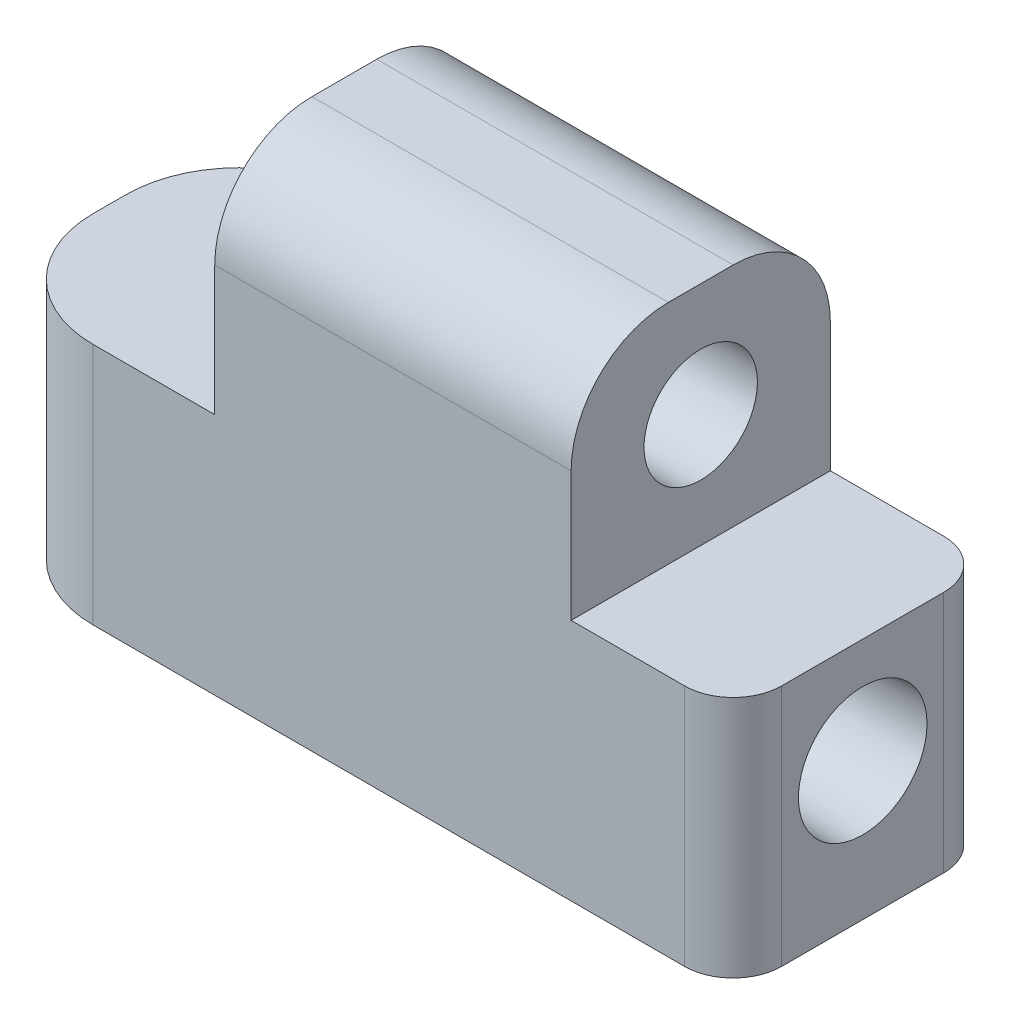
ISO-10303-21;
HEADER;
FILE_DESCRIPTION(('STEP AP214'),'2;1');
FILE_NAME('part.step','',(''),(''),'','','');
FILE_SCHEMA(('AUTOMOTIVE_DESIGN { 1 0 10303 214 1 1 1 1 }'));
ENDSEC;
DATA;
#1=APPLICATION_CONTEXT('core data for automotive mechanical design processes');
#2=APPLICATION_PROTOCOL_DEFINITION('international standard','automotive_design',2000,#1);
#3=PRODUCT_CONTEXT('',#1,'mechanical');
#4=PRODUCT('Part','Part','',(#3));
#5=PRODUCT_RELATED_PRODUCT_CATEGORY('part','',(#4));
#6=PRODUCT_DEFINITION_FORMATION('','',#4);
#7=PRODUCT_DEFINITION_CONTEXT('part definition',#1,'design');
#8=PRODUCT_DEFINITION('design','',#6,#7);
#9=PRODUCT_DEFINITION_SHAPE('','',#8);
#10=(LENGTH_UNIT() NAMED_UNIT(*) SI_UNIT(.MILLI.,.METRE.));
#11=(NAMED_UNIT(*) PLANE_ANGLE_UNIT() SI_UNIT($,.RADIAN.));
#12=(NAMED_UNIT(*) SI_UNIT($,.STERADIAN.) SOLID_ANGLE_UNIT());
#13=UNCERTAINTY_MEASURE_WITH_UNIT(LENGTH_MEASURE(1.E-05),#10,'distance_accuracy_value','');
#14=(GEOMETRIC_REPRESENTATION_CONTEXT(3) GLOBAL_UNCERTAINTY_ASSIGNED_CONTEXT((#13)) GLOBAL_UNIT_ASSIGNED_CONTEXT((#10,
#11,#12)) REPRESENTATION_CONTEXT('',''));
#15=CARTESIAN_POINT('',(0.,0.,0.));
#16=DIRECTION('',(0.,0.,1.));
#17=DIRECTION('',(1.,0.,0.));
#18=AXIS2_PLACEMENT_3D('',#15,#16,#17);
#19=CARTESIAN_POINT('',(-33.,28.,50.));
#20=DIRECTION('',(0.,0.,1.));
#21=DIRECTION('',(1.,0.,0.));
#22=AXIS2_PLACEMENT_3D('',#19,#20,#21);
#23=PLANE('',#22);
#24=DIRECTION('',(-1.,0.,0.));
#25=VECTOR('',#24,1.);
#26=CARTESIAN_POINT('',(-0.499999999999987,13.9,50.));
#27=LINE('',#26,#25);
#28=CARTESIAN_POINT('',(-0.499999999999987,13.9,50.));
#29=VERTEX_POINT('',#28);
#30=CARTESIAN_POINT('',(-26.,13.9,50.));
#31=VERTEX_POINT('',#30);
#32=EDGE_CURVE('E627',#29,#31,#27,.T.);
#33=ORIENTED_EDGE('',*,*,#32,.T.);
#34=DIRECTION('',(0.,-1.,0.));
#35=VECTOR('',#34,1.);
#36=CARTESIAN_POINT('',(-26.,25.,50.));
#37=LINE('',#36,#35);
#38=CARTESIAN_POINT('',(-26.,21.,50.));
#39=VERTEX_POINT('',#38);
#40=EDGE_CURVE('E306',#31,#39,#37,.F.);
#41=ORIENTED_EDGE('',*,*,#40,.T.);
#42=DIRECTION('',(-1.,0.,0.));
#43=VECTOR('',#42,1.);
#44=CARTESIAN_POINT('',(-0.499999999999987,21.,50.));
#45=LINE('',#44,#43);
#46=CARTESIAN_POINT('',(-11.2912878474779,21.,50.));
#47=VERTEX_POINT('',#46);
#48=EDGE_CURVE('E398',#39,#47,#45,.F.);
#49=ORIENTED_EDGE('',*,*,#48,.T.);
#50=CARTESIAN_POINT('',(-6.60612209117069,25.,45.7206584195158));
#51=CARTESIAN_POINT('',(-6.67578856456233,25.2913680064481,50.));
#52=CARTESIAN_POINT('',(-5.67820742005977,21.1191569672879,50.));
#53=CARTESIAN_POINT('',(-6.6095257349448,25.,45.7319581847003));
#54=CARTESIAN_POINT('',(-6.67216268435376,25.2797359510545,50.));
#55=CARTESIAN_POINT('',(-5.73499668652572,21.105578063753,50.));
#56=CARTESIAN_POINT('',(-6.61317918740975,25.,45.7438128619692));
#57=CARTESIAN_POINT('',(-6.66917351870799,25.2673575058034,50.));
#58=CARTESIAN_POINT('',(-5.79206011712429,21.0931780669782,50.));
#59=CARTESIAN_POINT('',(-6.62110966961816,25.,45.7687998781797));
#60=CARTESIAN_POINT('',(-6.66474517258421,25.241059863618,50.));
#61=CARTESIAN_POINT('',(-5.90664277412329,21.0707240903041,50.));
#62=CARTESIAN_POINT('',(-6.62538665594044,25.,45.7819321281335));
#63=CARTESIAN_POINT('',(-6.6633014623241,25.2271501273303,50.));
#64=CARTESIAN_POINT('',(-5.96416196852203,21.0606699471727,50.));
#65=CARTESIAN_POINT('',(-6.63934236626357,25.,45.8235077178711));
#66=CARTESIAN_POINT('',(-6.6616737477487,25.1830901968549,50.));
#67=CARTESIAN_POINT('',(-6.13731091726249,21.0340006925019,50.));
#68=CARTESIAN_POINT('',(-6.65014395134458,25.,45.8541233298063));
#69=CARTESIAN_POINT('',(-6.66415073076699,25.1505226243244,50.));
#70=CARTESIAN_POINT('',(-6.2534979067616,21.0208868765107,50.));
#71=CARTESIAN_POINT('',(-6.67598968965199,25.,45.9221012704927));
#72=CARTESIAN_POINT('',(-6.67886302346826,25.0792888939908,50.));
#73=CARTESIAN_POINT('',(-6.48380578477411,21.0039510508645,50.));
#74=CARTESIAN_POINT('',(-6.69092946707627,25.,45.9592903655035));
#75=CARTESIAN_POINT('',(-6.69077418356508,25.0409078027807,50.));
#76=CARTESIAN_POINT('',(-6.59791197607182,20.9999202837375,50.));
#77=CARTESIAN_POINT('',(-6.72753227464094,25.,46.043084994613));
#78=CARTESIAN_POINT('',(-6.72749689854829,24.9571560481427,50.));
#79=CARTESIAN_POINT('',(-6.82598470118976,21.0000819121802,50.));
#80=CARTESIAN_POINT('',(-6.74918773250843,25.,46.0896799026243));
#81=CARTESIAN_POINT('',(-6.752120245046,24.9119576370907,50.));
#82=CARTESIAN_POINT('',(-6.93995124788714,21.0042650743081,50.));
#83=CARTESIAN_POINT('',(-6.79552970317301,25.,46.1798526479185));
#84=CARTESIAN_POINT('',(-6.80948489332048,24.8284490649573,50.));
#85=CARTESIAN_POINT('',(-7.13411103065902,21.0177638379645,50.));
#86=CARTESIAN_POINT('',(-6.81748174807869,25.,46.2203340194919));
#87=CARTESIAN_POINT('',(-6.83754250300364,24.7921905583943,50.));
#88=CARTESIAN_POINT('',(-7.21444261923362,21.0252226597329,50.));
#89=CARTESIAN_POINT('',(-6.86933229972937,25.,46.308781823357));
#90=CARTESIAN_POINT('',(-6.90490152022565,24.7161730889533,50.));
#91=CARTESIAN_POINT('',(-7.37473223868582,21.0434608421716,50.));
#92=CARTESIAN_POINT('',(-6.89923151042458,25.,46.3567489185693));
#93=CARTESIAN_POINT('',(-6.94403545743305,24.6765096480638,50.));
#94=CARTESIAN_POINT('',(-7.4546902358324,21.0542404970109,50.));
#95=CARTESIAN_POINT('',(-6.97075518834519,25.,46.4615822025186));
#96=CARTESIAN_POINT('',(-7.03668412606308,24.5939173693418,50.));
#97=CARTESIAN_POINT('',(-7.61448787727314,21.0785951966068,50.));
#98=CARTESIAN_POINT('',(-7.01242467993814,25.,46.5184821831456));
#99=CARTESIAN_POINT('',(-7.0900067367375,24.5510838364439,50.));
#100=CARTESIAN_POINT('',(-7.6943258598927,21.0921809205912,50.));
#101=CARTESIAN_POINT('',(-7.11298090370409,25.,46.6418212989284));
#102=CARTESIAN_POINT('',(-7.21474911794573,24.4632154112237,50.));
#103=CARTESIAN_POINT('',(-7.85363468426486,21.1212901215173,50.));
#104=CARTESIAN_POINT('',(-7.17186665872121,25.,46.7082598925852));
#105=CARTESIAN_POINT('',(-7.28581605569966,24.4182884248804,50.));
#106=CARTESIAN_POINT('',(-7.9331055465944,21.1368134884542,50.));
#107=CARTESIAN_POINT('',(-7.2786706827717,25.,46.8136762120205));
#108=CARTESIAN_POINT('',(-7.40919437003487,24.3508570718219,50.));
#109=CARTESIAN_POINT('',(-8.05167023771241,21.1605108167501,50.));
#110=CARTESIAN_POINT('',(-7.31702609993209,25.,46.8495093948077));
#111=CARTESIAN_POINT('',(-7.45245357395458,24.3286629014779,50.));
#112=CARTESIAN_POINT('',(-8.09081816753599,21.1684229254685,50.));
#113=CARTESIAN_POINT('',(-7.40108151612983,25.,46.9226494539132));
#114=CARTESIAN_POINT('',(-7.54491573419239,24.2846692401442,50.));
#115=CARTESIAN_POINT('',(-8.16912129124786,21.1842110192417,50.));
#116=CARTESIAN_POINT('',(-7.44678145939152,25.,46.9599563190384));
#117=CARTESIAN_POINT('',(-7.59406452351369,24.2628715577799,50.));
#118=CARTESIAN_POINT('',(-8.20827648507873,21.1920870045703,50.));
#119=CARTESIAN_POINT('',(-7.5467463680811,25.,47.0351813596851));
#120=CARTESIAN_POINT('',(-7.69876630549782,24.220178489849,50.));
#121=CARTESIAN_POINT('',(-8.28665790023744,21.2075706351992,50.));
#122=CARTESIAN_POINT('',(-7.60101500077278,25.,47.0730997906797));
#123=CARTESIAN_POINT('',(-7.75427276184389,24.199277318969,50.));
#124=CARTESIAN_POINT('',(-8.32588414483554,21.2151781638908,50.));
#125=CARTESIAN_POINT('',(-7.71919535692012,25.,47.1481236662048));
#126=CARTESIAN_POINT('',(-7.87194470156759,24.159060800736,50.));
#127=CARTESIAN_POINT('',(-8.40444147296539,21.2298406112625,50.));
#128=CARTESIAN_POINT('',(-7.78310713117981,25.,47.185229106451));
#129=CARTESIAN_POINT('',(-7.93407578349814,24.1397290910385,50.));
#130=CARTESIAN_POINT('',(-8.4437725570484,21.236895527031,50.));
#131=CARTESIAN_POINT('',(-7.92069480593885,25.,47.2563331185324));
#132=CARTESIAN_POINT('',(-8.06443294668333,24.1036150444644,50.));
#133=CARTESIAN_POINT('',(-8.52226781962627,21.2500805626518,50.));
#134=CARTESIAN_POINT('',(-7.99428835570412,25.,47.2903542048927));
#135=CARTESIAN_POINT('',(-8.13259758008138,24.0867876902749,50.));
#136=CARTESIAN_POINT('',(-8.56143080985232,21.2562176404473,50.));
#137=CARTESIAN_POINT('',(-8.15147842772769,25.,47.3531163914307));
#138=CARTESIAN_POINT('',(-8.27492220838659,24.0564018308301,50.));
#139=CARTESIAN_POINT('',(-8.639928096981,21.2672999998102,50.));
#140=CARTESIAN_POINT('',(-8.23507484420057,25.,47.3818575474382));
#141=CARTESIAN_POINT('',(-8.34912094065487,24.0428083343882,50.));
#142=CARTESIAN_POINT('',(-8.67926239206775,21.2722452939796,50.));
#143=CARTESIAN_POINT('',(-8.410790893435,25.,47.4312828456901));
#144=CARTESIAN_POINT('',(-8.50229842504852,24.019801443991,50.));
#145=CARTESIAN_POINT('',(-8.7580553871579,21.2806180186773,50.));
#146=CARTESIAN_POINT('',(-8.50290178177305,25.,47.4519751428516));
#147=CARTESIAN_POINT('',(-8.58136530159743,24.0103475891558,50.));
#148=CARTESIAN_POINT('',(-8.7975139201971,21.2840469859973,50.));
#149=CARTESIAN_POINT('',(-8.69285635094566,25.,47.482920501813));
#150=CARTESIAN_POINT('',(-8.74253944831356,23.9963350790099,50.));
#151=CARTESIAN_POINT('',(-8.87654529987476,21.2891356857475,50.));
#152=CARTESIAN_POINT('',(-8.79069954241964,25.,47.493174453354));
#153=CARTESIAN_POINT('',(-8.82479218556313,23.9917487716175,50.));
#154=CARTESIAN_POINT('',(-8.91611813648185,21.2907955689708,50.));
#155=CARTESIAN_POINT('',(-8.96564243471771,25.,47.5009340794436));
#156=CARTESIAN_POINT('',(-8.97128140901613,23.9882832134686,50.));
#157=CARTESIAN_POINT('',(-8.98630498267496,21.2920520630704,50.));
#158=CARTESIAN_POINT('',(-9.04240662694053,25.,47.500806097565));
#159=CARTESIAN_POINT('',(-9.03545003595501,23.988339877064,50.));
#160=CARTESIAN_POINT('',(-9.01691253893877,21.2920316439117,50.));
#161=CARTESIAN_POINT('',(-9.19487105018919,25.,47.4935606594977));
#162=CARTESIAN_POINT('',(-9.16312466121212,23.9915767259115,50.));
#163=CARTESIAN_POINT('',(-9.0781055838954,21.2908577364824,50.));
#164=CARTESIAN_POINT('',(-9.27057129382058,25.,47.4864432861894));
#165=CARTESIAN_POINT('',(-9.22671148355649,23.9947609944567,50.));
#166=CARTESIAN_POINT('',(-9.10869107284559,21.2897042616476,50.));
#167=CARTESIAN_POINT('',(-9.41904365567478,25.,47.465771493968));
#168=CARTESIAN_POINT('',(-9.35220623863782,24.0040843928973,50.));
#169=CARTESIAN_POINT('',(-9.16981661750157,21.2863198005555,50.));
#170=CARTESIAN_POINT('',(-9.49181429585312,25.,47.4522138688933));
#171=CARTESIAN_POINT('',(-9.41418426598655,24.0102360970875,50.));
#172=CARTESIAN_POINT('',(-9.20035664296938,21.2840882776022,50.));
#173=CARTESIAN_POINT('',(-9.63287014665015,25.,47.4196528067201));
#174=CARTESIAN_POINT('',(-9.53555225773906,24.0251908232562,50.));
#175=CARTESIAN_POINT('',(-9.26134911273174,21.2786514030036,50.));
#176=CARTESIAN_POINT('',(-9.70115528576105,25.,47.4006492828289));
#177=CARTESIAN_POINT('',(-9.59499620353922,24.0340094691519,50.));
#178=CARTESIAN_POINT('',(-9.29180155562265,21.2754460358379,50.));
#179=CARTESIAN_POINT('',(-9.83262363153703,25.,47.3582920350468));
#180=CARTESIAN_POINT('',(-9.7109937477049,24.0539726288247,50.));
#181=CARTESIAN_POINT('',(-9.35278672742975,21.2681752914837,50.));
#182=CARTESIAN_POINT('',(-9.89577393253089,25.,47.3349130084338));
#183=CARTESIAN_POINT('',(-9.76756129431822,24.0651477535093,50.));
#184=CARTESIAN_POINT('',(-9.38331884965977,21.2641048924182,50.));
#185=CARTESIAN_POINT('',(-10.0160126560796,25.,47.2851597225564));
#186=CARTESIAN_POINT('',(-9.87700258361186,24.0893676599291,50.));
#187=CARTESIAN_POINT('',(-9.44428136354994,21.2552695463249,50.));
#188=CARTESIAN_POINT('',(-10.0731010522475,25.,47.2587854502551));
#189=CARTESIAN_POINT('',(-9.92989176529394,24.1024285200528,50.));
#190=CARTESIAN_POINT('',(-9.47471175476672,21.2505045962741,50.));
#191=CARTESIAN_POINT('',(-10.1811438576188,25.,47.204215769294));
#192=CARTESIAN_POINT('',(-10.0317675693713,24.1300033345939,50.));
#193=CARTESIAN_POINT('',(-9.53548062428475,21.2404369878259,50.));
#194=CARTESIAN_POINT('',(-10.2320986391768,25.,47.1760204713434));
#195=CARTESIAN_POINT('',(-10.0807539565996,24.1445302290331,50.));
#196=CARTESIAN_POINT('',(-9.56581910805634,21.2351343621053,50.));
#197=CARTESIAN_POINT('',(-10.3281244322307,25.,47.1187737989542));
#198=CARTESIAN_POINT('',(-10.1747969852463,24.174663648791,50.));
#199=CARTESIAN_POINT('',(-9.6264256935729,21.2241392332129,50.));
#200=CARTESIAN_POINT('',(-10.3731952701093,25.,47.0897223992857));
#201=CARTESIAN_POINT('',(-10.2198415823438,24.1902794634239,50.));
#202=CARTESIAN_POINT('',(-9.65669379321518,21.2184467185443,50.));
#203=CARTESIAN_POINT('',(-10.501280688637,25.,47.0017600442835));
#204=CARTESIAN_POINT('',(-10.3506517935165,24.2387732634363,50.));
#205=CARTESIAN_POINT('',(-9.74818682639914,21.2008480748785,50.));
#206=CARTESIAN_POINT('',(-10.5758249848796,25.,46.9427706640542));
#207=CARTESIAN_POINT('',(-10.4299183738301,24.2726792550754,50.));
#208=CARTESIAN_POINT('',(-9.80933634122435,21.1885546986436,50.));
#209=CARTESIAN_POINT('',(-10.7070248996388,25.,46.8285549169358));
#210=CARTESIAN_POINT('',(-10.5742631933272,24.3413910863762,50.));
#211=CARTESIAN_POINT('',(-9.9316164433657,21.1638993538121,50.));
#212=CARTESIAN_POINT('',(-10.7636816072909,25.,46.7733283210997));
#213=CARTESIAN_POINT('',(-10.6391336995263,24.3761880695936,50.));
#214=CARTESIAN_POINT('',(-9.99274703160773,21.1515373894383,50.));
#215=CARTESIAN_POINT('',(-10.8633240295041,25.,46.6683035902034));
#216=CARTESIAN_POINT('',(-10.7565476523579,24.4452892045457,50.));
#217=CARTESIAN_POINT('',(-10.1149772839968,21.1274858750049,50.));
#218=CARTESIAN_POINT('',(-10.9063450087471,25.,46.6184916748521));
#219=CARTESIAN_POINT('',(-10.808933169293,24.479558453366,50.));
#220=CARTESIAN_POINT('',(-10.1760766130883,21.1157946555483,50.));
#221=CARTESIAN_POINT('',(-10.9823525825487,25.,46.5244418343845));
#222=CARTESIAN_POINT('',(-10.9034738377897,24.5469020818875,50.));
#223=CARTESIAN_POINT('',(-10.2984889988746,21.093574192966,50.));
#224=CARTESIAN_POINT('',(-11.0153391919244,25.,46.4802039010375));
#225=CARTESIAN_POINT('',(-10.9454720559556,24.5799279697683,50.));
#226=CARTESIAN_POINT('',(-10.3598020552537,21.0830449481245,50.));
#227=CARTESIAN_POINT('',(-11.0735600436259,25.,46.3974520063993));
#228=CARTESIAN_POINT('',(-11.0204897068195,24.6439824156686,50.));
#229=CARTESIAN_POINT('',(-10.4820244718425,21.0636417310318,50.));
#230=CARTESIAN_POINT('',(-11.0988729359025,25.,46.3588822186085));
#231=CARTESIAN_POINT('',(-11.0534852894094,24.6749829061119,50.));
#232=CARTESIAN_POINT('',(-10.5429311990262,21.0547513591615,50.));
#233=CARTESIAN_POINT('',(-11.1440563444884,25.,46.2864062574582));
#234=CARTESIAN_POINT('',(-11.1124370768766,24.7351261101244,50.));
#235=CARTESIAN_POINT('',(-10.6649830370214,21.0387736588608,50.));
#236=CARTESIAN_POINT('',(-11.1639268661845,25.,46.2525000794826));
#237=CARTESIAN_POINT('',(-11.1383048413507,24.7642235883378,50.));
#238=CARTESIAN_POINT('',(-10.726128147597,21.0316863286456,50.));
#239=CARTESIAN_POINT('',(-11.1995852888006,25.,46.1887622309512));
#240=CARTESIAN_POINT('',(-11.1841509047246,24.8204703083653,50.));
#241=CARTESIAN_POINT('',(-10.8486717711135,21.0195263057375,50.));
#242=CARTESIAN_POINT('',(-11.2153697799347,25.,46.1589339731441));
#243=CARTESIAN_POINT('',(-11.2040586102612,24.8475775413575,50.));
#244=CARTESIAN_POINT('',(-10.9100704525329,21.0144552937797,50.));
#245=CARTESIAN_POINT('',(-11.2438178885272,25.,46.1028452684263));
#246=CARTESIAN_POINT('',(-11.2388941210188,24.8997791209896,50.));
#247=CARTESIAN_POINT('',(-11.033009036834,21.0065031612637,50.));
#248=CARTESIAN_POINT('',(-11.2564816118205,25.,46.0765847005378));
#249=CARTESIAN_POINT('',(-11.2537741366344,24.9248389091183,50.));
#250=CARTESIAN_POINT('',(-11.0945489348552,21.0036219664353,50.));
#251=CARTESIAN_POINT('',(-11.2794420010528,25.,46.0270780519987));
#252=CARTESIAN_POINT('',(-11.2793683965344,24.9730201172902,50.));
#253=CARTESIAN_POINT('',(-11.2178567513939,21.0001730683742,50.));
#254=CARTESIAN_POINT('',(-11.2897323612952,25.,46.0038400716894));
#255=CARTESIAN_POINT('',(-11.2900363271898,24.9961063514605,50.));
#256=CARTESIAN_POINT('',(-11.2796248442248,20.9996114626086,50.));
#257=CARTESIAN_POINT('',(-11.3084412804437,25.,45.9600334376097));
#258=CARTESIAN_POINT('',(-11.3078024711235,25.0403031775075,50.));
#259=CARTESIAN_POINT('',(-11.4031346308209,21.000917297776,50.));
#260=CARTESIAN_POINT('',(-11.3168598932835,25.,45.9394647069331));
#261=CARTESIAN_POINT('',(-11.3148754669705,25.0613890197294,50.));
#262=CARTESIAN_POINT('',(-11.4648763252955,21.0027846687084,50.));
#263=CARTESIAN_POINT('',(-11.3322364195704,25.,45.9006177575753));
#264=CARTESIAN_POINT('',(-11.3260069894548,25.1016492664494,50.));
#265=CARTESIAN_POINT('',(-11.5882627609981,21.0090255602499,50.));
#266=CARTESIAN_POINT('',(-11.3391936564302,25.,45.8823406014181));
#267=CARTESIAN_POINT('',(-11.3300459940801,25.1208020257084,50.));
#268=CARTESIAN_POINT('',(-11.6499074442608,21.0134002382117,50.));
#269=CARTESIAN_POINT('',(-11.3519329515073,25.,45.8477840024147));
#270=CARTESIAN_POINT('',(-11.3355459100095,25.157246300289,50.));
#271=CARTESIAN_POINT('',(-11.7729697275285,21.0247087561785,50.));
#272=CARTESIAN_POINT('',(-11.3577148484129,25.,45.8315048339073));
#273=CARTESIAN_POINT('',(-11.3369935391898,25.1745202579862,50.));
#274=CARTESIAN_POINT('',(-11.8343872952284,21.0316429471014,50.));
#275=CARTESIAN_POINT('',(-11.3630533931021,25.,45.8160751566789));
#276=CARTESIAN_POINT('',(-11.3373844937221,25.1908673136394,50.));
#277=CARTESIAN_POINT('',(-11.8956320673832,21.0398823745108,50.));
#278=(BOUNDED_SURFACE() B_SPLINE_SURFACE(3,2,((#50,#51,#52),(#53,#54,#55),(#56,#57,#58),(#59,
#60,#61),(#62,#63,#64),(#65,#66,#67),(#68,#69,#70),(#71,#72,#73),(#74,#75,#76),(#77,#78,#79),
(#80,#81,#82),(#83,#84,#85),(#86,#87,#88),(#89,#90,#91),(#92,#93,#94),(#95,#96,#97),(#98,#99,
#100),(#101,#102,#103),(#104,#105,#106),(#107,#108,#109),(#110,#111,#112),(#113,#114,#115),
(#116,#117,#118),(#119,#120,#121),(#122,#123,#124),(#125,#126,#127),(#128,#129,#130),(#131,#132,
#133),(#134,#135,#136),(#137,#138,#139),(#140,#141,#142),(#143,#144,#145),(#146,#147,#148),
(#149,#150,#151),(#152,#153,#154),(#155,#156,#157),(#158,#159,#160),(#161,#162,#163),(#164,#165,
#166),(#167,#168,#169),(#170,#171,#172),(#173,#174,#175),(#176,#177,#178),(#179,#180,#181),
(#182,#183,#184),(#185,#186,#187),(#188,#189,#190),(#191,#192,#193),(#194,#195,#196),(#197,#198,
#199),(#200,#201,#202),(#203,#204,#205),(#206,#207,#208),(#209,#210,#211),(#212,#213,#214),
(#215,#216,#217),(#218,#219,#220),(#221,#222,#223),(#224,#225,#226),(#227,#228,#229),(#230,#231,
#232),(#233,#234,#235),(#236,#237,#238),(#239,#240,#241),(#242,#243,#244),(#245,#246,#247),
(#248,#249,#250),(#251,#252,#253),(#254,#255,#256),(#257,#258,#259),(#260,#261,#262),(#263,#264,
#265),(#266,#267,#268),(#269,#270,#271),(#272,#273,#274),(#275,#276,#277)),.UNSPECIFIED.,.F.,
.F.,.F.) B_SPLINE_SURFACE_WITH_KNOTS((4,2,2,2,2,2,2,2,2,2,2,2,2,2,2,2,2,2,2,2,2,2,2,2,2,2,2,2,2,
2,2,2,2,2,2,2,2,4),(3,3),(0.,0.175143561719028,0.350274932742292,0.700642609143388,
1.04287183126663,1.38471656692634,1.62667792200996,1.86866071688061,2.11158199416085,
2.3544894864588,2.4743084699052,2.59412654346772,2.71399603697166,2.83386616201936,
2.95277568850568,3.07168395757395,3.19047143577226,3.30924878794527,3.4010510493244,
3.49285222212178,3.58469914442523,3.67654753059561,3.76894445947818,3.86134179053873,
3.95373350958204,4.04612795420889,4.23324379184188,4.42034823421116,4.60696476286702,
4.79358101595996,4.97821434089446,5.16284748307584,5.34763420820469,5.53241466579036,
5.71768054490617,5.90294108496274,6.08828720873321,6.27365875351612),(0.,1.),
.UNSPECIFIED.) GEOMETRIC_REPRESENTATION_ITEM() RATIONAL_B_SPLINE_SURFACE(((1.,0.681969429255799,
1.),(1.,0.683004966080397,1.),(1.,0.684089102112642,1.),(1.,0.686368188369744,1.),(1.,
0.687563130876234,1.),(1.,0.691335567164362,1.),(1.,0.69410006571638,1.),(1.,0.700194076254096,
1.),(1.,0.703508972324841,1.),(1.,0.710914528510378,1.),(1.,0.715004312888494,1.),(1.,
0.722836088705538,1.),(1.,0.72633053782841,1.),(1.,0.733901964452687,1.),(1.,0.73797899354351,
1.),(1.,0.746804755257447,1.),(1.,0.751556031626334,1.),(1.,0.761743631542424,1.),(1.,
0.767179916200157,1.),(1.,0.775704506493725,1.),(1.,0.778586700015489,1.),(1.,0.784435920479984,
1.),(1.,0.787402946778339,1.),(1.,0.793351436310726,1.),(1.,0.796332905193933,1.),(1.,
0.802199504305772,1.),(1.,0.805084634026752,1.),(1.,0.810585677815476,1.),(1.,0.813203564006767,
1.),(1.,0.818013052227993,1.),(1.,0.82020465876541,1.),(1.,0.82396233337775,1.),(1.,
0.825529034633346,1.),(1.,0.827868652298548,1.),(1.,0.82864163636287,1.),(1.,0.829226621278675,
1.),(1.,0.829216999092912,1.),(1.,0.828670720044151,1.),(1.,0.828134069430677,1.),(1.,
0.8265724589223,1.),(1.,0.825547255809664,1.),(1.,0.823078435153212,1.),(1.,0.821634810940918,
1.),(1.,0.818406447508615,1.),(1.,0.816619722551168,1.),(1.,0.812802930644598,1.),(1.,
0.810772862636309,1.),(1.,0.806555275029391,1.),(1.,0.804367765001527,1.),(1.,0.799907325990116,
1.),(1.,0.797634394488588,1.),(1.,0.79072195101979,1.),(1.,0.786045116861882,1.),(1.,
0.776910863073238,1.),(1.,0.772453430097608,1.),(1.,0.763908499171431,1.),(1.,0.759820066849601,
1.),(1.,0.752044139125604,1.),(1.,0.748356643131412,1.),(1.,0.741413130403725,1.),(1.,
0.738152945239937,1.),(1.,0.731990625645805,1.),(1.,0.729088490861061,1.),(1.,0.723604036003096,
1.),(1.,0.721021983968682,1.),(1.,0.716143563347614,1.),(1.,0.713847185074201,1.),(1.,
0.709499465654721,1.),(1.,0.707448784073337,1.),(1.,0.70356800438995,1.),(1.,0.701737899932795,
1.),(1.,0.69826946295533,1.),(1.,0.69663121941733,1.),(1.,0.693523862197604,1.),(1.,
0.692054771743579,1.),(1.,0.690658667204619,1.))) REPRESENTATION_ITEM('') SURFACE());
#279=CARTESIAN_POINT('',(-11.8956320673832,21.0398823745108,50.));
#280=CARTESIAN_POINT('',(-11.8343872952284,21.0316429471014,50.));
#281=CARTESIAN_POINT('',(-11.7729697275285,21.0247087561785,50.));
#282=CARTESIAN_POINT('',(-11.6499074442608,21.0134002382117,50.));
#283=CARTESIAN_POINT('',(-11.5882627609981,21.0090255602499,50.));
#284=CARTESIAN_POINT('',(-11.4648763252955,21.0027846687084,50.));
#285=CARTESIAN_POINT('',(-11.4031346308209,21.000917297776,50.));
#286=CARTESIAN_POINT('',(-11.2796248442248,20.9996114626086,50.));
#287=CARTESIAN_POINT('',(-11.2178567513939,21.0001730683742,50.));
#288=CARTESIAN_POINT('',(-11.0945489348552,21.0036219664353,50.));
#289=CARTESIAN_POINT('',(-11.033009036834,21.0065031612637,50.));
#290=CARTESIAN_POINT('',(-10.9100704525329,21.0144552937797,50.));
#291=CARTESIAN_POINT('',(-10.8486717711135,21.0195263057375,50.));
#292=CARTESIAN_POINT('',(-10.726128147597,21.0316863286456,50.));
#293=CARTESIAN_POINT('',(-10.6649830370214,21.0387736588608,50.));
#294=CARTESIAN_POINT('',(-10.5429311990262,21.0547513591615,50.));
#295=CARTESIAN_POINT('',(-10.4820244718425,21.0636417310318,50.));
#296=CARTESIAN_POINT('',(-10.3598020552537,21.0830449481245,50.));
#297=CARTESIAN_POINT('',(-10.2984889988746,21.093574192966,50.));
#298=CARTESIAN_POINT('',(-10.1760766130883,21.1157946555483,50.));
#299=CARTESIAN_POINT('',(-10.1149772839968,21.1274858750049,50.));
#300=CARTESIAN_POINT('',(-9.99274703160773,21.1515373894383,50.));
#301=CARTESIAN_POINT('',(-9.9316164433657,21.1638993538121,50.));
#302=CARTESIAN_POINT('',(-9.80933634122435,21.1885546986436,50.));
#303=CARTESIAN_POINT('',(-9.74818682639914,21.2008480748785,50.));
#304=CARTESIAN_POINT('',(-9.65669379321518,21.2184467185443,50.));
#305=CARTESIAN_POINT('',(-9.6264256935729,21.2241392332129,50.));
#306=CARTESIAN_POINT('',(-9.56581910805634,21.2351343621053,50.));
#307=CARTESIAN_POINT('',(-9.53548062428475,21.2404369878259,50.));
#308=CARTESIAN_POINT('',(-9.47471175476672,21.2505045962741,50.));
#309=CARTESIAN_POINT('',(-9.44428136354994,21.2552695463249,50.));
#310=CARTESIAN_POINT('',(-9.38331884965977,21.2641048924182,50.));
#311=CARTESIAN_POINT('',(-9.35278672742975,21.2681752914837,50.));
#312=CARTESIAN_POINT('',(-9.29180155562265,21.2754460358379,50.));
#313=CARTESIAN_POINT('',(-9.26134911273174,21.2786514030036,50.));
#314=CARTESIAN_POINT('',(-9.20035664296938,21.2840882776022,50.));
#315=CARTESIAN_POINT('',(-9.16981661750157,21.2863198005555,50.));
#316=CARTESIAN_POINT('',(-9.10869107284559,21.2897042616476,50.));
#317=CARTESIAN_POINT('',(-9.0781055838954,21.2908577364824,50.));
#318=CARTESIAN_POINT('',(-9.01691253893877,21.2920316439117,50.));
#319=CARTESIAN_POINT('',(-8.98630498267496,21.2920520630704,50.));
#320=CARTESIAN_POINT('',(-8.91611813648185,21.2907955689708,50.));
#321=CARTESIAN_POINT('',(-8.87654529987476,21.2891356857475,50.));
#322=CARTESIAN_POINT('',(-8.7975139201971,21.2840469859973,50.));
#323=CARTESIAN_POINT('',(-8.7580553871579,21.2806180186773,50.));
#324=CARTESIAN_POINT('',(-8.67926239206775,21.2722452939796,50.));
#325=CARTESIAN_POINT('',(-8.639928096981,21.2672999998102,50.));
#326=CARTESIAN_POINT('',(-8.56143080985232,21.2562176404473,50.));
#327=CARTESIAN_POINT('',(-8.52226781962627,21.2500805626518,50.));
#328=CARTESIAN_POINT('',(-8.4437725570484,21.236895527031,50.));
#329=CARTESIAN_POINT('',(-8.40444147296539,21.2298406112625,50.));
#330=CARTESIAN_POINT('',(-8.32588414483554,21.2151781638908,50.));
#331=CARTESIAN_POINT('',(-8.28665790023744,21.2075706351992,50.));
#332=CARTESIAN_POINT('',(-8.20827648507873,21.1920870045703,50.));
#333=CARTESIAN_POINT('',(-8.16912129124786,21.1842110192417,50.));
#334=CARTESIAN_POINT('',(-8.09081816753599,21.1684229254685,50.));
#335=CARTESIAN_POINT('',(-8.05167023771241,21.1605108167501,50.));
#336=CARTESIAN_POINT('',(-7.9331055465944,21.1368134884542,50.));
#337=CARTESIAN_POINT('',(-7.85363468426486,21.1212901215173,50.));
#338=CARTESIAN_POINT('',(-7.6943258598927,21.0921809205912,50.));
#339=CARTESIAN_POINT('',(-7.61448787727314,21.0785951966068,50.));
#340=CARTESIAN_POINT('',(-7.4546902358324,21.0542404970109,50.));
#341=CARTESIAN_POINT('',(-7.37473223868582,21.0434608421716,50.));
#342=CARTESIAN_POINT('',(-7.21444261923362,21.0252226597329,50.));
#343=CARTESIAN_POINT('',(-7.13411103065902,21.0177638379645,50.));
#344=CARTESIAN_POINT('',(-6.93995124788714,21.0042650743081,50.));
#345=CARTESIAN_POINT('',(-6.82598470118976,21.0000819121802,50.));
#346=CARTESIAN_POINT('',(-6.59791197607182,20.9999202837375,50.));
#347=CARTESIAN_POINT('',(-6.48380578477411,21.0039510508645,50.));
#348=CARTESIAN_POINT('',(-6.2534979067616,21.0208868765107,50.));
#349=CARTESIAN_POINT('',(-6.13731091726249,21.0340006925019,50.));
#350=CARTESIAN_POINT('',(-5.96416196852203,21.0606699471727,50.));
#351=CARTESIAN_POINT('',(-5.90664277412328,21.0707240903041,50.));
#352=CARTESIAN_POINT('',(-5.79206011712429,21.0931780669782,50.));
#353=CARTESIAN_POINT('',(-5.73499668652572,21.105578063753,50.));
#354=CARTESIAN_POINT('',(-5.67820742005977,21.1191569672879,50.));
#355=B_SPLINE_CURVE_WITH_KNOTS('',3,(#279,#280,#281,#282,#283,#284,#285,#286,#287,#288,#289,
#290,#291,#292,#293,#294,#295,#296,#297,#298,#299,#300,#301,#302,#303,#304,#305,#306,#307,#308,
#309,#310,#311,#312,#313,#314,#315,#316,#317,#318,#319,#320,#321,#322,#323,#324,#325,#326,#327,
#328,#329,#330,#331,#332,#333,#334,#335,#336,#337,#338,#339,#340,#341,#342,#343,#344,#345,#346,
#347,#348,#349,#350,#351,#352,#353,#354),.UNSPECIFIED.,.F.,.F.,(4,2,2,2,2,2,2,2,2,2,2,2,2,2,2,2,
2,2,2,2,2,2,2,2,2,2,2,2,2,2,2,2,2,2,2,2,2,4),(0.,0.185371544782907,0.370717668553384,
0.555978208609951,0.74124408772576,0.926024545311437,1.11081127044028,1.29544441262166,
1.48007773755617,1.6666939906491,1.85331051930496,2.04041496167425,2.22753079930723,
2.31992524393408,2.41231696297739,2.50471429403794,2.59711122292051,2.68895960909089,
2.78080653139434,2.87260770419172,2.96440996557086,3.08318731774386,3.20197479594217,
3.32088306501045,3.43979259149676,3.55966271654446,3.6795322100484,3.79935028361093,
3.91916926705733,4.16207675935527,4.40499803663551,4.64698083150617,4.88894218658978,
5.23078692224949,5.57301614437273,5.92338382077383,6.09851519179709,6.27365875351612),.UNSPECIFIED.);
#356=CARTESIAN_POINT('',(-6.70871215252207,21.,50.));
#357=VERTEX_POINT('',#356);
#358=EDGE_CURVE('E391',#47,#357,#355,.T.);
#359=ORIENTED_EDGE('',*,*,#358,.T.);
#360=DIRECTION('',(-1.,0.,0.));
#361=VECTOR('',#360,1.);
#362=CARTESIAN_POINT('',(-0.499999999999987,21.,50.));
#363=LINE('',#362,#361);
#364=CARTESIAN_POINT('',(-0.499999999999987,21.,50.));
#365=VERTEX_POINT('',#364);
#366=EDGE_CURVE('E389',#357,#365,#363,.F.);
#367=ORIENTED_EDGE('',*,*,#366,.T.);
#368=DIRECTION('',(0.,-1.,0.));
#369=VECTOR('',#368,1.);
#370=CARTESIAN_POINT('',(-0.499999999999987,13.,50.));
#371=LINE('',#370,#369);
#372=EDGE_CURVE('E579',#365,#29,#371,.T.);
#373=ORIENTED_EDGE('',*,*,#372,.T.);
#374=EDGE_LOOP('',(#33,#41,#49,#359,#367,#373));
#375=FACE_BOUND('',#374,.T.);
#376=ADVANCED_FACE('F42',(#375),#23,.F.);
#377=CARTESIAN_POINT('',(-30.,28.,37.));
#378=DIRECTION('',(-1.,0.,0.));
#379=DIRECTION('',(0.,0.,1.));
#380=AXIS2_PLACEMENT_3D('',#377,#378,#379);
#381=PLANE('',#380);
#382=DIRECTION('',(0.,0.,-1.));
#383=VECTOR('',#382,1.);
#384=CARTESIAN_POINT('',(-30.,13.9,46.));
#385=LINE('',#384,#383);
#386=CARTESIAN_POINT('',(-30.,13.9,46.));
#387=VERTEX_POINT('',#386);
#388=CARTESIAN_POINT('',(-30.,13.9,44.));
#389=VERTEX_POINT('',#388);
#390=EDGE_CURVE('E288',#387,#389,#385,.T.);
#391=ORIENTED_EDGE('',*,*,#390,.T.);
#392=DIRECTION('',(0.,-1.,0.));
#393=VECTOR('',#392,1.);
#394=CARTESIAN_POINT('',(-30.,25.,44.));
#395=LINE('',#394,#393);
#396=CARTESIAN_POINT('',(-30.,21.,44.));
#397=VERTEX_POINT('',#396);
#398=EDGE_CURVE('E316',#389,#397,#395,.F.);
#399=ORIENTED_EDGE('',*,*,#398,.T.);
#400=DIRECTION('',(0.,0.,-1.));
#401=VECTOR('',#400,1.);
#402=CARTESIAN_POINT('',(-30.,21.,50.));
#403=LINE('',#402,#401);
#404=CARTESIAN_POINT('',(-30.,21.,46.));
#405=VERTEX_POINT('',#404);
#406=EDGE_CURVE('E311',#397,#405,#403,.F.);
#407=ORIENTED_EDGE('',*,*,#406,.T.);
#408=DIRECTION('',(0.,-1.,0.));
#409=VECTOR('',#408,1.);
#410=CARTESIAN_POINT('',(-30.,13.,46.));
#411=LINE('',#410,#409);
#412=EDGE_CURVE('E304',#405,#387,#411,.T.);
#413=ORIENTED_EDGE('',*,*,#412,.T.);
#414=EDGE_LOOP('',(#391,#399,#407,#413));
#415=FACE_BOUND('',#414,.T.);
#416=ADVANCED_FACE('F309',(#415),#381,.F.);
#417=CARTESIAN_POINT('',(3.50000000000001,28.,37.));
#418=DIRECTION('',(1.,0.,0.));
#419=DIRECTION('',(0.,0.,-1.));
#420=AXIS2_PLACEMENT_3D('',#417,#418,#419);
#421=PLANE('',#420);
#422=DIRECTION('',(0.,0.,1.));
#423=VECTOR('',#422,1.);
#424=CARTESIAN_POINT('',(3.50000000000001,13.9,44.));
#425=LINE('',#424,#423);
#426=CARTESIAN_POINT('',(3.50000000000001,13.9,44.));
#427=VERTEX_POINT('',#426);
#428=CARTESIAN_POINT('',(3.50000000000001,13.9,46.));
#429=VERTEX_POINT('',#428);
#430=EDGE_CURVE('E619',#427,#429,#425,.T.);
#431=ORIENTED_EDGE('',*,*,#430,.T.);
#432=DIRECTION('',(0.,-1.,0.));
#433=VECTOR('',#432,1.);
#434=CARTESIAN_POINT('',(3.50000000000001,25.,46.));
#435=LINE('',#434,#433);
#436=CARTESIAN_POINT('',(3.50000000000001,18.5938362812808,46.));
#437=VERTEX_POINT('',#436);
#438=EDGE_CURVE('E612',#429,#437,#435,.F.);
#439=ORIENTED_EDGE('',*,*,#438,.T.);
#440=CARTESIAN_POINT('',(3.50000000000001,21.5,45.));
#441=DIRECTION('',(1.,0.,0.));
#442=DIRECTION('',(0.,0.,-1.));
#443=AXIS2_PLACEMENT_3D('',#440,#441,#442);
#444=CIRCLE('',#443,3.07340000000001);
#445=CARTESIAN_POINT('',(3.50000000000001,18.5938362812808,44.));
#446=VERTEX_POINT('',#445);
#447=EDGE_CURVE('E743',#437,#446,#444,.T.);
#448=ORIENTED_EDGE('',*,*,#447,.T.);
#449=DIRECTION('',(0.,-1.,0.));
#450=VECTOR('',#449,1.);
#451=CARTESIAN_POINT('',(3.50000000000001,13.,44.));
#452=LINE('',#451,#450);
#453=EDGE_CURVE('E608',#446,#427,#452,.T.);
#454=ORIENTED_EDGE('',*,*,#453,.T.);
#455=EDGE_LOOP('',(#431,#439,#448,#454));
#456=FACE_BOUND('',#455,.T.);
#457=ADVANCED_FACE('F886',(#456),#421,.F.);
#458=CARTESIAN_POINT('',(-33.,28.,40.));
#459=DIRECTION('',(0.,0.,-1.));
#460=DIRECTION('',(-1.,0.,0.));
#461=AXIS2_PLACEMENT_3D('',#458,#459,#460);
#462=PLANE('',#461);
#463=DIRECTION('',(1.,0.,0.));
#464=VECTOR('',#463,1.);
#465=CARTESIAN_POINT('',(-26.,13.9,40.));
#466=LINE('',#465,#464);
#467=CARTESIAN_POINT('',(-26.,13.9,40.));
#468=VERTEX_POINT('',#467);
#469=CARTESIAN_POINT('',(-0.499999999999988,13.9,40.));
#470=VERTEX_POINT('',#469);
#471=EDGE_CURVE('E65',#468,#470,#466,.T.);
#472=ORIENTED_EDGE('',*,*,#471,.T.);
#473=DIRECTION('',(0.,-1.,0.));
#474=VECTOR('',#473,1.);
#475=CARTESIAN_POINT('',(-0.499999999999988,25.,40.));
#476=LINE('',#475,#474);
#477=CARTESIAN_POINT('',(-0.499999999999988,21.,40.));
#478=VERTEX_POINT('',#477);
#479=EDGE_CURVE('E541',#470,#478,#476,.F.);
#480=ORIENTED_EDGE('',*,*,#479,.T.);
#481=DIRECTION('',(1.,0.,0.));
#482=VECTOR('',#481,1.);
#483=CARTESIAN_POINT('',(-26.,21.,40.));
#484=LINE('',#483,#482);
#485=CARTESIAN_POINT('',(-6.70871215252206,21.,40.));
#486=VERTEX_POINT('',#485);
#487=EDGE_CURVE('E550',#478,#486,#484,.F.);
#488=ORIENTED_EDGE('',*,*,#487,.T.);
#489=CARTESIAN_POINT('',(-11.3938778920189,25.,44.2793415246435));
#490=CARTESIAN_POINT('',(-11.3242114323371,25.2913679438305,40.));
#491=CARTESIAN_POINT('',(-12.3217925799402,21.1191569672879,40.));
#492=CARTESIAN_POINT('',(-11.3904742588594,25.,44.2680417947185));
#493=CARTESIAN_POINT('',(-11.3278373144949,25.2797359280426,40.));
#494=CARTESIAN_POINT('',(-12.2650033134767,21.1055780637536,40.));
#495=CARTESIAN_POINT('',(-11.3868208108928,25.,44.2561871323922));
#496=CARTESIAN_POINT('',(-11.3308264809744,25.2673574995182,40.));
#497=CARTESIAN_POINT('',(-12.2079398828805,21.0931780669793,40.));
#498=CARTESIAN_POINT('',(-11.3788903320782,25.,44.2312001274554));
#499=CARTESIAN_POINT('',(-11.3352548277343,25.2410598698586,40.));
#500=CARTESIAN_POINT('',(-12.0933572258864,21.0707240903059,40.));
#501=CARTESIAN_POINT('',(-11.3746133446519,25.,44.218067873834));
#502=CARTESIAN_POINT('',(-11.336698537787,25.2271501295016,40.));
#503=CARTESIAN_POINT('',(-12.0358380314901,21.0606699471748,40.));
#504=CARTESIAN_POINT('',(-11.3606576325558,25.,44.1764922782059));
#505=CARTESIAN_POINT('',(-11.3383262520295,25.1830901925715,40.));
#506=CARTESIAN_POINT('',(-11.8626890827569,21.0340006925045,40.));
#507=CARTESIAN_POINT('',(-11.3498560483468,25.,44.1458766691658));
#508=CARTESIAN_POINT('',(-11.3358492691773,25.1505226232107,40.));
#509=CARTESIAN_POINT('',(-11.7465020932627,21.0208868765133,40.));
#510=CARTESIAN_POINT('',(-11.3240103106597,25.,44.0778987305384));
#511=CARTESIAN_POINT('',(-11.3211369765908,25.0792888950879,40.));
#512=CARTESIAN_POINT('',(-11.5161942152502,21.0039510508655,40.));
#513=CARTESIAN_POINT('',(-11.3090705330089,25.,44.0407096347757));
#514=CARTESIAN_POINT('',(-11.3092258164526,25.0409078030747,40.));
#515=CARTESIAN_POINT('',(-11.4020880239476,20.9999202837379,40.));
#516=CARTESIAN_POINT('',(-11.2724677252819,25.,43.9569150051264));
#517=CARTESIAN_POINT('',(-11.2725031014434,24.9571560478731,40.));
#518=CARTESIAN_POINT('',(-11.1740152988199,21.0000819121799,40.));
#519=CARTESIAN_POINT('',(-11.2508122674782,25.,43.9103200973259));
#520=CARTESIAN_POINT('',(-11.2478797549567,24.9119576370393,40.));
#521=CARTESIAN_POINT('',(-11.0600487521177,21.0042650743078,40.));
#522=CARTESIAN_POINT('',(-11.2044702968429,25.,43.8201473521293));
#523=CARTESIAN_POINT('',(-11.1905151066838,24.8284490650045,40.));
#524=CARTESIAN_POINT('',(-10.8658889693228,21.0177638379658,40.));
#525=CARTESIAN_POINT('',(-11.1825182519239,25.,43.7796659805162));
#526=CARTESIAN_POINT('',(-11.1624574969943,24.7921905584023,40.));
#527=CARTESIAN_POINT('',(-10.7855573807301,21.0252226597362,40.));
#528=CARTESIAN_POINT('',(-11.1306677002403,25.,43.6912181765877));
#529=CARTESIAN_POINT('',(-11.0950984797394,24.7161730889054,40.));
#530=CARTESIAN_POINT('',(-10.6252677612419,21.0434608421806,40.));
#531=CARTESIAN_POINT('',(-11.1007684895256,25.,43.6432510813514));
#532=CARTESIAN_POINT('',(-11.0559645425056,24.6765096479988,40.));
#533=CARTESIAN_POINT('',(-10.5453097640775,21.0542404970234,40.));
#534=CARTESIAN_POINT('',(-11.0292448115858,25.,43.5384177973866));
#535=CARTESIAN_POINT('',(-10.9633158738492,24.5939173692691,40.));
#536=CARTESIAN_POINT('',(-10.385512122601,21.0785951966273,40.));
#537=CARTESIAN_POINT('',(-10.9875753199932,25.,43.481517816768));
#538=CARTESIAN_POINT('',(-10.9099932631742,24.5510838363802,40.));
#539=CARTESIAN_POINT('',(-10.3056741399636,21.0921809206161,40.));
#540=CARTESIAN_POINT('',(-10.8870190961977,25.,43.3581787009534));
#541=CARTESIAN_POINT('',(-10.7852508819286,24.4632154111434,40.));
#542=CARTESIAN_POINT('',(-10.1463653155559,21.1212901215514,40.));
#543=CARTESIAN_POINT('',(-10.8281333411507,25.,43.2917401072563));
#544=CARTESIAN_POINT('',(-10.7141839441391,24.4182884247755,40.));
#545=CARTESIAN_POINT('',(-10.0668944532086,21.136813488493,40.));
#546=CARTESIAN_POINT('',(-10.7213293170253,25.,43.1863237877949));
#547=CARTESIAN_POINT('',(-10.5908056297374,24.3508570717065,40.));
#548=CARTESIAN_POINT('',(-9.94832976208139,21.1605108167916,40.));
#549=CARTESIAN_POINT('',(-10.682973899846,25.,43.1504906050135));
#550=CARTESIAN_POINT('',(-10.5475464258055,24.3286629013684,40.));
#551=CARTESIAN_POINT('',(-9.90918183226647,21.1684229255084,40.));
#552=CARTESIAN_POINT('',(-10.598918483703,25.,43.0773505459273));
#553=CARTESIAN_POINT('',(-10.4550842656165,24.2846692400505,40.));
#554=CARTESIAN_POINT('',(-9.83087870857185,21.184211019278,40.));
#555=CARTESIAN_POINT('',(-10.5532185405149,25.,43.0400436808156));
#556=CARTESIAN_POINT('',(-10.4059354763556,24.262871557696,40.));
#557=CARTESIAN_POINT('',(-9.79172351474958,21.1920870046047,40.));
#558=CARTESIAN_POINT('',(-10.4532536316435,25.,42.9648186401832));
#559=CARTESIAN_POINT('',(-10.3012336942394,24.2201784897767,40.));
#560=CARTESIAN_POINT('',(-9.713342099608,21.2075706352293,40.));
#561=CARTESIAN_POINT('',(-10.3989849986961,25.,42.9269002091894));
#562=CARTESIAN_POINT('',(-10.2457272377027,24.1992773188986,40.));
#563=CARTESIAN_POINT('',(-9.67411585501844,21.2151781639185,40.));
#564=CARTESIAN_POINT('',(-10.2808046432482,25.,42.8518763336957));
#565=CARTESIAN_POINT('',(-10.1280552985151,24.1590608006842,40.));
#566=CARTESIAN_POINT('',(-9.5955585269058,21.2298406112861,40.));
#567=CARTESIAN_POINT('',(-10.2168928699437,25.,42.8147708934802));
#568=CARTESIAN_POINT('',(-10.0659242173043,24.1397290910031,40.));
#569=CARTESIAN_POINT('',(-9.55622744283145,21.2368955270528,40.));
#570=CARTESIAN_POINT('',(-10.0793051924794,25.,42.7436668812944));
#571=CARTESIAN_POINT('',(-9.93556705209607,24.1036150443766,40.));
#572=CARTESIAN_POINT('',(-9.47773218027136,21.2500805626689,40.));
#573=CARTESIAN_POINT('',(-10.0057116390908,25.,42.7096457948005));
#574=CARTESIAN_POINT('',(-9.86740241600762,24.0867876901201,40.));
#575=CARTESIAN_POINT('',(-9.43856919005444,21.2562176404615,40.));
#576=CARTESIAN_POINT('',(-9.84852157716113,25.,42.6468836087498));
#577=CARTESIAN_POINT('',(-9.72507779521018,24.0564018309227,40.));
#578=CARTESIAN_POINT('',(-9.36007190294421,21.2672999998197,40.));
#579=CARTESIAN_POINT('',(-9.76492517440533,25.,42.6181424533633));
#580=CARTESIAN_POINT('',(-9.65087907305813,24.0428083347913,40.));
#581=CARTESIAN_POINT('',(-9.32073760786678,21.2722452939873,40.));
#582=CARTESIAN_POINT('',(-9.58920908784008,25.,42.5687171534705));
#583=CARTESIAN_POINT('',(-9.49770156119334,24.0198014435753,40.));
#584=CARTESIAN_POINT('',(-9.24194461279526,21.2806180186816,40.));
#585=CARTESIAN_POINT('',(-9.49709814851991,25.,42.5480248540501));
#586=CARTESIAN_POINT('',(-9.41863464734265,24.0103475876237,40.));
#587=CARTESIAN_POINT('',(-9.20248607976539,21.2840469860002,40.));
#588=CARTESIAN_POINT('',(-9.30714371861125,25.,42.5170795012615));
#589=CARTESIAN_POINT('',(-9.25746060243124,23.9963350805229,40.));
#590=CARTESIAN_POINT('',(-9.12345470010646,21.2891356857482,40.));
#591=CARTESIAN_POINT('',(-9.2093007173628,25.,42.5068255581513));
#592=CARTESIAN_POINT('',(-9.17520800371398,23.9917487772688,40.));
#593=CARTESIAN_POINT('',(-9.08388186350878,21.290795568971,40.));
#594=CARTESIAN_POINT('',(-9.03435777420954,25.,42.4990659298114));
#595=CARTESIAN_POINT('',(-9.02871874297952,23.9882832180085,40.));
#596=CARTESIAN_POINT('',(-9.01369501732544,21.2920520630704,40.));
#597=CARTESIAN_POINT('',(-8.95759342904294,25.,42.4991939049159));
#598=CARTESIAN_POINT('',(-8.9645500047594,23.988339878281,40.));
#599=CARTESIAN_POINT('',(-8.98308746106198,21.2920316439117,40.));
#600=CARTESIAN_POINT('',(-8.80512889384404,25.,42.5064393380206));
#601=CARTESIAN_POINT('',(-8.83687529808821,23.9915767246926,40.));
#602=CARTESIAN_POINT('',(-8.92189441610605,21.2908577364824,40.));
#603=CARTESIAN_POINT('',(-8.7294286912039,25.,42.5135567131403));
#604=CARTESIAN_POINT('',(-8.77328850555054,23.994760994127,40.));
#605=CARTESIAN_POINT('',(-8.8913089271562,21.2897042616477,40.));
#606=CARTESIAN_POINT('',(-8.58095635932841,25.,42.5342285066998));
#607=CARTESIAN_POINT('',(-8.64779377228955,24.004084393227,40.));
#608=CARTESIAN_POINT('',(-8.830183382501,21.2863198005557,40.));
#609=CARTESIAN_POINT('',(-8.5081857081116,25.,42.5477861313));
#610=CARTESIAN_POINT('',(-8.58581573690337,24.0102360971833,40.));
#611=CARTESIAN_POINT('',(-8.79964335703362,21.2840882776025,40.));
#612=CARTESIAN_POINT('',(-8.36712984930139,25.,42.580347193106));
#613=CARTESIAN_POINT('',(-8.46444773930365,24.0251908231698,40.));
#614=CARTESIAN_POINT('',(-8.73865088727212,21.278651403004,40.));
#615=CARTESIAN_POINT('',(-8.298844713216,25.,42.5993507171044));
#616=CARTESIAN_POINT('',(-8.40500379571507,24.0340094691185,40.));
#617=CARTESIAN_POINT('',(-8.70819844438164,21.2754460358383,40.));
#618=CARTESIAN_POINT('',(-8.16737636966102,25.,42.6417079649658));
#619=CARTESIAN_POINT('',(-8.28900625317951,24.0539726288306,40.));
#620=CARTESIAN_POINT('',(-8.64721327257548,21.2681752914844,40.));
#621=CARTESIAN_POINT('',(-8.10422606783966,25.,42.6650869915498));
#622=CARTESIAN_POINT('',(-8.23243870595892,24.0651477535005,40.));
#623=CARTESIAN_POINT('',(-8.61668115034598,21.264104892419,40.));
#624=CARTESIAN_POINT('',(-7.98398734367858,25.,42.7148402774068));
#625=CARTESIAN_POINT('',(-8.12299741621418,24.08936765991,40.));
#626=CARTESIAN_POINT('',(-8.55571863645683,21.255269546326,40.));
#627=CARTESIAN_POINT('',(-7.92689894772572,25.,42.7412145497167));
#628=CARTESIAN_POINT('',(-8.07010823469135,24.1024285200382,40.));
#629=CARTESIAN_POINT('',(-8.52528824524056,21.2505045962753,40.));
#630=CARTESIAN_POINT('',(-7.81885614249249,25.,42.7957842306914));
#631=CARTESIAN_POINT('',(-7.96823243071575,24.1300033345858,40.));
#632=CARTESIAN_POINT('',(-8.46451937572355,21.2404369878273,40.));
#633=CARTESIAN_POINT('',(-7.76790136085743,25.,42.8239795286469));
#634=CARTESIAN_POINT('',(-7.91924604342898,24.144530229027,40.));
#635=CARTESIAN_POINT('',(-8.43418089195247,21.2351343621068,40.));
#636=CARTESIAN_POINT('',(-7.67187556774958,25.,42.8812262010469));
#637=CARTESIAN_POINT('',(-7.82520301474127,24.1746636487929,40.));
#638=CARTESIAN_POINT('',(-8.37357430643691,21.2241392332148,40.));
#639=CARTESIAN_POINT('',(-7.62680472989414,25.,42.9102776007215));
#640=CARTESIAN_POINT('',(-7.78015841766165,24.1902794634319,40.));
#641=CARTESIAN_POINT('',(-8.34330620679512,21.2184467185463,40.));
#642=CARTESIAN_POINT('',(-7.49871931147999,25.,42.9982399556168));
#643=CARTESIAN_POINT('',(-7.64934820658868,24.2387732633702,40.));
#644=CARTESIAN_POINT('',(-8.25181317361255,21.2008480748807,40.));
#645=CARTESIAN_POINT('',(-7.42417501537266,25.,43.0572293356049));
#646=CARTESIAN_POINT('',(-7.57008162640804,24.2726792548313,40.));
#647=CARTESIAN_POINT('',(-8.19066365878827,21.1885546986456,40.));
#648=CARTESIAN_POINT('',(-7.29297510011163,25.,43.1714450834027));
#649=CARTESIAN_POINT('',(-7.42573680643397,24.341391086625,40.));
#650=CARTESIAN_POINT('',(-8.06838355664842,21.1638993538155,40.));
#651=CARTESIAN_POINT('',(-7.23631839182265,25.,43.2266716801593));
#652=CARTESIAN_POINT('',(-7.36086629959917,24.3761880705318,40.));
#653=CARTESIAN_POINT('',(-8.00725296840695,21.1515373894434,40.));
#654=CARTESIAN_POINT('',(-7.13667597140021,25.,43.3316964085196));
#655=CARTESIAN_POINT('',(-7.24345234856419,24.4452892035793,40.));
#656=CARTESIAN_POINT('',(-7.8850227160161,21.1274858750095,40.));
#657=CARTESIAN_POINT('',(-7.09365499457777,25.,43.3815083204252));
#658=CARTESIAN_POINT('',(-7.19106683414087,24.4795584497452,40.));
#659=CARTESIAN_POINT('',(-7.82392338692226,21.1157946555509,40.));
#660=CARTESIAN_POINT('',(-7.01764741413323,25.,43.4755581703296));
#661=CARTESIAN_POINT('',(-7.09652615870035,24.5469020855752,40.));
#662=CARTESIAN_POINT('',(-7.70151100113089,21.0935741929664,40.));
#663=CARTESIAN_POINT('',(-6.9846607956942,25.,43.5197961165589));
#664=CARTESIAN_POINT('',(-7.05452793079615,24.5799279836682,40.));
#665=CARTESIAN_POINT('',(-7.6401979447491,21.0830449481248,40.));
#666=CARTESIAN_POINT('',(-6.92643994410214,25.,43.6025480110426));
#667=CARTESIAN_POINT('',(-6.97951027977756,24.6439824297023,40.));
#668=CARTESIAN_POINT('',(-7.51797552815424,21.0636417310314,40.));
#669=CARTESIAN_POINT('',(-6.90112706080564,25.,43.6411177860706));
#670=CARTESIAN_POINT('',(-6.94651470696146,24.6749829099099,40.));
#671=CARTESIAN_POINT('',(-7.45706880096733,21.0547513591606,40.));
#672=CARTESIAN_POINT('',(-6.85594365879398,25.,43.7135937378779));
#673=CARTESIAN_POINT('',(-6.88756292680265,24.735126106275,40.));
#674=CARTESIAN_POINT('',(-7.33501696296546,21.0387736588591,40.));
#675=CARTESIAN_POINT('',(-6.83607313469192,25.,43.7474999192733));
#676=CARTESIAN_POINT('',(-6.86169515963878,24.764223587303,40.));
#677=CARTESIAN_POINT('',(-7.27387185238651,21.0316863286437,40.));
#678=CARTESIAN_POINT('',(-6.80041471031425,25.,43.811237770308));
#679=CARTESIAN_POINT('',(-6.81584909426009,24.8204703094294,40.));
#680=CARTESIAN_POINT('',(-7.15132822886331,21.0195263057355,40.));
#681=CARTESIAN_POINT('',(-6.78463021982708,25.,43.8410660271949));
#682=CARTESIAN_POINT('',(-6.79594138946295,24.8475775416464,40.));
#683=CARTESIAN_POINT('',(-7.08992954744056,21.0144552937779,40.));
#684=CARTESIAN_POINT('',(-6.75618211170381,25.,43.8971547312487));
#685=CARTESIAN_POINT('',(-6.76110587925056,24.8997791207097,40.));
#686=CARTESIAN_POINT('',(-6.96699096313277,21.0065031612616,40.));
#687=CARTESIAN_POINT('',(-6.743518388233,25.,43.9234152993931));
#688=CARTESIAN_POINT('',(-6.74622586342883,24.9248389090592,40.));
#689=CARTESIAN_POINT('',(-6.90545106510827,21.0036219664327,40.));
#690=CARTESIAN_POINT('',(-6.7205579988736,25.,43.9729219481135));
#691=CARTESIAN_POINT('',(-6.72063160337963,24.9730201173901,40.));
#692=CARTESIAN_POINT('',(-6.78214324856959,21.0001730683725,40.));
#693=CARTESIAN_POINT('',(-6.71026763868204,25.,43.9961599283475));
#694=CARTESIAN_POINT('',(-6.70996367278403,24.9961063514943,40.));
#695=CARTESIAN_POINT('',(-6.72037515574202,20.9996114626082,40.));
#696=CARTESIAN_POINT('',(-6.69155871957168,25.,44.0399665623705));
#697=CARTESIAN_POINT('',(-6.69219752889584,25.0403031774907,40.));
#698=CARTESIAN_POINT('',(-6.59686536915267,21.000917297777,40.));
#699=CARTESIAN_POINT('',(-6.68314010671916,25.,44.0605352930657));
#700=CARTESIAN_POINT('',(-6.68512453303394,25.0613890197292,40.));
#701=CARTESIAN_POINT('',(-6.53512367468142,21.0027846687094,40.));
#702=CARTESIAN_POINT('',(-6.66776358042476,25.,44.0993822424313));
#703=CARTESIAN_POINT('',(-6.67399301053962,25.1016492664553,40.));
#704=CARTESIAN_POINT('',(-6.41173723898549,21.0090255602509,40.));
#705=CARTESIAN_POINT('',(-6.66080634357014,25.,44.1176593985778));
#706=CARTESIAN_POINT('',(-6.66995400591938,25.1208020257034,40.));
#707=CARTESIAN_POINT('',(-6.35009255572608,21.0134002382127,40.));
#708=CARTESIAN_POINT('',(-6.64806704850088,25.,44.1522159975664));
#709=CARTESIAN_POINT('',(-6.66445408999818,25.1572463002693,40.));
#710=CARTESIAN_POINT('',(-6.22703027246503,21.0247087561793,40.));
#711=CARTESIAN_POINT('',(-6.64228515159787,25.,44.1684951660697));
#712=CARTESIAN_POINT('',(-6.66300646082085,25.1745202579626,40.));
#713=CARTESIAN_POINT('',(-6.16561270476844,21.0316429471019,40.));
#714=CARTESIAN_POINT('',(-6.63694660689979,25.,44.1839248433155));
#715=CARTESIAN_POINT('',(-6.66261550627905,25.1908673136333,40.));
#716=CARTESIAN_POINT('',(-6.104367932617,21.0398823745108,40.));
#717=(BOUNDED_SURFACE() B_SPLINE_SURFACE(3,2,((#489,#490,#491),(#492,#493,#494),(#495,#496,
#497),(#498,#499,#500),(#501,#502,#503),(#504,#505,#506),(#507,#508,#509),(#510,#511,#512),
(#513,#514,#515),(#516,#517,#518),(#519,#520,#521),(#522,#523,#524),(#525,#526,#527),(#528,#529,
#530),(#531,#532,#533),(#534,#535,#536),(#537,#538,#539),(#540,#541,#542),(#543,#544,#545),
(#546,#547,#548),(#549,#550,#551),(#552,#553,#554),(#555,#556,#557),(#558,#559,#560),(#561,#562,
#563),(#564,#565,#566),(#567,#568,#569),(#570,#571,#572),(#573,#574,#575),(#576,#577,#578),
(#579,#580,#581),(#582,#583,#584),(#585,#586,#587),(#588,#589,#590),(#591,#592,#593),(#594,#595,
#596),(#597,#598,#599),(#600,#601,#602),(#603,#604,#605),(#606,#607,#608),(#609,#610,#611),
(#612,#613,#614),(#615,#616,#617),(#618,#619,#620),(#621,#622,#623),(#624,#625,#626),(#627,#628,
#629),(#630,#631,#632),(#633,#634,#635),(#636,#637,#638),(#639,#640,#641),(#642,#643,#644),
(#645,#646,#647),(#648,#649,#650),(#651,#652,#653),(#654,#655,#656),(#657,#658,#659),(#660,#661,
#662),(#663,#664,#665),(#666,#667,#668),(#669,#670,#671),(#672,#673,#674),(#675,#676,#677),
(#678,#679,#680),(#681,#682,#683),(#684,#685,#686),(#687,#688,#689),(#690,#691,#692),(#693,#694,
#695),(#696,#697,#698),(#699,#700,#701),(#702,#703,#704),(#705,#706,#707),(#708,#709,#710),
(#711,#712,#713),(#714,#715,#716)),.UNSPECIFIED.,.F.,.F.,.F.) B_SPLINE_SURFACE_WITH_KNOTS((4,2,
2,2,2,2,2,2,2,2,2,2,2,2,2,2,2,2,2,2,2,2,2,2,2,2,2,2,2,2,2,2,2,2,2,2,2,4),(3,3),(0.,
0.175143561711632,0.350274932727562,0.700642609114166,1.0428718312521,1.38471656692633,
1.62667792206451,1.86866071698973,2.11158199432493,2.35448948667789,2.47430847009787,
2.59412654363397,2.7139960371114,2.83386616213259,2.95277568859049,3.07168395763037,
3.19047143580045,3.30924878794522,3.40105104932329,3.49285222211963,3.58469914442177,
3.67654753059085,3.76894445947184,3.86134179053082,3.95373350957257,4.04612795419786,
4.23324379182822,4.42034823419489,4.60696476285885,4.79358101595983,4.97821434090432,
5.16284748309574,5.34763420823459,5.53241466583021,5.71768054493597,5.90294108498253,
6.0882872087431,6.27365875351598),(0.,1.),
.UNSPECIFIED.) GEOMETRIC_REPRESENTATION_ITEM() RATIONAL_B_SPLINE_SURFACE(((1.,0.681969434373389,
1.),(1.,0.683004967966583,1.),(1.,0.684089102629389,1.),(1.,0.686368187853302,1.),(1.,
0.687563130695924,1.),(1.,0.6913355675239,1.),(1.,0.694100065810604,1.),(1.,0.700194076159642,
1.),(1.,0.703508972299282,1.),(1.,0.710914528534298,1.),(1.,0.715004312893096,1.),(1.,
0.722836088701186,1.),(1.,0.726330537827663,1.),(1.,0.733901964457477,1.),(1.,0.737978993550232,
1.),(1.,0.746804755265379,1.),(1.,0.751556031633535,1.),(1.,0.761743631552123,1.),(1.,
0.767179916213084,1.),(1.,0.7757045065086,1.),(1.,0.778586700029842,1.),(1.,0.784435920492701,
1.),(1.,0.787402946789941,1.),(1.,0.79335143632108,1.),(1.,0.796332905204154,1.),(1.,
0.802199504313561,1.),(1.,0.805084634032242,1.),(1.,0.810585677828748,1.),(1.,0.813203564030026,
1.),(1.,0.818013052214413,1.),(1.,0.820204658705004,1.),(1.,0.823962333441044,1.),(1.,
0.825529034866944,1.),(1.,0.827868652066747,1.),(1.,0.828641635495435,1.),(1.,0.8292266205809,
1.),(1.,0.829216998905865,1.),(1.,0.828670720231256,1.),(1.,0.828134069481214,1.),(1.,
0.826572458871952,1.),(1.,0.825547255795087,1.),(1.,0.823078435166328,1.),(1.,0.821634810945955,
1.),(1.,0.818406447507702,1.),(1.,0.816619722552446,1.),(1.,0.812802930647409,1.),(1.,
0.810772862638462,1.),(1.,0.806555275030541,1.),(1.,0.804367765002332,1.),(1.,0.799907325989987,
1.),(1.,0.797634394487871,1.),(1.,0.790721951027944,1.),(1.,0.786045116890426,1.),(1.,
0.776910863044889,1.),(1.,0.772453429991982,1.),(1.,0.763908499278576,1.),(1.,0.759820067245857,
1.),(1.,0.752044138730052,1.),(1.,0.748356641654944,1.),(1.,0.741413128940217,1.),(1.,
0.738152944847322,1.),(1.,0.73199062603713,1.),(1.,0.729088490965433,1.),(1.,0.723604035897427,
1.),(1.,0.721021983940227,1.),(1.,0.716143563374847,1.),(1.,0.713847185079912,1.),(1.,
0.709499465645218,1.),(1.,0.707448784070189,1.),(1.,0.703568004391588,1.),(1.,0.701737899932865,
1.),(1.,0.698269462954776,1.),(1.,0.696631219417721,1.),(1.,0.693523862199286,1.),(1.,
0.692054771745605,1.),(1.,0.690658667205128,1.))) REPRESENTATION_ITEM('') SURFACE());
#718=CARTESIAN_POINT('',(-6.104367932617,21.0398823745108,40.));
#719=CARTESIAN_POINT('',(-6.16561270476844,21.0316429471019,40.));
#720=CARTESIAN_POINT('',(-6.22703027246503,21.0247087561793,40.));
#721=CARTESIAN_POINT('',(-6.35009255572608,21.0134002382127,40.));
#722=CARTESIAN_POINT('',(-6.41173723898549,21.0090255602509,40.));
#723=CARTESIAN_POINT('',(-6.53512367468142,21.0027846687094,40.));
#724=CARTESIAN_POINT('',(-6.59686536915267,21.000917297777,40.));
#725=CARTESIAN_POINT('',(-6.72037515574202,20.9996114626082,40.));
#726=CARTESIAN_POINT('',(-6.78214324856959,21.0001730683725,40.));
#727=CARTESIAN_POINT('',(-6.90545106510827,21.0036219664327,40.));
#728=CARTESIAN_POINT('',(-6.96699096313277,21.0065031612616,40.));
#729=CARTESIAN_POINT('',(-7.08992954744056,21.0144552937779,40.));
#730=CARTESIAN_POINT('',(-7.15132822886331,21.0195263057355,40.));
#731=CARTESIAN_POINT('',(-7.27387185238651,21.0316863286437,40.));
#732=CARTESIAN_POINT('',(-7.33501696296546,21.0387736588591,40.));
#733=CARTESIAN_POINT('',(-7.45706880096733,21.0547513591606,40.));
#734=CARTESIAN_POINT('',(-7.51797552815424,21.0636417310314,40.));
#735=CARTESIAN_POINT('',(-7.6401979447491,21.0830449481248,40.));
#736=CARTESIAN_POINT('',(-7.70151100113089,21.0935741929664,40.));
#737=CARTESIAN_POINT('',(-7.82392338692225,21.1157946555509,40.));
#738=CARTESIAN_POINT('',(-7.8850227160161,21.1274858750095,40.));
#739=CARTESIAN_POINT('',(-8.00725296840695,21.1515373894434,40.));
#740=CARTESIAN_POINT('',(-8.06838355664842,21.1638993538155,40.));
#741=CARTESIAN_POINT('',(-8.19066365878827,21.1885546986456,40.));
#742=CARTESIAN_POINT('',(-8.25181317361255,21.2008480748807,40.));
#743=CARTESIAN_POINT('',(-8.34330620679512,21.2184467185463,40.));
#744=CARTESIAN_POINT('',(-8.37357430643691,21.2241392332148,40.));
#745=CARTESIAN_POINT('',(-8.43418089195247,21.2351343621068,40.));
#746=CARTESIAN_POINT('',(-8.46451937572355,21.2404369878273,40.));
#747=CARTESIAN_POINT('',(-8.52528824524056,21.2505045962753,40.));
#748=CARTESIAN_POINT('',(-8.55571863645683,21.2552695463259,40.));
#749=CARTESIAN_POINT('',(-8.61668115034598,21.264104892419,40.));
#750=CARTESIAN_POINT('',(-8.64721327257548,21.2681752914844,40.));
#751=CARTESIAN_POINT('',(-8.70819844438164,21.2754460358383,40.));
#752=CARTESIAN_POINT('',(-8.73865088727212,21.278651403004,40.));
#753=CARTESIAN_POINT('',(-8.79964335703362,21.2840882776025,40.));
#754=CARTESIAN_POINT('',(-8.830183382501,21.2863198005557,40.));
#755=CARTESIAN_POINT('',(-8.8913089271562,21.2897042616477,40.));
#756=CARTESIAN_POINT('',(-8.92189441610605,21.2908577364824,40.));
#757=CARTESIAN_POINT('',(-8.98308746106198,21.2920316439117,40.));
#758=CARTESIAN_POINT('',(-9.01369501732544,21.2920520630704,40.));
#759=CARTESIAN_POINT('',(-9.08388186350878,21.290795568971,40.));
#760=CARTESIAN_POINT('',(-9.12345470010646,21.2891356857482,40.));
#761=CARTESIAN_POINT('',(-9.20248607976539,21.2840469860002,40.));
#762=CARTESIAN_POINT('',(-9.24194461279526,21.2806180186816,40.));
#763=CARTESIAN_POINT('',(-9.32073760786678,21.2722452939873,40.));
#764=CARTESIAN_POINT('',(-9.36007190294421,21.2672999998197,40.));
#765=CARTESIAN_POINT('',(-9.43856919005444,21.2562176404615,40.));
#766=CARTESIAN_POINT('',(-9.47773218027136,21.2500805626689,40.));
#767=CARTESIAN_POINT('',(-9.55622744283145,21.2368955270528,40.));
#768=CARTESIAN_POINT('',(-9.5955585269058,21.2298406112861,40.));
#769=CARTESIAN_POINT('',(-9.67411585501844,21.2151781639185,40.));
#770=CARTESIAN_POINT('',(-9.713342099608,21.2075706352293,40.));
#771=CARTESIAN_POINT('',(-9.79172351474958,21.1920870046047,40.));
#772=CARTESIAN_POINT('',(-9.83087870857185,21.184211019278,40.));
#773=CARTESIAN_POINT('',(-9.90918183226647,21.1684229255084,40.));
#774=CARTESIAN_POINT('',(-9.94832976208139,21.1605108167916,40.));
#775=CARTESIAN_POINT('',(-10.0668944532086,21.136813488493,40.));
#776=CARTESIAN_POINT('',(-10.1463653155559,21.1212901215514,40.));
#777=CARTESIAN_POINT('',(-10.3056741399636,21.0921809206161,40.));
#778=CARTESIAN_POINT('',(-10.385512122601,21.0785951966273,40.));
#779=CARTESIAN_POINT('',(-10.5453097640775,21.0542404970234,40.));
#780=CARTESIAN_POINT('',(-10.6252677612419,21.0434608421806,40.));
#781=CARTESIAN_POINT('',(-10.7855573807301,21.0252226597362,40.));
#782=CARTESIAN_POINT('',(-10.8658889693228,21.0177638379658,40.));
#783=CARTESIAN_POINT('',(-11.0600487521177,21.0042650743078,40.));
#784=CARTESIAN_POINT('',(-11.1740152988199,21.0000819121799,40.));
#785=CARTESIAN_POINT('',(-11.4020880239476,20.9999202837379,40.));
#786=CARTESIAN_POINT('',(-11.5161942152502,21.0039510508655,40.));
#787=CARTESIAN_POINT('',(-11.7465020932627,21.0208868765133,40.));
#788=CARTESIAN_POINT('',(-11.8626890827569,21.0340006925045,40.));
#789=CARTESIAN_POINT('',(-12.0358380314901,21.0606699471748,40.));
#790=CARTESIAN_POINT('',(-12.0933572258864,21.0707240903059,40.));
#791=CARTESIAN_POINT('',(-12.2079398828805,21.0931780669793,40.));
#792=CARTESIAN_POINT('',(-12.2650033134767,21.1055780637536,40.));
#793=CARTESIAN_POINT('',(-12.3217925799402,21.1191569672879,40.));
#794=B_SPLINE_CURVE_WITH_KNOTS('',3,(#718,#719,#720,#721,#722,#723,#724,#725,#726,#727,#728,
#729,#730,#731,#732,#733,#734,#735,#736,#737,#738,#739,#740,#741,#742,#743,#744,#745,#746,#747,
#748,#749,#750,#751,#752,#753,#754,#755,#756,#757,#758,#759,#760,#761,#762,#763,#764,#765,#766,
#767,#768,#769,#770,#771,#772,#773,#774,#775,#776,#777,#778,#779,#780,#781,#782,#783,#784,#785,
#786,#787,#788,#789,#790,#791,#792,#793),.UNSPECIFIED.,.F.,.F.,(4,2,2,2,2,2,2,2,2,2,2,2,2,2,2,2,
2,2,2,2,2,2,2,2,2,2,2,2,2,2,2,2,2,2,2,2,2,4),(0.,0.185371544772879,0.370717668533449,
0.55597820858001,0.741244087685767,0.926024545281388,1.11081127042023,1.29544441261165,
1.48007773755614,1.66669399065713,1.85331051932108,2.04041496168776,2.22753079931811,
2.31992524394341,2.41231696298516,2.50471429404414,2.59711122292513,2.6889596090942,
2.78080653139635,2.87260770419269,2.96440996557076,3.08318731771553,3.20197479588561,
3.32088306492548,3.43979259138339,3.55966271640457,3.67953220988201,3.79935028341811,
3.91916926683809,4.16207675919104,4.40499803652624,4.64698083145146,4.88894218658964,
5.23078692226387,5.57301614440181,5.92338382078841,6.09851519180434,6.27365875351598),.UNSPECIFIED.);
#795=CARTESIAN_POINT('',(-11.2912878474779,21.,40.));
#796=VERTEX_POINT('',#795);
#797=EDGE_CURVE('E545',#486,#796,#794,.T.);
#798=ORIENTED_EDGE('',*,*,#797,.T.);
#799=DIRECTION('',(1.,0.,0.));
#800=VECTOR('',#799,1.);
#801=CARTESIAN_POINT('',(-26.,21.,40.));
#802=LINE('',#801,#800);
#803=CARTESIAN_POINT('',(-26.,21.,40.));
#804=VERTEX_POINT('',#803);
#805=EDGE_CURVE('E544',#796,#804,#802,.F.);
#806=ORIENTED_EDGE('',*,*,#805,.T.);
#807=DIRECTION('',(0.,-1.,0.));
#808=VECTOR('',#807,1.);
#809=CARTESIAN_POINT('',(-26.,13.,40.));
#810=LINE('',#809,#808);
#811=EDGE_CURVE('E587',#804,#468,#810,.T.);
#812=ORIENTED_EDGE('',*,*,#811,.T.);
#813=EDGE_LOOP('',(#472,#480,#488,#798,#806,#812));
#814=FACE_BOUND('',#813,.T.);
#815=ADVANCED_FACE('F352',(#814),#462,.F.);
#816=CARTESIAN_POINT('',(-0.499999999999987,28.,46.));
#817=DIRECTION('',(0.,1.,0.));
#818=DIRECTION('',(0.,0.,1.));
#819=AXIS2_PLACEMENT_3D('',#816,#817,#818);
#820=CYLINDRICAL_SURFACE('',#819,4.);
#821=CARTESIAN_POINT('',(-0.499999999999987,13.9,46.));
#822=DIRECTION('',(0.,-1.,0.));
#823=DIRECTION('',(0.,0.,-1.));
#824=AXIS2_PLACEMENT_3D('',#821,#822,#823);
#825=CIRCLE('',#824,4.);
#826=EDGE_CURVE('E624',#429,#29,#825,.T.);
#827=ORIENTED_EDGE('',*,*,#826,.T.);
#828=ORIENTED_EDGE('',*,*,#372,.F.);
#829=CARTESIAN_POINT('',(-0.499999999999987,21.,46.));
#830=DIRECTION('',(0.,1.,0.));
#831=DIRECTION('',(0.,0.,1.));
#832=AXIS2_PLACEMENT_3D('',#829,#830,#831);
#833=CIRCLE('',#832,4.);
#834=CARTESIAN_POINT('',(2.9451594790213,21.,48.0324556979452));
#835=VERTEX_POINT('',#834);
#836=EDGE_CURVE('E366',#365,#835,#833,.T.);
#837=ORIENTED_EDGE('',*,*,#836,.T.);
#838=CARTESIAN_POINT('',(3.50000000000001,18.5938362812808,46.));
#839=CARTESIAN_POINT('',(3.50001429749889,18.6201742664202,46.0765897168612));
#840=CARTESIAN_POINT('',(3.4978008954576,18.6495577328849,46.1520981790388));
#841=CARTESIAN_POINT('',(3.48939662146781,18.7140578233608,46.3003130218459));
#842=CARTESIAN_POINT('',(3.48320964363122,18.749168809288,46.3730220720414));
#843=CARTESIAN_POINT('',(3.46738591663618,18.824573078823,46.5146886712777));
#844=CARTESIAN_POINT('',(3.45777185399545,18.8648311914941,46.583667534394));
#845=CARTESIAN_POINT('',(3.43562882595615,18.9503421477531,46.7179567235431));
#846=CARTESIAN_POINT('',(3.42309920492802,18.9955961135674,46.7832662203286));
#847=CARTESIAN_POINT('',(3.38207415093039,19.137975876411,46.9726846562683));
#848=CARTESIAN_POINT('',(3.3500634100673,19.2420563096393,47.0909110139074));
#849=CARTESIAN_POINT('',(3.28127233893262,19.4663037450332,47.3096545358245));
#850=CARTESIAN_POINT('',(3.24448165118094,19.5865056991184,47.4101320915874));
#851=CARTESIAN_POINT('',(3.16725717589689,19.8535631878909,47.6008845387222));
#852=CARTESIAN_POINT('',(3.12682869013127,20.0018832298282,47.6891205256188));
#853=CARTESIAN_POINT('',(3.05266570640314,20.3126535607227,47.8400238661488));
#854=CARTESIAN_POINT('',(3.01892689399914,20.4750946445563,47.9027077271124));
#855=CARTESIAN_POINT('',(2.97813874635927,20.7262181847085,47.975679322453));
#856=CARTESIAN_POINT('',(2.96618038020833,20.8111570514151,47.9964926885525));
#857=CARTESIAN_POINT('',(2.94616179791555,20.9829259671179,48.0308545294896));
#858=CARTESIAN_POINT('',(2.93809950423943,21.0697549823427,48.0444068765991));
#859=CARTESIAN_POINT('',(2.92636036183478,21.2445026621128,48.0640223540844));
#860=CARTESIAN_POINT('',(2.92268094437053,21.3324206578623,48.070089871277));
#861=CARTESIAN_POINT('',(2.91991517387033,21.5084955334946,48.0746511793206));
#862=CARTESIAN_POINT('',(2.92082809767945,21.5966523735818,48.0731461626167));
#863=CARTESIAN_POINT('',(2.92954671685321,21.8360156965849,48.0587348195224));
#864=CARTESIAN_POINT('',(2.9418628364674,21.9866767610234,48.0383651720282));
#865=CARTESIAN_POINT('',(2.97796484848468,22.281896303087,47.9761067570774));
#866=CARTESIAN_POINT('',(3.00174481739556,22.4264578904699,47.9342291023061));
#867=CARTESIAN_POINT('',(3.03683938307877,22.6043384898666,47.8684259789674));
#868=CARTESIAN_POINT('',(3.04460883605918,22.641950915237,47.8536586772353));
#869=CARTESIAN_POINT('',(3.06061366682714,22.7163945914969,47.822727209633));
#870=CARTESIAN_POINT('',(3.06884797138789,22.7532273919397,47.8065662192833));
#871=CARTESIAN_POINT('',(3.07728366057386,22.7897043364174,47.7897043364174));
#872=B_SPLINE_CURVE_WITH_KNOTS('',3,(#838,#839,#840,#841,#842,#843,#844,#845,#846,#847,#848,
#849,#850,#851,#852,#853,#854,#855,#856,#857,#858,#859,#860,#861,#862,#863,#864,#865,#866,#867,
#868,#869,#870,#871),.UNSPECIFIED.,.F.,.F.,(4,2,2,2,2,2,2,2,2,2,2,2,2,2,2,2,4),(0.,
0.242833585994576,0.485429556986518,0.726448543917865,0.967521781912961,1.44754504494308,
1.92862636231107,2.4580355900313,2.98710226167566,3.25156025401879,3.51587707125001,
3.78003890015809,4.0441591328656,4.499435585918,4.95447704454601,5.07790089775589,
5.20105060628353),.UNSPECIFIED.);
#873=EDGE_CURVE('E355',#437,#835,#872,.T.);
#874=ORIENTED_EDGE('',*,*,#873,.F.);
#875=ORIENTED_EDGE('',*,*,#438,.F.);
#876=EDGE_LOOP('',(#827,#828,#837,#874,#875));
#877=FACE_BOUND('',#876,.T.);
#878=ADVANCED_FACE('F338',(#877),#820,.F.);
#879=CARTESIAN_POINT('',(-0.499999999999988,28.,44.));
#880=DIRECTION('',(0.,1.,0.));
#881=DIRECTION('',(0.,0.,1.));
#882=AXIS2_PLACEMENT_3D('',#879,#880,#881);
#883=CYLINDRICAL_SURFACE('',#882,4.);
#884=CARTESIAN_POINT('',(-0.499999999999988,13.9,44.));
#885=DIRECTION('',(0.,-1.,0.));
#886=DIRECTION('',(0.,0.,-1.));
#887=AXIS2_PLACEMENT_3D('',#884,#885,#886);
#888=CIRCLE('',#887,4.);
#889=EDGE_CURVE('E609',#470,#427,#888,.T.);
#890=ORIENTED_EDGE('',*,*,#889,.T.);
#891=ORIENTED_EDGE('',*,*,#453,.F.);
#892=CARTESIAN_POINT('',(3.07728366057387,22.7897043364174,42.2102956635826));
#893=CARTESIAN_POINT('',(3.06122174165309,22.7202955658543,42.1782031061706));
#894=CARTESIAN_POINT('',(3.04589439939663,22.6495283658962,42.1486353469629));
#895=CARTESIAN_POINT('',(3.01723619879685,22.5055790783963,42.0947456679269));
#896=CARTESIAN_POINT('',(3.00390668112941,22.4323954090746,42.0704272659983));
#897=CARTESIAN_POINT('',(2.97978318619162,22.2839400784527,42.0272560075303));
#898=CARTESIAN_POINT('',(2.96899156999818,22.2086665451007,42.0084082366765));
#899=CARTESIAN_POINT('',(2.9504276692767,22.0565643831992,41.9764158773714));
#900=CARTESIAN_POINT('',(2.94265467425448,21.9797361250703,41.9632699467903));
#901=CARTESIAN_POINT('',(2.93046009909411,21.8247028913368,41.9427963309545));
#902=CARTESIAN_POINT('',(2.92605299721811,21.7464934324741,41.9354937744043));
#903=CARTESIAN_POINT('',(2.92086058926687,21.5895962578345,41.9269013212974));
#904=CARTESIAN_POINT('',(2.92007656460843,21.5109083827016,41.9256135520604));
#905=CARTESIAN_POINT('',(2.92217343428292,21.3538669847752,41.929074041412));
#906=CARTESIAN_POINT('',(2.92504708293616,21.2755131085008,41.933810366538));
#907=CARTESIAN_POINT('',(2.93429731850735,21.1195910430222,41.9492254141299));
#908=CARTESIAN_POINT('',(2.94067525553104,21.0420231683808,41.9599064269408));
#909=CARTESIAN_POINT('',(2.9638164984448,20.8193440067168,41.9992730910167));
#910=CARTESIAN_POINT('',(2.98476564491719,20.6759274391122,42.0355169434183));
#911=CARTESIAN_POINT('',(3.03505929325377,20.3970647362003,42.1275496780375));
#912=CARTESIAN_POINT('',(3.06441352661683,20.2616280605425,42.1833612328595));
#913=CARTESIAN_POINT('',(3.13085344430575,19.9874346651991,42.3197565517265));
#914=CARTESIAN_POINT('',(3.16842363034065,19.8497667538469,42.4022964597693));
#915=CARTESIAN_POINT('',(3.24373868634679,19.5888477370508,42.5877450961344));
#916=CARTESIAN_POINT('',(3.28148369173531,19.4656109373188,42.690673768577));
#917=CARTESIAN_POINT('',(3.35572980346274,19.2235896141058,42.9274966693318));
#918=CARTESIAN_POINT('',(3.39167148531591,19.1066731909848,43.0635201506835));
#919=CARTESIAN_POINT('',(3.4357913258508,18.9498344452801,43.2822960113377));
#920=CARTESIAN_POINT('',(3.44885889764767,18.9006779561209,43.3576081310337));
#921=CARTESIAN_POINT('',(3.47097353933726,18.8089497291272,43.512677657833));
#922=CARTESIAN_POINT('',(3.48002378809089,18.7663728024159,43.5924314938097));
#923=CARTESIAN_POINT('',(3.49102395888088,18.702035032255,43.7269628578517));
#924=CARTESIAN_POINT('',(3.49435163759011,18.6782199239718,43.7806585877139));
#925=CARTESIAN_POINT('',(3.49884083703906,18.6336843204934,43.8893807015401));
#926=CARTESIAN_POINT('',(3.50000321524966,18.6129626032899,43.9444065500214));
#927=CARTESIAN_POINT('',(3.50000000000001,18.5938362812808,44.));
#928=B_SPLINE_CURVE_WITH_KNOTS('',3,(#892,#893,#894,#895,#896,#897,#898,#899,#900,#901,#902,
#903,#904,#905,#906,#907,#908,#909,#910,#911,#912,#913,#914,#915,#916,#917,#918,#919,#920,#921,
#922,#923,#924,#925,#926,#927),.UNSPECIFIED.,.F.,.F.,(4,2,2,2,2,2,2,2,2,2,2,2,2,2,2,2,2,4),(0.,
0.234385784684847,0.468928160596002,0.703687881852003,0.938392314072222,1.17410071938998,
1.40989248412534,1.64521788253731,1.88063400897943,2.32678806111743,2.77346077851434,
3.26603024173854,3.75908393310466,4.304585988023,4.57687660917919,4.84895138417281,
5.0253288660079,5.20163648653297),.UNSPECIFIED.);
#929=CARTESIAN_POINT('',(2.94515947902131,21.,41.9675443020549));
#930=VERTEX_POINT('',#929);
#931=EDGE_CURVE('E312',#930,#446,#928,.T.);
#932=ORIENTED_EDGE('',*,*,#931,.F.);
#933=CARTESIAN_POINT('',(-0.499999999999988,21.,44.));
#934=DIRECTION('',(0.,1.,0.));
#935=DIRECTION('',(0.,0.,1.));
#936=AXIS2_PLACEMENT_3D('',#933,#934,#935);
#937=CIRCLE('',#936,4.);
#938=EDGE_CURVE('E378',#930,#478,#937,.T.);
#939=ORIENTED_EDGE('',*,*,#938,.T.);
#940=ORIENTED_EDGE('',*,*,#479,.F.);
#941=EDGE_LOOP('',(#890,#891,#932,#939,#940));
#942=FACE_BOUND('',#941,.T.);
#943=ADVANCED_FACE('F334',(#942),#883,.F.);
#944=CARTESIAN_POINT('',(-26.,28.,46.));
#945=DIRECTION('',(0.,1.,0.));
#946=DIRECTION('',(0.,0.,1.));
#947=AXIS2_PLACEMENT_3D('',#944,#945,#946);
#948=CYLINDRICAL_SURFACE('',#947,4.);
#949=CARTESIAN_POINT('',(-26.,13.9,46.));
#950=DIRECTION('',(0.,-1.,0.));
#951=DIRECTION('',(0.,0.,-1.));
#952=AXIS2_PLACEMENT_3D('',#949,#950,#951);
#953=CIRCLE('',#952,4.);
#954=EDGE_CURVE('E292',#31,#387,#953,.T.);
#955=ORIENTED_EDGE('',*,*,#954,.T.);
#956=ORIENTED_EDGE('',*,*,#412,.F.);
#957=CARTESIAN_POINT('',(-26.,21.,46.));
#958=DIRECTION('',(0.,1.,0.));
#959=DIRECTION('',(0.,0.,1.));
#960=AXIS2_PLACEMENT_3D('',#957,#958,#959);
#961=CIRCLE('',#960,4.);
#962=EDGE_CURVE('E373',#405,#39,#961,.T.);
#963=ORIENTED_EDGE('',*,*,#962,.T.);
#964=ORIENTED_EDGE('',*,*,#40,.F.);
#965=EDGE_LOOP('',(#955,#956,#963,#964));
#966=FACE_BOUND('',#965,.T.);
#967=ADVANCED_FACE('F302',(#966),#948,.F.);
#968=CARTESIAN_POINT('',(-26.,28.,44.));
#969=DIRECTION('',(0.,1.,0.));
#970=DIRECTION('',(0.,0.,1.));
#971=AXIS2_PLACEMENT_3D('',#968,#969,#970);
#972=CYLINDRICAL_SURFACE('',#971,4.);
#973=CARTESIAN_POINT('',(-26.,13.9,44.));
#974=DIRECTION('',(0.,-1.,0.));
#975=DIRECTION('',(0.,0.,-1.));
#976=AXIS2_PLACEMENT_3D('',#973,#974,#975);
#977=CIRCLE('',#976,4.);
#978=EDGE_CURVE('E294',#389,#468,#977,.T.);
#979=ORIENTED_EDGE('',*,*,#978,.T.);
#980=ORIENTED_EDGE('',*,*,#811,.F.);
#981=CARTESIAN_POINT('',(-26.,21.,44.));
#982=DIRECTION('',(0.,1.,0.));
#983=DIRECTION('',(0.,0.,1.));
#984=AXIS2_PLACEMENT_3D('',#981,#982,#983);
#985=CIRCLE('',#984,4.);
#986=EDGE_CURVE('E375',#804,#397,#985,.T.);
#987=ORIENTED_EDGE('',*,*,#986,.T.);
#988=ORIENTED_EDGE('',*,*,#398,.F.);
#989=EDGE_LOOP('',(#979,#980,#987,#988));
#990=FACE_BOUND('',#989,.T.);
#991=ADVANCED_FACE('F586',(#990),#972,.F.);
#992=CARTESIAN_POINT('',(0.,13.,0.));
#993=DIRECTION('',(0.,-1.,0.));
#994=DIRECTION('',(0.,0.,-1.));
#995=AXIS2_PLACEMENT_3D('',#992,#993,#994);
#996=PLANE('',#995);
#997=CARTESIAN_POINT('',(-0.499999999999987,13.,46.));
#998=DIRECTION('',(0.,-1.,0.));
#999=DIRECTION('',(0.,0.,-1.));
#1000=AXIS2_PLACEMENT_3D('',#997,#998,#999);
#1001=CIRCLE('',#1000,4.6);
#1002=CARTESIAN_POINT('',(4.10000000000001,13.,46.));
#1003=VERTEX_POINT('',#1002);
#1004=CARTESIAN_POINT('',(-0.499999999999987,13.,50.6));
#1005=VERTEX_POINT('',#1004);
#1006=EDGE_CURVE('E57',#1003,#1005,#1001,.T.);
#1007=ORIENTED_EDGE('',*,*,#1006,.F.);
#1008=DIRECTION('',(0.,0.,1.));
#1009=VECTOR('',#1008,1.);
#1010=CARTESIAN_POINT('',(4.10000000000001,13.,44.));
#1011=LINE('',#1010,#1009);
#1012=CARTESIAN_POINT('',(4.10000000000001,13.,44.));
#1013=VERTEX_POINT('',#1012);
#1014=EDGE_CURVE('E633',#1013,#1003,#1011,.T.);
#1015=ORIENTED_EDGE('',*,*,#1014,.F.);
#1016=CARTESIAN_POINT('',(-0.499999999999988,13.,44.));
#1017=DIRECTION('',(0.,-1.,0.));
#1018=DIRECTION('',(0.,0.,-1.));
#1019=AXIS2_PLACEMENT_3D('',#1016,#1017,#1018);
#1020=CIRCLE('',#1019,4.6);
#1021=CARTESIAN_POINT('',(-0.499999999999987,13.,39.4));
#1022=VERTEX_POINT('',#1021);
#1023=EDGE_CURVE('E671',#1022,#1013,#1020,.T.);
#1024=ORIENTED_EDGE('',*,*,#1023,.F.);
#1025=DIRECTION('',(1.,0.,0.));
#1026=VECTOR('',#1025,1.);
#1027=CARTESIAN_POINT('',(-26.,13.,39.4));
#1028=LINE('',#1027,#1026);
#1029=CARTESIAN_POINT('',(-26.,13.,39.4));
#1030=VERTEX_POINT('',#1029);
#1031=EDGE_CURVE('E668',#1030,#1022,#1028,.T.);
#1032=ORIENTED_EDGE('',*,*,#1031,.F.);
#1033=CARTESIAN_POINT('',(-26.,13.,44.));
#1034=DIRECTION('',(0.,-1.,0.));
#1035=DIRECTION('',(0.,0.,-1.));
#1036=AXIS2_PLACEMENT_3D('',#1033,#1034,#1035);
#1037=CIRCLE('',#1036,4.6);
#1038=CARTESIAN_POINT('',(-30.6,13.,44.));
#1039=VERTEX_POINT('',#1038);
#1040=EDGE_CURVE('E665',#1039,#1030,#1037,.T.);
#1041=ORIENTED_EDGE('',*,*,#1040,.F.);
#1042=DIRECTION('',(0.,0.,-1.));
#1043=VECTOR('',#1042,1.);
#1044=CARTESIAN_POINT('',(-30.6,13.,46.));
#1045=LINE('',#1044,#1043);
#1046=CARTESIAN_POINT('',(-30.6,13.,46.));
#1047=VERTEX_POINT('',#1046);
#1048=EDGE_CURVE('E662',#1047,#1039,#1045,.T.);
#1049=ORIENTED_EDGE('',*,*,#1048,.F.);
#1050=CARTESIAN_POINT('',(-26.,13.,46.));
#1051=DIRECTION('',(0.,-1.,0.));
#1052=DIRECTION('',(0.,0.,-1.));
#1053=AXIS2_PLACEMENT_3D('',#1050,#1051,#1052);
#1054=CIRCLE('',#1053,4.6);
#1055=CARTESIAN_POINT('',(-26.,13.,50.6));
#1056=VERTEX_POINT('',#1055);
#1057=EDGE_CURVE('E659',#1056,#1047,#1054,.T.);
#1058=ORIENTED_EDGE('',*,*,#1057,.F.);
#1059=DIRECTION('',(-1.,0.,0.));
#1060=VECTOR('',#1059,1.);
#1061=CARTESIAN_POINT('',(-0.499999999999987,13.,50.6));
#1062=LINE('',#1061,#1060);
#1063=EDGE_CURVE('E656',#1005,#1056,#1062,.T.);
#1064=ORIENTED_EDGE('',*,*,#1063,.F.);
#1065=EDGE_LOOP('',(#1007,#1015,#1024,#1032,#1041,#1049,#1058,#1064));
#1066=FACE_BOUND('',#1065,.T.);
#1067=DIRECTION('',(-1.,0.,0.));
#1068=VECTOR('',#1067,1.);
#1069=CARTESIAN_POINT('',(-33.,13.,37.));
#1070=LINE('',#1069,#1068);
#1071=CARTESIAN_POINT('',(10.5,13.,37.));
#1072=VERTEX_POINT('',#1071);
#1073=CARTESIAN_POINT('',(-26.,13.,37.));
#1074=VERTEX_POINT('',#1073);
#1075=EDGE_CURVE('E726',#1072,#1074,#1070,.T.);
#1076=ORIENTED_EDGE('',*,*,#1075,.F.);
#1077=CARTESIAN_POINT('',(10.5,13.,40.));
#1078=DIRECTION('',(0.,-1.,0.));
#1079=DIRECTION('',(0.,0.,-1.));
#1080=AXIS2_PLACEMENT_3D('',#1077,#1078,#1079);
#1081=CIRCLE('',#1080,3.);
#1082=CARTESIAN_POINT('',(13.5,13.,40.));
#1083=VERTEX_POINT('',#1082);
#1084=EDGE_CURVE('E857',#1072,#1083,#1081,.T.);
#1085=ORIENTED_EDGE('',*,*,#1084,.T.);
#1086=DIRECTION('',(0.,0.,-1.));
#1087=VECTOR('',#1086,1.);
#1088=CARTESIAN_POINT('',(13.5,13.,37.));
#1089=LINE('',#1088,#1087);
#1090=CARTESIAN_POINT('',(13.5,13.,50.));
#1091=VERTEX_POINT('',#1090);
#1092=EDGE_CURVE('E721',#1091,#1083,#1089,.T.);
#1093=ORIENTED_EDGE('',*,*,#1092,.F.);
#1094=CARTESIAN_POINT('',(10.5,13.,50.));
#1095=DIRECTION('',(0.,-1.,0.));
#1096=DIRECTION('',(0.,0.,-1.));
#1097=AXIS2_PLACEMENT_3D('',#1094,#1095,#1096);
#1098=CIRCLE('',#1097,3.);
#1099=CARTESIAN_POINT('',(10.5,13.,53.));
#1100=VERTEX_POINT('',#1099);
#1101=EDGE_CURVE('E858',#1091,#1100,#1098,.T.);
#1102=ORIENTED_EDGE('',*,*,#1101,.T.);
#1103=DIRECTION('',(1.,0.,0.));
#1104=VECTOR('',#1103,1.);
#1105=CARTESIAN_POINT('',(-33.,13.,53.));
#1106=LINE('',#1105,#1104);
#1107=CARTESIAN_POINT('',(-26.,13.,53.));
#1108=VERTEX_POINT('',#1107);
#1109=EDGE_CURVE('E711',#1108,#1100,#1106,.T.);
#1110=ORIENTED_EDGE('',*,*,#1109,.F.);
#1111=CARTESIAN_POINT('',(-26.,13.,46.));
#1112=DIRECTION('',(0.,-1.,0.));
#1113=DIRECTION('',(0.,0.,-1.));
#1114=AXIS2_PLACEMENT_3D('',#1111,#1112,#1113);
#1115=CIRCLE('',#1114,7.);
#1116=CARTESIAN_POINT('',(-33.,13.,46.));
#1117=VERTEX_POINT('',#1116);
#1118=EDGE_CURVE('E592',#1108,#1117,#1115,.T.);
#1119=ORIENTED_EDGE('',*,*,#1118,.T.);
#1120=DIRECTION('',(0.,0.,1.));
#1121=VECTOR('',#1120,1.);
#1122=CARTESIAN_POINT('',(-33.,13.,37.));
#1123=LINE('',#1122,#1121);
#1124=CARTESIAN_POINT('',(-33.,13.,44.));
#1125=VERTEX_POINT('',#1124);
#1126=EDGE_CURVE('E530',#1125,#1117,#1123,.T.);
#1127=ORIENTED_EDGE('',*,*,#1126,.F.);
#1128=CARTESIAN_POINT('',(-26.,13.,44.));
#1129=DIRECTION('',(0.,-1.,0.));
#1130=DIRECTION('',(0.,0.,-1.));
#1131=AXIS2_PLACEMENT_3D('',#1128,#1129,#1130);
#1132=CIRCLE('',#1131,7.);
#1133=EDGE_CURVE('E698',#1125,#1074,#1132,.T.);
#1134=ORIENTED_EDGE('',*,*,#1133,.T.);
#1135=EDGE_LOOP('',(#1076,#1085,#1093,#1102,#1110,#1119,#1127,#1134));
#1136=FACE_BOUND('',#1135,.T.);
#1137=ADVANCED_FACE('F709',(#1066,#1136),#996,.T.);
#1138=CARTESIAN_POINT('',(0.,28.,0.));
#1139=DIRECTION('',(0.,1.,0.));
#1140=DIRECTION('',(0.,0.,1.));
#1141=AXIS2_PLACEMENT_3D('',#1138,#1139,#1140);
#1142=PLANE('',#1141);
#1143=DIRECTION('',(1.,0.,0.));
#1144=VECTOR('',#1143,1.);
#1145=CARTESIAN_POINT('',(-33.,28.,37.));
#1146=LINE('',#1145,#1144);
#1147=CARTESIAN_POINT('',(-26.,28.,37.));
#1148=VERTEX_POINT('',#1147);
#1149=CARTESIAN_POINT('',(-18.5,28.,37.));
#1150=VERTEX_POINT('',#1149);
#1151=EDGE_CURVE('E791',#1148,#1150,#1146,.T.);
#1152=ORIENTED_EDGE('',*,*,#1151,.F.);
#1153=CARTESIAN_POINT('',(-26.,28.,44.));
#1154=DIRECTION('',(0.,1.,0.));
#1155=DIRECTION('',(0.,0.,1.));
#1156=AXIS2_PLACEMENT_3D('',#1153,#1154,#1155);
#1157=CIRCLE('',#1156,7.);
#1158=CARTESIAN_POINT('',(-33.,28.,44.));
#1159=VERTEX_POINT('',#1158);
#1160=EDGE_CURVE('E692',#1148,#1159,#1157,.T.);
#1161=ORIENTED_EDGE('',*,*,#1160,.T.);
#1162=DIRECTION('',(0.,0.,-1.));
#1163=VECTOR('',#1162,1.);
#1164=CARTESIAN_POINT('',(-33.,28.,37.));
#1165=LINE('',#1164,#1163);
#1166=CARTESIAN_POINT('',(-33.,28.,46.));
#1167=VERTEX_POINT('',#1166);
#1168=EDGE_CURVE('E751',#1167,#1159,#1165,.T.);
#1169=ORIENTED_EDGE('',*,*,#1168,.F.);
#1170=CARTESIAN_POINT('',(-26.,28.,46.));
#1171=DIRECTION('',(0.,1.,0.));
#1172=DIRECTION('',(0.,0.,1.));
#1173=AXIS2_PLACEMENT_3D('',#1170,#1171,#1172);
#1174=CIRCLE('',#1173,7.);
#1175=CARTESIAN_POINT('',(-26.,28.,53.));
#1176=VERTEX_POINT('',#1175);
#1177=EDGE_CURVE('E678',#1167,#1176,#1174,.T.);
#1178=ORIENTED_EDGE('',*,*,#1177,.T.);
#1179=DIRECTION('',(-1.,0.,0.));
#1180=VECTOR('',#1179,1.);
#1181=CARTESIAN_POINT('',(-33.,28.,53.));
#1182=LINE('',#1181,#1180);
#1183=CARTESIAN_POINT('',(-18.5,28.,53.));
#1184=VERTEX_POINT('',#1183);
#1185=EDGE_CURVE('E826',#1184,#1176,#1182,.T.);
#1186=ORIENTED_EDGE('',*,*,#1185,.F.);
#1187=DIRECTION('',(0.,0.,1.));
#1188=VECTOR('',#1187,1.);
#1189=CARTESIAN_POINT('',(-18.5,28.,37.));
#1190=LINE('',#1189,#1188);
#1191=EDGE_CURVE('E757',#1150,#1184,#1190,.T.);
#1192=ORIENTED_EDGE('',*,*,#1191,.F.);
#1193=EDGE_LOOP('',(#1152,#1161,#1169,#1178,#1186,#1192));
#1194=FACE_BOUND('',#1193,.T.);
#1195=ADVANCED_FACE('F825',(#1194),#1142,.T.);
#1196=CARTESIAN_POINT('',(-33.,28.,37.));
#1197=DIRECTION('',(-1.,0.,0.));
#1198=DIRECTION('',(0.,0.,1.));
#1199=AXIS2_PLACEMENT_3D('',#1196,#1197,#1198);
#1200=PLANE('',#1199);
#1201=DIRECTION('',(0.,1.,0.));
#1202=VECTOR('',#1201,1.);
#1203=CARTESIAN_POINT('',(-33.,8.,44.));
#1204=LINE('',#1203,#1202);
#1205=EDGE_CURVE('E695',#1125,#1159,#1204,.T.);
#1206=ORIENTED_EDGE('',*,*,#1205,.F.);
#1207=ORIENTED_EDGE('',*,*,#1126,.T.);
#1208=DIRECTION('',(0.,1.,0.));
#1209=VECTOR('',#1208,1.);
#1210=CARTESIAN_POINT('',(-33.,8.,46.));
#1211=LINE('',#1210,#1209);
#1212=EDGE_CURVE('E719',#1117,#1167,#1211,.T.);
#1213=ORIENTED_EDGE('',*,*,#1212,.T.);
#1214=ORIENTED_EDGE('',*,*,#1168,.T.);
#1215=EDGE_LOOP('',(#1206,#1207,#1213,#1214));
#1216=FACE_BOUND('',#1215,.T.);
#1217=ADVANCED_FACE('F717',(#1216),#1200,.T.);
#1218=CARTESIAN_POINT('',(-33.,28.,37.));
#1219=DIRECTION('',(0.,0.,-1.));
#1220=DIRECTION('',(-1.,0.,0.));
#1221=AXIS2_PLACEMENT_3D('',#1218,#1219,#1220);
#1222=PLANE('',#1221);
#1223=DIRECTION('',(0.,-1.,0.));
#1224=VECTOR('',#1223,1.);
#1225=CARTESIAN_POINT('',(-18.5,69.2029410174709,37.));
#1226=LINE('',#1225,#1224);
#1227=CARTESIAN_POINT('',(-18.5,36.,37.));
#1228=VERTEX_POINT('',#1227);
#1229=EDGE_CURVE('E779',#1228,#1150,#1226,.T.);
#1230=ORIENTED_EDGE('',*,*,#1229,.F.);
#1231=DIRECTION('',(1.,0.,0.));
#1232=VECTOR('',#1231,1.);
#1233=CARTESIAN_POINT('',(3.50000000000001,36.,37.));
#1234=LINE('',#1233,#1232);
#1235=CARTESIAN_POINT('',(3.50000000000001,36.,37.));
#1236=VERTEX_POINT('',#1235);
#1237=EDGE_CURVE('E787',#1228,#1236,#1234,.T.);
#1238=ORIENTED_EDGE('',*,*,#1237,.T.);
#1239=DIRECTION('',(0.,-1.,0.));
#1240=VECTOR('',#1239,1.);
#1241=CARTESIAN_POINT('',(3.50000000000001,69.2029410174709,37.));
#1242=LINE('',#1241,#1240);
#1243=CARTESIAN_POINT('',(3.50000000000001,28.,37.));
#1244=VERTEX_POINT('',#1243);
#1245=EDGE_CURVE('E793',#1236,#1244,#1242,.T.);
#1246=ORIENTED_EDGE('',*,*,#1245,.T.);
#1247=CARTESIAN_POINT('',(10.5,28.,37.));
#1248=VERTEX_POINT('',#1247);
#1249=EDGE_CURVE('E834',#1244,#1248,#1146,.T.);
#1250=ORIENTED_EDGE('',*,*,#1249,.T.);
#1251=DIRECTION('',(0.,-1.,0.));
#1252=VECTOR('',#1251,1.);
#1253=CARTESIAN_POINT('',(10.5,28.,37.));
#1254=LINE('',#1253,#1252);
#1255=EDGE_CURVE('E856',#1248,#1072,#1254,.T.);
#1256=ORIENTED_EDGE('',*,*,#1255,.T.);
#1257=ORIENTED_EDGE('',*,*,#1075,.T.);
#1258=DIRECTION('',(0.,1.,0.));
#1259=VECTOR('',#1258,1.);
#1260=CARTESIAN_POINT('',(-26.,8.,37.));
#1261=LINE('',#1260,#1259);
#1262=EDGE_CURVE('E496',#1074,#1148,#1261,.T.);
#1263=ORIENTED_EDGE('',*,*,#1262,.T.);
#1264=ORIENTED_EDGE('',*,*,#1151,.T.);
#1265=EDGE_LOOP('',(#1230,#1238,#1246,#1250,#1256,#1257,#1263,#1264));
#1266=FACE_BOUND('',#1265,.T.);
#1267=ADVANCED_FACE('F340',(#1266),#1222,.T.);
#1268=CARTESIAN_POINT('',(0.,25.,0.));
#1269=DIRECTION('',(0.,1.,0.));
#1270=DIRECTION('',(0.,0.,1.));
#1271=AXIS2_PLACEMENT_3D('',#1268,#1269,#1270);
#1272=PLANE('',#1271);
#1273=DIRECTION('',(0.,0.,1.));
#1274=VECTOR('',#1273,1.);
#1275=CARTESIAN_POINT('',(-0.499999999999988,25.,50.));
#1276=LINE('',#1275,#1274);
#1277=CARTESIAN_POINT('',(-0.499999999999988,25.,44.));
#1278=VERTEX_POINT('',#1277);
#1279=CARTESIAN_POINT('',(-0.499999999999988,25.,46.));
#1280=VERTEX_POINT('',#1279);
#1281=EDGE_CURVE('E540',#1278,#1280,#1276,.T.);
#1282=ORIENTED_EDGE('',*,*,#1281,.T.);
#1283=DIRECTION('',(-1.,0.,0.));
#1284=VECTOR('',#1283,1.);
#1285=CARTESIAN_POINT('',(-26.,25.,46.));
#1286=LINE('',#1285,#1284);
#1287=CARTESIAN_POINT('',(-6.70871215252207,25.,46.));
#1288=VERTEX_POINT('',#1287);
#1289=EDGE_CURVE('E387',#1280,#1288,#1286,.T.);
#1290=ORIENTED_EDGE('',*,*,#1289,.T.);
#1291=CARTESIAN_POINT('',(-8.99999999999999,25.,45.));
#1292=DIRECTION('',(0.,-1.,0.));
#1293=DIRECTION('',(0.,0.,-1.));
#1294=AXIS2_PLACEMENT_3D('',#1291,#1292,#1293);
#1295=CIRCLE('',#1294,2.5);
#1296=CARTESIAN_POINT('',(-6.70871215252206,25.,44.));
#1297=VERTEX_POINT('',#1296);
#1298=EDGE_CURVE('E518',#1297,#1288,#1295,.T.);
#1299=ORIENTED_EDGE('',*,*,#1298,.F.);
#1300=DIRECTION('',(1.,0.,0.));
#1301=VECTOR('',#1300,1.);
#1302=CARTESIAN_POINT('',(-0.499999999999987,25.,44.));
#1303=LINE('',#1302,#1301);
#1304=EDGE_CURVE('E381',#1297,#1278,#1303,.T.);
#1305=ORIENTED_EDGE('',*,*,#1304,.T.);
#1306=EDGE_LOOP('',(#1282,#1290,#1299,#1305));
#1307=FACE_BOUND('',#1306,.T.);
#1308=ADVANCED_FACE('F576',(#1307),#1272,.F.);
#1309=CARTESIAN_POINT('',(-13.5,35.,45.));
#1310=DIRECTION('',(1.,0.,0.));
#1311=DIRECTION('',(0.,0.,-1.));
#1312=AXIS2_PLACEMENT_3D('',#1309,#1310,#1311);
#1313=CONICAL_SURFACE('',#1312,3.5,1.02974425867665);
#1314=CARTESIAN_POINT('',(-15.6030121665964,35.,45.));
#1315=VERTEX_POINT('',#1314);
#1316=VERTEX_LOOP('',#1315);
#1317=FACE_BOUND('',#1316,.T.);
#1318=CARTESIAN_POINT('',(-13.5,35.,45.));
#1319=DIRECTION('',(1.,0.,0.));
#1320=DIRECTION('',(0.,0.,-1.));
#1321=AXIS2_PLACEMENT_3D('',#1318,#1319,#1320);
#1322=CIRCLE('',#1321,3.5);
#1323=CARTESIAN_POINT('',(-13.5,35.,41.5));
#1324=VERTEX_POINT('',#1323);
#1325=EDGE_CURVE('E731',#1324,#1324,#1322,.T.);
#1326=ORIENTED_EDGE('',*,*,#1325,.T.);
#1327=EDGE_LOOP('',(#1326));
#1328=FACE_BOUND('',#1327,.T.);
#1329=ADVANCED_FACE('F948',(#1317,#1328),#1313,.F.);
#1330=CARTESIAN_POINT('',(6.61000000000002,24.5734,45.));
#1331=DIRECTION('',(-1.,0.,0.));
#1332=DIRECTION('',(0.,0.,1.));
#1333=AXIS2_PLACEMENT_3D('',#1330,#1331,#1332);
#1334=PLANE('',#1333);
#1335=CARTESIAN_POINT('',(6.61000000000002,21.5,45.));
#1336=DIRECTION('',(1.,0.,0.));
#1337=DIRECTION('',(0.,0.,-1.));
#1338=AXIS2_PLACEMENT_3D('',#1335,#1336,#1337);
#1339=CIRCLE('',#1338,3.07340000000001);
#1340=CARTESIAN_POINT('',(6.61000000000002,21.5,41.9266));
#1341=VERTEX_POINT('',#1340);
#1342=EDGE_CURVE('E740',#1341,#1341,#1339,.T.);
#1343=ORIENTED_EDGE('',*,*,#1342,.F.);
#1344=EDGE_LOOP('',(#1343));
#1345=FACE_BOUND('',#1344,.T.);
#1346=CARTESIAN_POINT('',(6.61000000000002,21.5,45.));
#1347=DIRECTION('',(1.,0.,0.));
#1348=DIRECTION('',(0.,0.,-1.));
#1349=AXIS2_PLACEMENT_3D('',#1346,#1347,#1348);
#1350=CIRCLE('',#1349,3.76258117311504);
#1351=CARTESIAN_POINT('',(6.61000000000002,21.5,41.237418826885));
#1352=VERTEX_POINT('',#1351);
#1353=EDGE_CURVE('E737',#1352,#1352,#1350,.T.);
#1354=ORIENTED_EDGE('',*,*,#1353,.T.);
#1355=EDGE_LOOP('',(#1354));
#1356=FACE_BOUND('',#1355,.T.);
#1357=ADVANCED_FACE('F906',(#1345,#1356),#1334,.F.);
#1358=CARTESIAN_POINT('',(3.50000000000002,35.,45.));
#1359=DIRECTION('',(1.,0.,0.));
#1360=DIRECTION('',(0.,0.,-1.));
#1361=AXIS2_PLACEMENT_3D('',#1358,#1359,#1360);
#1362=CYLINDRICAL_SURFACE('',#1361,3.5);
#1363=CARTESIAN_POINT('',(-8.99999999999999,32.5505102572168,42.5));
#1364=CARTESIAN_POINT('',(-8.94045628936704,32.5505104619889,42.4999999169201));
#1365=CARTESIAN_POINT('',(-8.88091356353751,32.5483265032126,42.5021333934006));
#1366=CARTESIAN_POINT('',(-8.76242442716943,32.5397280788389,42.5106036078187));
#1367=CARTESIAN_POINT('',(-8.70347833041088,32.5333114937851,42.5169424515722));
#1368=CARTESIAN_POINT('',(-8.52818619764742,32.5081550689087,42.5420946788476));
#1369=CARTESIAN_POINT('',(-8.41350198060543,32.4835095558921,42.5670433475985));
#1370=CARTESIAN_POINT('',(-8.193055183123,32.4231924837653,42.6310489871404));
#1371=CARTESIAN_POINT('',(-8.08720380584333,32.38765351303,42.6699372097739));
#1372=CARTESIAN_POINT('',(-7.8837834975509,32.30981006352,42.7602589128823));
#1373=CARTESIAN_POINT('',(-7.78621424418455,32.2675058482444,42.8116919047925));
#1374=CARTESIAN_POINT('',(-7.58248030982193,32.1716011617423,42.9366449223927));
#1375=CARTESIAN_POINT('',(-7.4780440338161,32.1173554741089,43.0124884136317));
#1376=CARTESIAN_POINT('',(-7.28183257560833,32.0091106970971,43.17941488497));
#1377=CARTESIAN_POINT('',(-7.1900744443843,31.9551120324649,43.2705180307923));
#1378=CARTESIAN_POINT('',(-7.00560363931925,31.8422495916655,43.4848494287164));
#1379=CARTESIAN_POINT('',(-6.91558578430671,31.7842114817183,43.6109096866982));
#1380=CARTESIAN_POINT('',(-6.79814120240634,31.7064696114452,43.8134453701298));
#1381=CARTESIAN_POINT('',(-6.76193109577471,31.6821137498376,43.8831766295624));
#1382=CARTESIAN_POINT('',(-6.69587304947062,31.6372019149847,44.0267380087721));
#1383=CARTESIAN_POINT('',(-6.66602218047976,31.6166441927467,44.100566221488));
#1384=CARTESIAN_POINT('',(-6.60157639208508,31.57192804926,44.2852422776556));
#1385=CARTESIAN_POINT('',(-6.5707152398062,31.5501935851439,44.3980309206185));
#1386=CARTESIAN_POINT('',(-6.52500701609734,31.5178557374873,44.6282854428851));
#1387=CARTESIAN_POINT('',(-6.51014685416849,31.507243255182,44.7457474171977));
#1388=CARTESIAN_POINT('',(-6.49725257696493,31.4980401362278,44.9823342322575));
#1389=CARTESIAN_POINT('',(-6.49925414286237,31.4994749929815,45.1014620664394));
#1390=CARTESIAN_POINT('',(-6.52005081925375,31.5143012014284,45.3374877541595));
#1391=CARTESIAN_POINT('',(-6.53885040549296,31.5276957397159,45.4543850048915));
#1392=CARTESIAN_POINT('',(-6.59146021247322,31.5647812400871,45.6796934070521));
#1393=CARTESIAN_POINT('',(-6.62486774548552,31.5881956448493,45.7882461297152));
#1394=CARTESIAN_POINT('',(-6.70506108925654,31.6435280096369,45.9979328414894));
#1395=CARTESIAN_POINT('',(-6.75184962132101,31.6754476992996,46.0990653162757));
#1396=CARTESIAN_POINT('',(-6.86308514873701,31.7496928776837,46.3032991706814));
#1397=CARTESIAN_POINT('',(-6.92891944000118,31.7927818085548,46.4053625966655));
#1398=CARTESIAN_POINT('',(-7.07328750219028,31.8840584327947,46.5975777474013));
#1399=CARTESIAN_POINT('',(-7.15183414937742,31.932251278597,46.6877172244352));
#1400=CARTESIAN_POINT('',(-7.33579692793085,32.03976699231,46.8708993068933));
#1401=CARTESIAN_POINT('',(-7.44349684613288,32.0995032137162,46.9614108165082));
#1402=CARTESIAN_POINT('',(-7.67358909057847,32.2162032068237,47.1237827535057));
#1403=CARTESIAN_POINT('',(-7.79598060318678,32.2731671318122,47.1956442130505));
#1404=CARTESIAN_POINT('',(-8.02548970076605,32.365371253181,47.3049168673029));
#1405=CARTESIAN_POINT('',(-8.12983730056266,32.402614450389,47.3464419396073));
#1406=CARTESIAN_POINT('',(-8.34608272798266,32.4668086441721,47.415614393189));
#1407=CARTESIAN_POINT('',(-8.45796613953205,32.4937786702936,47.4432874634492));
#1408=CARTESIAN_POINT('',(-8.63033887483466,32.5234367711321,47.4732219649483));
#1409=CARTESIAN_POINT('',(-8.68894608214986,32.5315397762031,47.4812845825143));
#1410=CARTESIAN_POINT('',(-8.8069930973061,32.543617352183,47.4932428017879));
#1411=CARTESIAN_POINT('',(-8.86643243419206,32.5475941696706,47.4971406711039));
#1412=CARTESIAN_POINT('',(-8.98555072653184,32.5511907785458,47.5006679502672));
#1413=CARTESIAN_POINT('',(-9.04522959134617,32.5508120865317,47.5002988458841));
#1414=CARTESIAN_POINT('',(-9.1642064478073,32.5457336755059,47.4953128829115));
#1415=CARTESIAN_POINT('',(-9.22350446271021,32.5410342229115,47.4906962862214));
#1416=CARTESIAN_POINT('',(-9.38131230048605,32.5229503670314,47.4727507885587));
#1417=CARTESIAN_POINT('',(-9.47899580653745,32.5058293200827,47.4556280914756));
#1418=CARTESIAN_POINT('',(-9.66966879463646,32.4623290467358,47.410640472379));
#1419=CARTESIAN_POINT('',(-9.76265260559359,32.4359389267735,47.382762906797));
#1420=CARTESIAN_POINT('',(-9.98625080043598,32.3624293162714,47.3016215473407));
#1421=CARTESIAN_POINT('',(-10.1135026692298,32.3114401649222,47.24259540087));
#1422=CARTESIAN_POINT('',(-10.3545398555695,32.2030121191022,47.1058257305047));
#1423=CARTESIAN_POINT('',(-10.468297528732,32.1455604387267,47.0280447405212));
#1424=CARTESIAN_POINT('',(-10.6839251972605,32.0289348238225,46.8531278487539));
#1425=CARTESIAN_POINT('',(-10.7854672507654,31.9697513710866,46.7555931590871));
#1426=CARTESIAN_POINT('',(-10.9718180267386,31.8563363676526,46.543316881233));
#1427=CARTESIAN_POINT('',(-11.0566498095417,31.8020980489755,46.4285993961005));
#1428=CARTESIAN_POINT('',(-11.1958044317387,31.7107383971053,46.2014367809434));
#1429=CARTESIAN_POINT('',(-11.252784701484,31.6722717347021,46.0911696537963));
#1430=CARTESIAN_POINT('',(-11.3504714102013,31.6053799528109,45.8607609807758));
#1431=CARTESIAN_POINT('',(-11.3911871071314,31.5769491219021,45.7406250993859));
#1432=CARTESIAN_POINT('',(-11.4543643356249,31.532523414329,45.4925138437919));
#1433=CARTESIAN_POINT('',(-11.4767083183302,31.5166086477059,45.3644935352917));
#1434=CARTESIAN_POINT('',(-11.5011461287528,31.4991924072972,45.1055757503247));
#1435=CARTESIAN_POINT('',(-11.5032506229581,31.4976833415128,44.9746798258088));
#1436=CARTESIAN_POINT('',(-11.4879711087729,31.5085843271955,44.728850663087));
#1437=CARTESIAN_POINT('',(-11.4726562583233,31.5195166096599,44.6137131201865));
#1438=CARTESIAN_POINT('',(-11.4266969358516,31.5520159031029,44.3881194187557));
#1439=CARTESIAN_POINT('',(-11.3960498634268,31.5735847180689,44.2776640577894));
#1440=CARTESIAN_POINT('',(-11.3200105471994,31.6263251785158,44.0613778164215));
#1441=CARTESIAN_POINT('',(-11.2742885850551,31.6577106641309,43.9557167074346));
#1442=CARTESIAN_POINT('',(-11.1700944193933,31.7277190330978,43.7535498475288));
#1443=CARTESIAN_POINT('',(-11.1116198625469,31.7663432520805,43.6570457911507));
#1444=CARTESIAN_POINT('',(-10.9735972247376,31.85486870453,43.4600217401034));
#1445=CARTESIAN_POINT('',(-10.8921901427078,31.9055904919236,43.3611758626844));
#1446=CARTESIAN_POINT('',(-10.7161361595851,32.0100016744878,43.1776131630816));
#1447=CARTESIAN_POINT('',(-10.6214647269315,32.0636964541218,43.0929231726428));
#1448=CARTESIAN_POINT('',(-10.4026304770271,32.1791414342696,42.9252012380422));
#1449=CARTESIAN_POINT('',(-10.2761962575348,32.240687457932,42.844963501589));
#1450=CARTESIAN_POINT('',(-10.0076094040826,32.354151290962,42.7070895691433));
#1451=CARTESIAN_POINT('',(-9.8654853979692,32.4060861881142,42.6494130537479));
#1452=CARTESIAN_POINT('',(-9.60271976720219,32.4797787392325,42.570859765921));
#1453=CARTESIAN_POINT('',(-9.48498951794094,32.5057736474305,42.5444970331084));
#1454=CARTESIAN_POINT('',(-9.30487295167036,32.5323303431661,42.5179147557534));
#1455=CARTESIAN_POINT('',(-9.24430362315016,32.5391094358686,42.5112145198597));
#1456=CARTESIAN_POINT('',(-9.12248915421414,32.5481991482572,42.5022573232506));
#1457=CARTESIAN_POINT('',(-9.06124405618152,32.5505100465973,42.5000000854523));
#1458=CARTESIAN_POINT('',(-8.99999999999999,32.5505102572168,42.5));
#1459=B_SPLINE_CURVE_WITH_KNOTS('',3,(#1363,#1364,#1365,#1366,#1367,#1368,#1369,#1370,#1371,
#1372,#1373,#1374,#1375,#1376,#1377,#1378,#1379,#1380,#1381,#1382,#1383,#1384,#1385,#1386,#1387,
#1388,#1389,#1390,#1391,#1392,#1393,#1394,#1395,#1396,#1397,#1398,#1399,#1400,#1401,#1402,#1403,
#1404,#1405,#1406,#1407,#1408,#1409,#1410,#1411,#1412,#1413,#1414,#1415,#1416,#1417,#1418,#1419,
#1420,#1421,#1422,#1423,#1424,#1425,#1426,#1427,#1428,#1429,#1430,#1431,#1432,#1433,#1434,#1435,
#1436,#1437,#1438,#1439,#1440,#1441,#1442,#1443,#1444,#1445,#1446,#1447,#1448,#1449,#1450,#1451,
#1452,#1453,#1454,#1455,#1456,#1457,#1458),.UNSPECIFIED.,.T.,.F.,(4,2,2,2,2,2,2,2,2,2,2,2,2,2,2,
2,2,2,2,2,2,2,2,2,2,2,2,2,2,2,2,2,2,2,2,2,2,2,2,2,2,2,2,2,2,2,2,4),(0.,0.178547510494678,
0.357184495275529,0.714799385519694,1.06822371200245,1.42163427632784,1.84015848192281,
2.25924019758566,2.75235410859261,2.99877238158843,3.24507689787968,3.60023494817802,
3.95510222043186,4.31072061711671,4.66643379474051,5.01290504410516,5.35944680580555,
5.74463104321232,6.13020790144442,6.58690276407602,7.04357234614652,7.39737034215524,
7.75050975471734,7.92939424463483,8.10818128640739,8.28690607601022,8.46561984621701,
8.76616423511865,9.06706303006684,9.51240326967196,9.95864063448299,10.4149938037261,
10.8707127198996,11.2589630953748,11.6469921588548,12.0374850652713,12.4277721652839,
12.7761348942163,13.1245567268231,13.4811699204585,13.837848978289,14.2495104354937,
14.6619435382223,15.1453627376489,15.6279140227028,15.9958933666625,16.1795509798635,
16.3631971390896),.UNSPECIFIED.);
#1460=CARTESIAN_POINT('',(-8.99999999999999,32.5505102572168,42.5));
#1461=VERTEX_POINT('',#1460);
#1462=EDGE_CURVE('E527',#1461,#1461,#1459,.T.);
#1463=ORIENTED_EDGE('',*,*,#1462,.T.);
#1464=EDGE_LOOP('',(#1463));
#1465=FACE_BOUND('',#1464,.T.);
#1466=ORIENTED_EDGE('',*,*,#1325,.F.);
#1467=EDGE_LOOP('',(#1466));
#1468=FACE_BOUND('',#1467,.T.);
#1469=CARTESIAN_POINT('',(3.50000000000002,35.,45.));
#1470=DIRECTION('',(1.,0.,0.));
#1471=DIRECTION('',(0.,0.,-1.));
#1472=AXIS2_PLACEMENT_3D('',#1469,#1470,#1471);
#1473=CIRCLE('',#1472,3.5);
#1474=CARTESIAN_POINT('',(3.50000000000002,35.,41.5));
#1475=VERTEX_POINT('',#1474);
#1476=EDGE_CURVE('E615',#1475,#1475,#1473,.T.);
#1477=ORIENTED_EDGE('',*,*,#1476,.T.);
#1478=EDGE_LOOP('',(#1477));
#1479=FACE_BOUND('',#1478,.T.);
#1480=ADVANCED_FACE('F903',(#1465,#1468,#1479),#1362,.F.);
#1481=CARTESIAN_POINT('',(-33.,28.,53.));
#1482=DIRECTION('',(0.,0.,1.));
#1483=DIRECTION('',(1.,0.,0.));
#1484=AXIS2_PLACEMENT_3D('',#1481,#1482,#1483);
#1485=PLANE('',#1484);
#1486=DIRECTION('',(0.,-1.,0.));
#1487=VECTOR('',#1486,1.);
#1488=CARTESIAN_POINT('',(3.50000000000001,69.2029410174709,53.));
#1489=LINE('',#1488,#1487);
#1490=CARTESIAN_POINT('',(3.50000000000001,36.,53.));
#1491=VERTEX_POINT('',#1490);
#1492=CARTESIAN_POINT('',(3.49999999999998,28.,53.));
#1493=VERTEX_POINT('',#1492);
#1494=EDGE_CURVE('E771',#1491,#1493,#1489,.T.);
#1495=ORIENTED_EDGE('',*,*,#1494,.F.);
#1496=DIRECTION('',(-1.,0.,0.));
#1497=VECTOR('',#1496,1.);
#1498=CARTESIAN_POINT('',(-18.5,36.,53.));
#1499=LINE('',#1498,#1497);
#1500=CARTESIAN_POINT('',(-18.5,36.,53.));
#1501=VERTEX_POINT('',#1500);
#1502=EDGE_CURVE('E11',#1491,#1501,#1499,.T.);
#1503=ORIENTED_EDGE('',*,*,#1502,.T.);
#1504=DIRECTION('',(0.,-1.,0.));
#1505=VECTOR('',#1504,1.);
#1506=CARTESIAN_POINT('',(-18.5,69.2029410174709,53.));
#1507=LINE('',#1506,#1505);
#1508=EDGE_CURVE('E747',#1501,#1184,#1507,.T.);
#1509=ORIENTED_EDGE('',*,*,#1508,.T.);
#1510=ORIENTED_EDGE('',*,*,#1185,.T.);
#1511=DIRECTION('',(0.,1.,0.));
#1512=VECTOR('',#1511,1.);
#1513=CARTESIAN_POINT('',(-26.,8.,53.));
#1514=LINE('',#1513,#1512);
#1515=EDGE_CURVE('E696',#1108,#1176,#1514,.T.);
#1516=ORIENTED_EDGE('',*,*,#1515,.F.);
#1517=ORIENTED_EDGE('',*,*,#1109,.T.);
#1518=DIRECTION('',(0.,-1.,0.));
#1519=VECTOR('',#1518,1.);
#1520=CARTESIAN_POINT('',(10.5,28.,53.));
#1521=LINE('',#1520,#1519);
#1522=CARTESIAN_POINT('',(10.5,28.,53.));
#1523=VERTEX_POINT('',#1522);
#1524=EDGE_CURVE('E798',#1100,#1523,#1521,.F.);
#1525=ORIENTED_EDGE('',*,*,#1524,.T.);
#1526=EDGE_CURVE('E728',#1523,#1493,#1182,.T.);
#1527=ORIENTED_EDGE('',*,*,#1526,.T.);
#1528=EDGE_LOOP('',(#1495,#1503,#1509,#1510,#1516,#1517,#1525,#1527));
#1529=FACE_BOUND('',#1528,.T.);
#1530=ADVANCED_FACE('F820',(#1529),#1485,.T.);
#1531=CARTESIAN_POINT('',(13.5,21.5,45.));
#1532=DIRECTION('',(1.,0.,0.));
#1533=DIRECTION('',(0.,0.,-1.));
#1534=AXIS2_PLACEMENT_3D('',#1531,#1532,#1533);
#1535=CONICAL_SURFACE('',#1534,3.968877,0.0299323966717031);
#1536=ORIENTED_EDGE('',*,*,#1353,.F.);
#1537=EDGE_LOOP('',(#1536));
#1538=FACE_BOUND('',#1537,.T.);
#1539=CARTESIAN_POINT('',(13.5,21.5,45.));
#1540=DIRECTION('',(1.,0.,0.));
#1541=DIRECTION('',(0.,0.,-1.));
#1542=AXIS2_PLACEMENT_3D('',#1539,#1540,#1541);
#1543=CIRCLE('',#1542,3.968877);
#1544=CARTESIAN_POINT('',(13.5,21.5,41.031123));
#1545=VERTEX_POINT('',#1544);
#1546=EDGE_CURVE('E734',#1545,#1545,#1543,.T.);
#1547=ORIENTED_EDGE('',*,*,#1546,.T.);
#1548=EDGE_LOOP('',(#1547));
#1549=FACE_BOUND('',#1548,.T.);
#1550=ADVANCED_FACE('F918',(#1538,#1549),#1535,.F.);
#1551=DIRECTION('',(0.,0.,1.));
#1552=VECTOR('',#1551,1.);
#1553=CARTESIAN_POINT('',(13.5,28.,37.));
#1554=LINE('',#1553,#1552);
#1555=CARTESIAN_POINT('',(13.5,28.,40.));
#1556=VERTEX_POINT('',#1555);
#1557=CARTESIAN_POINT('',(13.5,28.,50.));
#1558=VERTEX_POINT('',#1557);
#1559=EDGE_CURVE('E827',#1556,#1558,#1554,.T.);
#1560=ORIENTED_EDGE('',*,*,#1559,.F.);
#1561=CARTESIAN_POINT('',(10.5,28.,40.));
#1562=DIRECTION('',(0.,1.,0.));
#1563=DIRECTION('',(0.,0.,1.));
#1564=AXIS2_PLACEMENT_3D('',#1561,#1562,#1563);
#1565=CIRCLE('',#1564,3.);
#1566=EDGE_CURVE('E801',#1556,#1248,#1565,.T.);
#1567=ORIENTED_EDGE('',*,*,#1566,.T.);
#1568=ORIENTED_EDGE('',*,*,#1249,.F.);
#1569=DIRECTION('',(0.,0.,-1.));
#1570=VECTOR('',#1569,1.);
#1571=CARTESIAN_POINT('',(3.50000000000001,28.,37.));
#1572=LINE('',#1571,#1570);
#1573=EDGE_CURVE('E761',#1493,#1244,#1572,.T.);
#1574=ORIENTED_EDGE('',*,*,#1573,.F.);
#1575=ORIENTED_EDGE('',*,*,#1526,.F.);
#1576=CARTESIAN_POINT('',(10.5,28.,50.));
#1577=DIRECTION('',(0.,1.,0.));
#1578=DIRECTION('',(0.,0.,1.));
#1579=AXIS2_PLACEMENT_3D('',#1576,#1577,#1578);
#1580=CIRCLE('',#1579,3.);
#1581=EDGE_CURVE('E842',#1523,#1558,#1580,.T.);
#1582=ORIENTED_EDGE('',*,*,#1581,.T.);
#1583=EDGE_LOOP('',(#1560,#1567,#1568,#1574,#1575,#1582));
#1584=FACE_BOUND('',#1583,.T.);
#1585=ADVANCED_FACE('F849',(#1584),#1142,.T.);
#1586=CARTESIAN_POINT('',(3.50000000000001,69.2029410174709,37.));
#1587=DIRECTION('',(-1.,0.,0.));
#1588=DIRECTION('',(0.,0.,1.));
#1589=AXIS2_PLACEMENT_3D('',#1586,#1587,#1588);
#1590=PLANE('',#1589);
#1591=ORIENTED_EDGE('',*,*,#1476,.F.);
#1592=EDGE_LOOP('',(#1591));
#1593=FACE_BOUND('',#1592,.T.);
#1594=ORIENTED_EDGE('',*,*,#1245,.F.);
#1595=CARTESIAN_POINT('',(3.50000000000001,36.,43.));
#1596=DIRECTION('',(-1.,0.,0.));
#1597=DIRECTION('',(0.,0.,1.));
#1598=AXIS2_PLACEMENT_3D('',#1595,#1596,#1597);
#1599=CIRCLE('',#1598,6.);
#1600=CARTESIAN_POINT('',(3.50000000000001,42.,43.));
#1601=VERTEX_POINT('',#1600);
#1602=EDGE_CURVE('E796',#1236,#1601,#1599,.F.);
#1603=ORIENTED_EDGE('',*,*,#1602,.T.);
#1604=DIRECTION('',(0.,0.,1.));
#1605=VECTOR('',#1604,1.);
#1606=CARTESIAN_POINT('',(3.50000000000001,42.,37.));
#1607=LINE('',#1606,#1605);
#1608=CARTESIAN_POINT('',(3.50000000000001,42.,47.));
#1609=VERTEX_POINT('',#1608);
#1610=EDGE_CURVE('E744',#1601,#1609,#1607,.T.);
#1611=ORIENTED_EDGE('',*,*,#1610,.T.);
#1612=CARTESIAN_POINT('',(3.50000000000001,36.,47.));
#1613=DIRECTION('',(-1.,0.,0.));
#1614=DIRECTION('',(0.,0.,1.));
#1615=AXIS2_PLACEMENT_3D('',#1612,#1613,#1614);
#1616=CIRCLE('',#1615,6.);
#1617=EDGE_CURVE('E797',#1609,#1491,#1616,.F.);
#1618=ORIENTED_EDGE('',*,*,#1617,.T.);
#1619=ORIENTED_EDGE('',*,*,#1494,.T.);
#1620=ORIENTED_EDGE('',*,*,#1573,.T.);
#1621=EDGE_LOOP('',(#1594,#1603,#1611,#1618,#1619,#1620));
#1622=FACE_BOUND('',#1621,.T.);
#1623=ADVANCED_FACE('F814',(#1593,#1622),#1590,.F.);
#1624=CARTESIAN_POINT('',(0.,42.,0.));
#1625=DIRECTION('',(0.,-1.,0.));
#1626=DIRECTION('',(0.,0.,-1.));
#1627=AXIS2_PLACEMENT_3D('',#1624,#1625,#1626);
#1628=PLANE('',#1627);
#1629=ORIENTED_EDGE('',*,*,#1610,.F.);
#1630=DIRECTION('',(1.,0.,0.));
#1631=VECTOR('',#1630,1.);
#1632=CARTESIAN_POINT('',(-18.5,42.,43.));
#1633=LINE('',#1632,#1631);
#1634=CARTESIAN_POINT('',(-18.5,42.,43.));
#1635=VERTEX_POINT('',#1634);
#1636=EDGE_CURVE('E772',#1601,#1635,#1633,.F.);
#1637=ORIENTED_EDGE('',*,*,#1636,.T.);
#1638=DIRECTION('',(0.,0.,-1.));
#1639=VECTOR('',#1638,1.);
#1640=CARTESIAN_POINT('',(-18.5,42.,37.));
#1641=LINE('',#1640,#1639);
#1642=CARTESIAN_POINT('',(-18.5,42.,47.));
#1643=VERTEX_POINT('',#1642);
#1644=EDGE_CURVE('E748',#1643,#1635,#1641,.T.);
#1645=ORIENTED_EDGE('',*,*,#1644,.F.);
#1646=DIRECTION('',(-1.,0.,0.));
#1647=VECTOR('',#1646,1.);
#1648=CARTESIAN_POINT('',(3.50000000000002,42.,47.));
#1649=LINE('',#1648,#1647);
#1650=EDGE_CURVE('E807',#1643,#1609,#1649,.F.);
#1651=ORIENTED_EDGE('',*,*,#1650,.T.);
#1652=EDGE_LOOP('',(#1629,#1637,#1645,#1651));
#1653=FACE_BOUND('',#1652,.T.);
#1654=ADVANCED_FACE('F811',(#1653),#1628,.F.);
#1655=CARTESIAN_POINT('',(-18.5,69.2029410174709,37.));
#1656=DIRECTION('',(1.,0.,0.));
#1657=DIRECTION('',(0.,0.,-1.));
#1658=AXIS2_PLACEMENT_3D('',#1655,#1656,#1657);
#1659=PLANE('',#1658);
#1660=ORIENTED_EDGE('',*,*,#1644,.T.);
#1661=CARTESIAN_POINT('',(-18.5,36.,43.));
#1662=DIRECTION('',(1.,0.,0.));
#1663=DIRECTION('',(0.,0.,-1.));
#1664=AXIS2_PLACEMENT_3D('',#1661,#1662,#1663);
#1665=CIRCLE('',#1664,6.);
#1666=EDGE_CURVE('E50',#1635,#1228,#1665,.F.);
#1667=ORIENTED_EDGE('',*,*,#1666,.T.);
#1668=ORIENTED_EDGE('',*,*,#1229,.T.);
#1669=ORIENTED_EDGE('',*,*,#1191,.T.);
#1670=ORIENTED_EDGE('',*,*,#1508,.F.);
#1671=CARTESIAN_POINT('',(-18.5,36.,47.));
#1672=DIRECTION('',(1.,0.,0.));
#1673=DIRECTION('',(0.,0.,-1.));
#1674=AXIS2_PLACEMENT_3D('',#1671,#1672,#1673);
#1675=CIRCLE('',#1674,6.);
#1676=EDGE_CURVE('E774',#1501,#1643,#1675,.F.);
#1677=ORIENTED_EDGE('',*,*,#1676,.T.);
#1678=EDGE_LOOP('',(#1660,#1667,#1668,#1669,#1670,#1677));
#1679=FACE_BOUND('',#1678,.T.);
#1680=ADVANCED_FACE('F778',(#1679),#1659,.F.);
#1681=CARTESIAN_POINT('',(13.5,28.,37.));
#1682=DIRECTION('',(1.,0.,0.));
#1683=DIRECTION('',(0.,0.,-1.));
#1684=AXIS2_PLACEMENT_3D('',#1681,#1682,#1683);
#1685=PLANE('',#1684);
#1686=ORIENTED_EDGE('',*,*,#1546,.F.);
#1687=EDGE_LOOP('',(#1686));
#1688=FACE_BOUND('',#1687,.T.);
#1689=ORIENTED_EDGE('',*,*,#1092,.T.);
#1690=DIRECTION('',(0.,-1.,0.));
#1691=VECTOR('',#1690,1.);
#1692=CARTESIAN_POINT('',(13.5,28.,40.));
#1693=LINE('',#1692,#1691);
#1694=EDGE_CURVE('E840',#1083,#1556,#1693,.F.);
#1695=ORIENTED_EDGE('',*,*,#1694,.T.);
#1696=ORIENTED_EDGE('',*,*,#1559,.T.);
#1697=DIRECTION('',(0.,-1.,0.));
#1698=VECTOR('',#1697,1.);
#1699=CARTESIAN_POINT('',(13.5,28.,50.));
#1700=LINE('',#1699,#1698);
#1701=EDGE_CURVE('E864',#1558,#1091,#1700,.T.);
#1702=ORIENTED_EDGE('',*,*,#1701,.T.);
#1703=EDGE_LOOP('',(#1689,#1695,#1696,#1702));
#1704=FACE_BOUND('',#1703,.T.);
#1705=ADVANCED_FACE('F869',(#1688,#1704),#1685,.T.);
#1706=CARTESIAN_POINT('',(13.5,21.5,45.));
#1707=DIRECTION('',(1.,0.,0.));
#1708=DIRECTION('',(0.,0.,-1.));
#1709=AXIS2_PLACEMENT_3D('',#1706,#1707,#1708);
#1710=CYLINDRICAL_SURFACE('',#1709,3.07340000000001);
#1711=ORIENTED_EDGE('',*,*,#447,.F.);
#1712=ORIENTED_EDGE('',*,*,#873,.T.);
#1713=CARTESIAN_POINT('',(2.94515947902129,21.,48.0324556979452));
#1714=CARTESIAN_POINT('',(2.93699562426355,21.0839396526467,48.0463066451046));
#1715=CARTESIAN_POINT('',(2.92771627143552,21.1683430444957,48.0566327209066));
#1716=CARTESIAN_POINT('',(2.90696750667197,21.3374281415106,48.0702660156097));
#1717=CARTESIAN_POINT('',(2.8954985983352,21.4221097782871,48.0735748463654));
#1718=CARTESIAN_POINT('',(2.87043855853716,21.5909346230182,48.0732113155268));
#1719=CARTESIAN_POINT('',(2.8568526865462,21.6750786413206,48.0695560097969));
#1720=CARTESIAN_POINT('',(2.82759184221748,21.8424039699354,48.0554225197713));
#1721=CARTESIAN_POINT('',(2.81191680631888,21.9255852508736,48.044944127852));
#1722=CARTESIAN_POINT('',(2.76184073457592,22.1727343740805,48.0035050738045));
#1723=CARTESIAN_POINT('',(2.72435690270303,22.3345234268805,47.9625394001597));
#1724=CARTESIAN_POINT('',(2.64168784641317,22.6475610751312,47.8559218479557));
#1725=CARTESIAN_POINT('',(2.59650059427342,22.798806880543,47.7902634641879));
#1726=CARTESIAN_POINT('',(2.49738723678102,23.0915679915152,47.6345782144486));
#1727=CARTESIAN_POINT('',(2.44323537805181,23.2326418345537,47.5438649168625));
#1728=CARTESIAN_POINT('',(2.32773970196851,23.4964819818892,47.3425228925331));
#1729=CARTESIAN_POINT('',(2.26639221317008,23.6192388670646,47.2318839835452));
#1730=CARTESIAN_POINT('',(2.13315820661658,23.8505767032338,46.9875938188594));
#1731=CARTESIAN_POINT('',(2.06086304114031,23.9578905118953,46.8529687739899));
#1732=CARTESIAN_POINT('',(1.90919305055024,24.1471632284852,46.5707100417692));
#1733=CARTESIAN_POINT('',(1.82982521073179,24.2291468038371,46.4230891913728));
#1734=CARTESIAN_POINT('',(1.7226813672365,24.3183161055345,46.2269096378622));
#1735=CARTESIAN_POINT('',(1.69797347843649,24.3374914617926,46.1818699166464));
#1736=CARTESIAN_POINT('',(1.64799725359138,24.3735381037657,46.0912978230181));
#1737=CARTESIAN_POINT('',(1.62272996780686,24.3904133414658,46.045766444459));
#1738=CARTESIAN_POINT('',(1.59715252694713,24.4061637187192,46.));
#1739=B_SPLINE_CURVE_WITH_KNOTS('',3,(#1713,#1714,#1715,#1716,#1717,#1718,#1719,#1720,#1721,
#1722,#1723,#1724,#1725,#1726,#1727,#1728,#1729,#1730,#1731,#1732,#1733,#1734,#1735,#1736,#1737,
#1738),.UNSPECIFIED.,.F.,.F.,(4,2,2,2,2,2,2,2,2,2,2,2,4),(0.,0.256301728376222,
0.512544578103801,0.768160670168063,1.02378454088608,1.53438568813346,2.04512144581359,
2.57154185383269,3.09823203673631,3.6560602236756,4.21334345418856,4.37781076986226,
4.5419918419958),.UNSPECIFIED.);
#1740=CARTESIAN_POINT('',(1.59715252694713,24.4061637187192,46.));
#1741=VERTEX_POINT('',#1740);
#1742=EDGE_CURVE('E497',#835,#1741,#1739,.T.);
#1743=ORIENTED_EDGE('',*,*,#1742,.T.);
#1744=CARTESIAN_POINT('',(3.07728366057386,22.7897043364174,47.7897043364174));
#1745=CARTESIAN_POINT('',(3.03319273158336,22.8778510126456,47.7489442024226));
#1746=CARTESIAN_POINT('',(2.98654455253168,22.962936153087,47.7045482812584));
#1747=CARTESIAN_POINT('',(2.88911615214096,23.1267203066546,47.6093178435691));
#1748=CARTESIAN_POINT('',(2.83834200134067,23.2054283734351,47.5584927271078));
#1749=CARTESIAN_POINT('',(2.73371354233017,23.3561597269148,47.4513216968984));
#1750=CARTESIAN_POINT('',(2.67987187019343,23.4282076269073,47.3949978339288));
#1751=CARTESIAN_POINT('',(2.56975861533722,23.566000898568,47.2772017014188));
#1752=CARTESIAN_POINT('',(2.51348616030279,23.6317439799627,47.2157275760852));
#1753=CARTESIAN_POINT('',(2.39972677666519,23.7565686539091,47.0884404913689));
#1754=CARTESIAN_POINT('',(2.34224950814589,23.8156889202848,47.0226567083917));
#1755=CARTESIAN_POINT('',(2.22661722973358,23.9278050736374,46.8866162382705));
#1756=CARTESIAN_POINT('',(2.16846218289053,23.9808006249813,46.8163593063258));
#1757=CARTESIAN_POINT('',(2.05237928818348,24.0807845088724,46.6712625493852));
#1758=CARTESIAN_POINT('',(1.99445198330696,24.1277626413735,46.5964152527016));
#1759=CARTESIAN_POINT('',(1.88022708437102,24.2155412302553,46.4420471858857));
#1760=CARTESIAN_POINT('',(1.82392882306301,24.2563442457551,46.3625283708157));
#1761=CARTESIAN_POINT('',(1.70274255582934,24.3398248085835,46.180391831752));
#1762=CARTESIAN_POINT('',(1.63866030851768,24.3809690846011,46.0765196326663));
#1763=CARTESIAN_POINT('',(1.52058208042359,24.4528221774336,45.8599798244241));
#1764=CARTESIAN_POINT('',(1.46654845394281,24.4835703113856,45.7473473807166));
#1765=CARTESIAN_POINT('',(1.39638982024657,24.5220109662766,45.5637276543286));
#1766=CARTESIAN_POINT('',(1.37401640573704,24.5339072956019,45.4960441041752));
#1767=CARTESIAN_POINT('',(1.33701879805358,24.553279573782,45.3579501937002));
#1768=CARTESIAN_POINT('',(1.32239015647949,24.5607580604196,45.2875414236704));
#1769=CARTESIAN_POINT('',(1.3012598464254,24.5715044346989,45.1350676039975));
#1770=CARTESIAN_POINT('',(1.29616828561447,24.5740436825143,45.0527412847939));
#1771=CARTESIAN_POINT('',(1.2992835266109,24.5724747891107,44.8884291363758));
#1772=CARTESIAN_POINT('',(1.30749112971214,24.5683662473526,44.806443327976));
#1773=CARTESIAN_POINT('',(1.33902936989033,24.5522304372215,44.6262742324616));
#1774=CARTESIAN_POINT('',(1.3654541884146,24.5385725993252,44.528799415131));
#1775=CARTESIAN_POINT('',(1.43107844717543,24.5031842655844,44.3396862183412));
#1776=CARTESIAN_POINT('',(1.47032592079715,24.4814233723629,44.2480713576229));
#1777=CARTESIAN_POINT('',(1.55198176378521,24.4338546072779,44.0807778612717));
#1778=CARTESIAN_POINT('',(1.59354462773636,24.4087723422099,44.0044632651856));
#1779=CARTESIAN_POINT('',(1.68074335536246,24.3536578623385,43.8560161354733));
#1780=CARTESIAN_POINT('',(1.72638256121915,24.3236215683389,43.7838871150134));
#1781=CARTESIAN_POINT('',(1.8201789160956,24.2588383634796,43.6433145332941));
#1782=CARTESIAN_POINT('',(1.86834012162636,24.2240837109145,43.5748772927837));
#1783=CARTESIAN_POINT('',(1.96599478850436,24.1500206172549,43.4414751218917));
#1784=CARTESIAN_POINT('',(2.0154887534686,24.1107104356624,43.3765115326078));
#1785=CARTESIAN_POINT('',(2.12034540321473,24.0230695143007,43.2430268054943));
#1786=CARTESIAN_POINT('',(2.17576185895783,23.9742227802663,43.1748851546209));
#1787=CARTESIAN_POINT('',(2.28625056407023,23.8709821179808,43.0426368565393));
#1788=CARTESIAN_POINT('',(2.34132268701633,23.8165862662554,42.9785316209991));
#1789=CARTESIAN_POINT('',(2.5044598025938,23.6453662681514,42.7928567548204));
#1790=CARTESIAN_POINT('',(2.6109160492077,23.520128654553,42.6773452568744));
#1791=CARTESIAN_POINT('',(2.77845004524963,23.2943734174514,42.5022491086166));
#1792=CARTESIAN_POINT('',(2.84248832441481,23.2002866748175,42.4371388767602));
#1793=CARTESIAN_POINT('',(2.96473484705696,23.0022973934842,42.3162807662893));
#1794=CARTESIAN_POINT('',(3.02292445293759,22.8983654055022,42.2605624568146));
#1795=CARTESIAN_POINT('',(3.07728366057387,22.7897043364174,42.2102956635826));
#1796=B_SPLINE_CURVE_WITH_KNOTS('',3,(#1744,#1745,#1746,#1747,#1748,#1749,#1750,#1751,#1752,
#1753,#1754,#1755,#1756,#1757,#1758,#1759,#1760,#1761,#1762,#1763,#1764,#1765,#1766,#1767,#1768,
#1769,#1770,#1771,#1772,#1773,#1774,#1775,#1776,#1777,#1778,#1779,#1780,#1781,#1782,#1783,#1784,
#1785,#1786,#1787,#1788,#1789,#1790,#1791,#1792,#1793,#1794,#1795),.UNSPECIFIED.,.F.,.F.,(4,2,2,
2,2,2,2,2,2,2,2,2,2,2,2,2,2,2,2,2,2,2,2,2,2,4),(0.,0.319707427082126,0.638952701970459,
0.956966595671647,1.2750955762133,1.59125761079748,1.90743696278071,2.22414536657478,
2.54072215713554,2.92636829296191,3.31053920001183,3.52687232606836,3.74308106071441,
3.98930411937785,4.23554201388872,4.53950452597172,4.84461898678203,5.11558195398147,
5.38676915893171,5.65840681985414,5.93014860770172,6.23139276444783,6.53274169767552,
7.13293866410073,7.52555421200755,7.91938365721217),.UNSPECIFIED.);
#1797=CARTESIAN_POINT('',(1.59715252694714,24.4061637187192,44.));
#1798=VERTEX_POINT('',#1797);
#1799=EDGE_CURVE('E314',#1741,#1798,#1796,.T.);
#1800=ORIENTED_EDGE('',*,*,#1799,.T.);
#1801=CARTESIAN_POINT('',(1.59715252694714,24.4061637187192,44.));
#1802=CARTESIAN_POINT('',(1.64406229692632,24.3772928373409,43.91605265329));
#1803=CARTESIAN_POINT('',(1.68996482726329,24.3445802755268,43.8328490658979));
#1804=CARTESIAN_POINT('',(1.77976037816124,24.2715435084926,43.6686906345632));
#1805=CARTESIAN_POINT('',(1.82365272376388,24.2312167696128,43.5877365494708));
#1806=CARTESIAN_POINT('',(1.90952018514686,24.1429207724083,43.4286756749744));
#1807=CARTESIAN_POINT('',(1.95148966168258,24.0949306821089,43.3505773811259));
#1808=CARTESIAN_POINT('',(2.03333314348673,23.9915852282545,43.1982625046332));
#1809=CARTESIAN_POINT('',(2.07320739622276,23.9362307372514,43.1240454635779));
#1810=CARTESIAN_POINT('',(2.15089865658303,23.8182816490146,42.9800897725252));
#1811=CARTESIAN_POINT('',(2.18871053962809,23.7556701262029,42.9103622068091));
#1812=CARTESIAN_POINT('',(2.26211266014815,23.6236507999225,42.776321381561));
#1813=CARTESIAN_POINT('',(2.29770208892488,23.5542405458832,42.7120100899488));
#1814=CARTESIAN_POINT('',(2.36650343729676,23.4092107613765,42.5896706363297));
#1815=CARTESIAN_POINT('',(2.39971906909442,23.3336013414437,42.5316325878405));
#1816=CARTESIAN_POINT('',(2.46374034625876,23.1766210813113,42.4224295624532));
#1817=CARTESIAN_POINT('',(2.49454621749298,23.0952507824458,42.3712639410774));
#1818=CARTESIAN_POINT('',(2.55179283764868,22.9326577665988,42.2794410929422));
#1819=CARTESIAN_POINT('',(2.57838626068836,22.851747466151,42.2383254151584));
#1820=CARTESIAN_POINT('',(2.62928043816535,22.6860399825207,42.1632118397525));
#1821=CARTESIAN_POINT('',(2.65358225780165,22.6012446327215,42.1292106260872));
#1822=CARTESIAN_POINT('',(2.69983192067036,22.4283580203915,42.0687325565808));
#1823=CARTESIAN_POINT('',(2.72177904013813,22.3402657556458,42.0422580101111));
#1824=CARTESIAN_POINT('',(2.76322192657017,22.1615591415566,41.9972325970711));
#1825=CARTESIAN_POINT('',(2.78271893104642,22.0709460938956,41.9786777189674));
#1826=CARTESIAN_POINT('',(2.81695784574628,21.8991639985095,41.9515475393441));
#1827=CARTESIAN_POINT('',(2.83198967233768,21.8182006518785,41.9420269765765));
#1828=CARTESIAN_POINT('',(2.86007033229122,21.6554400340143,41.9294483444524));
#1829=CARTESIAN_POINT('',(2.87311945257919,21.5736428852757,41.9263893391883));
#1830=CARTESIAN_POINT('',(2.89720907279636,21.4096624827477,41.926833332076));
#1831=CARTESIAN_POINT('',(2.90824697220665,21.3274788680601,41.9303447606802));
#1832=CARTESIAN_POINT('',(2.92826061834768,21.1633837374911,41.9439773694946));
#1833=CARTESIAN_POINT('',(2.93723571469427,21.0814723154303,41.9541006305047));
#1834=CARTESIAN_POINT('',(2.94515947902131,21.,41.9675443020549));
#1835=B_SPLINE_CURVE_WITH_KNOTS('',3,(#1801,#1802,#1803,#1804,#1805,#1806,#1807,#1808,#1809,
#1810,#1811,#1812,#1813,#1814,#1815,#1816,#1817,#1818,#1819,#1820,#1821,#1822,#1823,#1824,#1825,
#1826,#1827,#1828,#1829,#1830,#1831,#1832,#1833,#1834),.UNSPECIFIED.,.F.,.F.,(4,2,2,2,2,2,2,2,2,
2,2,2,2,2,2,2,4),(0.,0.30115382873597,0.602408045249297,0.904495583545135,1.20654736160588,
1.5093183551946,1.81219888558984,2.11459490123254,2.4169625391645,2.70031829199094,
2.98354167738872,3.26685186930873,3.55001838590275,3.79843430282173,4.04681423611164,
4.29551308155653,4.54429023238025),.UNSPECIFIED.);
#1836=EDGE_CURVE('E490',#1798,#930,#1835,.T.);
#1837=ORIENTED_EDGE('',*,*,#1836,.T.);
#1838=ORIENTED_EDGE('',*,*,#931,.T.);
#1839=EDGE_LOOP('',(#1711,#1712,#1743,#1800,#1837,#1838));
#1840=FACE_BOUND('',#1839,.T.);
#1841=ORIENTED_EDGE('',*,*,#1342,.T.);
#1842=EDGE_LOOP('',(#1841));
#1843=FACE_BOUND('',#1842,.T.);
#1844=ADVANCED_FACE('F330',(#1840,#1843),#1710,.F.);
#1845=CARTESIAN_POINT('',(-11.2912878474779,25.,46.));
#1846=VERTEX_POINT('',#1845);
#1847=CARTESIAN_POINT('',(-11.2912878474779,25.,44.));
#1848=VERTEX_POINT('',#1847);
#1849=EDGE_CURVE('E516',#1846,#1848,#1295,.T.);
#1850=ORIENTED_EDGE('',*,*,#1849,.F.);
#1851=DIRECTION('',(-1.,0.,0.));
#1852=VECTOR('',#1851,1.);
#1853=CARTESIAN_POINT('',(-26.,25.,46.));
#1854=LINE('',#1853,#1852);
#1855=CARTESIAN_POINT('',(-26.,25.,46.));
#1856=VERTEX_POINT('',#1855);
#1857=EDGE_CURVE('E385',#1846,#1856,#1854,.T.);
#1858=ORIENTED_EDGE('',*,*,#1857,.T.);
#1859=DIRECTION('',(0.,0.,-1.));
#1860=VECTOR('',#1859,1.);
#1861=CARTESIAN_POINT('',(-26.,25.,40.));
#1862=LINE('',#1861,#1860);
#1863=CARTESIAN_POINT('',(-26.,25.,44.));
#1864=VERTEX_POINT('',#1863);
#1865=EDGE_CURVE('E536',#1856,#1864,#1862,.T.);
#1866=ORIENTED_EDGE('',*,*,#1865,.T.);
#1867=DIRECTION('',(1.,0.,0.));
#1868=VECTOR('',#1867,1.);
#1869=CARTESIAN_POINT('',(-0.499999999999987,25.,44.));
#1870=LINE('',#1869,#1868);
#1871=EDGE_CURVE('E383',#1864,#1848,#1870,.T.);
#1872=ORIENTED_EDGE('',*,*,#1871,.T.);
#1873=EDGE_LOOP('',(#1850,#1858,#1866,#1872));
#1874=FACE_BOUND('',#1873,.T.);
#1875=ADVANCED_FACE('F535',(#1874),#1272,.F.);
#1876=CARTESIAN_POINT('',(-8.99999999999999,25.,45.));
#1877=DIRECTION('',(0.,-1.,0.));
#1878=DIRECTION('',(0.,0.,-1.));
#1879=AXIS2_PLACEMENT_3D('',#1876,#1877,#1878);
#1880=CYLINDRICAL_SURFACE('',#1879,2.5);
#1881=ORIENTED_EDGE('',*,*,#1462,.F.);
#1882=EDGE_LOOP('',(#1881));
#1883=FACE_BOUND('',#1882,.T.);
#1884=ORIENTED_EDGE('',*,*,#1298,.T.);
#1885=EDGE_CURVE('E524',#1288,#1846,#1295,.T.);
#1886=ORIENTED_EDGE('',*,*,#1885,.T.);
#1887=ORIENTED_EDGE('',*,*,#1849,.T.);
#1888=EDGE_CURVE('E512',#1848,#1297,#1295,.T.);
#1889=ORIENTED_EDGE('',*,*,#1888,.T.);
#1890=EDGE_LOOP('',(#1884,#1886,#1887,#1889));
#1891=FACE_BOUND('',#1890,.T.);
#1892=ADVANCED_FACE('F347',(#1883,#1891),#1880,.F.);
#1893=CARTESIAN_POINT('',(-0.499999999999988,21.,0.));
#1894=DIRECTION('',(0.,0.,-1.));
#1895=DIRECTION('',(-1.,0.,0.));
#1896=AXIS2_PLACEMENT_3D('',#1893,#1894,#1895);
#1897=CYLINDRICAL_SURFACE('',#1896,4.);
#1898=ORIENTED_EDGE('',*,*,#1799,.F.);
#1899=CARTESIAN_POINT('',(-0.499999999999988,21.,46.));
#1900=DIRECTION('',(0.,0.,-1.));
#1901=DIRECTION('',(-1.,0.,0.));
#1902=AXIS2_PLACEMENT_3D('',#1899,#1900,#1901);
#1903=CIRCLE('',#1902,4.);
#1904=EDGE_CURVE('E363',#1741,#1280,#1903,.F.);
#1905=ORIENTED_EDGE('',*,*,#1904,.T.);
#1906=ORIENTED_EDGE('',*,*,#1281,.F.);
#1907=CARTESIAN_POINT('',(-0.499999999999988,21.,44.));
#1908=DIRECTION('',(0.,0.,-1.));
#1909=DIRECTION('',(-1.,0.,0.));
#1910=AXIS2_PLACEMENT_3D('',#1907,#1908,#1909);
#1911=CIRCLE('',#1910,4.);
#1912=EDGE_CURVE('E361',#1278,#1798,#1911,.T.);
#1913=ORIENTED_EDGE('',*,*,#1912,.T.);
#1914=EDGE_LOOP('',(#1898,#1905,#1906,#1913));
#1915=FACE_BOUND('',#1914,.T.);
#1916=ADVANCED_FACE('F342',(#1915),#1897,.F.);
#1917=CARTESIAN_POINT('',(-26.,21.,0.));
#1918=DIRECTION('',(0.,0.,1.));
#1919=DIRECTION('',(1.,0.,0.));
#1920=AXIS2_PLACEMENT_3D('',#1917,#1918,#1919);
#1921=CYLINDRICAL_SURFACE('',#1920,4.);
#1922=ORIENTED_EDGE('',*,*,#1865,.F.);
#1923=CARTESIAN_POINT('',(-26.,21.,46.));
#1924=DIRECTION('',(0.,0.,1.));
#1925=DIRECTION('',(1.,0.,0.));
#1926=AXIS2_PLACEMENT_3D('',#1923,#1924,#1925);
#1927=CIRCLE('',#1926,4.);
#1928=EDGE_CURVE('E371',#1856,#405,#1927,.T.);
#1929=ORIENTED_EDGE('',*,*,#1928,.T.);
#1930=ORIENTED_EDGE('',*,*,#406,.F.);
#1931=CARTESIAN_POINT('',(-26.,21.,44.));
#1932=DIRECTION('',(0.,0.,1.));
#1933=DIRECTION('',(1.,0.,0.));
#1934=AXIS2_PLACEMENT_3D('',#1931,#1932,#1933);
#1935=CIRCLE('',#1934,4.);
#1936=EDGE_CURVE('E368',#397,#1864,#1935,.F.);
#1937=ORIENTED_EDGE('',*,*,#1936,.T.);
#1938=EDGE_LOOP('',(#1922,#1929,#1930,#1937));
#1939=FACE_BOUND('',#1938,.T.);
#1940=ADVANCED_FACE('F346',(#1939),#1921,.F.);
#1941=CARTESIAN_POINT('',(-26.,21.,46.));
#1942=DIRECTION('',(0.,0.,1.));
#1943=DIRECTION('',(1.,0.,0.));
#1944=AXIS2_PLACEMENT_3D('',#1941,#1942,#1943);
#1945=SPHERICAL_SURFACE('',#1944,4.);
#1946=ORIENTED_EDGE('',*,*,#962,.F.);
#1947=ORIENTED_EDGE('',*,*,#1928,.F.);
#1948=CARTESIAN_POINT('',(-26.,21.,46.));
#1949=DIRECTION('',(-1.,0.,0.));
#1950=DIRECTION('',(0.,0.,1.));
#1951=AXIS2_PLACEMENT_3D('',#1948,#1949,#1950);
#1952=CIRCLE('',#1951,4.);
#1953=EDGE_CURVE('E432',#39,#1856,#1952,.T.);
#1954=ORIENTED_EDGE('',*,*,#1953,.F.);
#1955=EDGE_LOOP('',(#1946,#1947,#1954));
#1956=FACE_BOUND('',#1955,.T.);
#1957=ADVANCED_FACE('F439',(#1956),#1945,.F.);
#1958=CARTESIAN_POINT('',(0.,21.,46.));
#1959=DIRECTION('',(1.,0.,0.));
#1960=DIRECTION('',(0.,0.,-1.));
#1961=AXIS2_PLACEMENT_3D('',#1958,#1959,#1960);
#1962=CYLINDRICAL_SURFACE('',#1961,4.);
#1963=ORIENTED_EDGE('',*,*,#1953,.T.);
#1964=ORIENTED_EDGE('',*,*,#1857,.F.);
#1965=CARTESIAN_POINT('',(-11.2912878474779,21.,46.));
#1966=DIRECTION('',(-1.,0.,0.));
#1967=DIRECTION('',(0.,0.,1.));
#1968=AXIS2_PLACEMENT_3D('',#1965,#1966,#1967);
#1969=CIRCLE('',#1968,4.);
#1970=EDGE_CURVE('E506',#47,#1846,#1969,.T.);
#1971=ORIENTED_EDGE('',*,*,#1970,.F.);
#1972=ORIENTED_EDGE('',*,*,#48,.F.);
#1973=EDGE_LOOP('',(#1963,#1964,#1971,#1972));
#1974=FACE_BOUND('',#1973,.T.);
#1975=ADVANCED_FACE('F417',(#1974),#1962,.F.);
#1976=ORIENTED_EDGE('',*,*,#1970,.T.);
#1977=ORIENTED_EDGE('',*,*,#1885,.F.);
#1978=CARTESIAN_POINT('',(-6.7087121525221,20.9999999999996,46.));
#1979=DIRECTION('',(1.,0.,0.));
#1980=DIRECTION('',(0.,1.,0.));
#1981=AXIS2_PLACEMENT_3D('',#1978,#1979,#1980);
#1982=CIRCLE('',#1981,4.);
#1983=EDGE_CURVE('E504',#357,#1288,#1982,.F.);
#1984=ORIENTED_EDGE('',*,*,#1983,.F.);
#1985=ORIENTED_EDGE('',*,*,#358,.F.);
#1986=EDGE_LOOP('',(#1976,#1977,#1984,#1985));
#1987=FACE_BOUND('',#1986,.T.);
#1988=ADVANCED_FACE('F410',(#1987),#278,.F.);
#1989=CARTESIAN_POINT('',(0.,21.,46.));
#1990=DIRECTION('',(1.,0.,0.));
#1991=DIRECTION('',(0.,0.,-1.));
#1992=AXIS2_PLACEMENT_3D('',#1989,#1990,#1991);
#1993=CYLINDRICAL_SURFACE('',#1992,4.);
#1994=ORIENTED_EDGE('',*,*,#1983,.T.);
#1995=ORIENTED_EDGE('',*,*,#1289,.F.);
#1996=CARTESIAN_POINT('',(-0.499999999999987,21.,46.));
#1997=DIRECTION('',(-1.,0.,0.));
#1998=DIRECTION('',(0.,-1.,0.));
#1999=AXIS2_PLACEMENT_3D('',#1996,#1997,#1998);
#2000=CIRCLE('',#1999,4.);
#2001=EDGE_CURVE('E502',#365,#1280,#2000,.T.);
#2002=ORIENTED_EDGE('',*,*,#2001,.F.);
#2003=ORIENTED_EDGE('',*,*,#366,.F.);
#2004=EDGE_LOOP('',(#1994,#1995,#2002,#2003));
#2005=FACE_BOUND('',#2004,.T.);
#2006=ADVANCED_FACE('F416',(#2005),#1993,.F.);
#2007=CARTESIAN_POINT('',(-0.499999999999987,21.,46.));
#2008=DIRECTION('',(0.,0.,1.));
#2009=DIRECTION('',(1.,0.,0.));
#2010=AXIS2_PLACEMENT_3D('',#2007,#2008,#2009);
#2011=SPHERICAL_SURFACE('',#2010,4.);
#2012=ORIENTED_EDGE('',*,*,#1742,.F.);
#2013=ORIENTED_EDGE('',*,*,#836,.F.);
#2014=ORIENTED_EDGE('',*,*,#2001,.T.);
#2015=ORIENTED_EDGE('',*,*,#1904,.F.);
#2016=EDGE_LOOP('',(#2012,#2013,#2014,#2015));
#2017=FACE_BOUND('',#2016,.T.);
#2018=ADVANCED_FACE('F485',(#2017),#2011,.F.);
#2019=CARTESIAN_POINT('',(-0.499999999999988,21.,44.));
#2020=DIRECTION('',(0.,0.,1.));
#2021=DIRECTION('',(1.,0.,0.));
#2022=AXIS2_PLACEMENT_3D('',#2019,#2020,#2021);
#2023=SPHERICAL_SURFACE('',#2022,4.);
#2024=ORIENTED_EDGE('',*,*,#1836,.F.);
#2025=ORIENTED_EDGE('',*,*,#1912,.F.);
#2026=CARTESIAN_POINT('',(-0.499999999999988,21.,44.));
#2027=DIRECTION('',(1.,0.,0.));
#2028=DIRECTION('',(0.,0.,-1.));
#2029=AXIS2_PLACEMENT_3D('',#2026,#2027,#2028);
#2030=CIRCLE('',#2029,4.);
#2031=EDGE_CURVE('E473',#478,#1278,#2030,.T.);
#2032=ORIENTED_EDGE('',*,*,#2031,.F.);
#2033=ORIENTED_EDGE('',*,*,#938,.F.);
#2034=EDGE_LOOP('',(#2024,#2025,#2032,#2033));
#2035=FACE_BOUND('',#2034,.T.);
#2036=ADVANCED_FACE('F480',(#2035),#2023,.F.);
#2037=CARTESIAN_POINT('',(0.,21.,44.));
#2038=DIRECTION('',(-1.,0.,0.));
#2039=DIRECTION('',(0.,0.,1.));
#2040=AXIS2_PLACEMENT_3D('',#2037,#2038,#2039);
#2041=CYLINDRICAL_SURFACE('',#2040,4.);
#2042=ORIENTED_EDGE('',*,*,#2031,.T.);
#2043=ORIENTED_EDGE('',*,*,#1304,.F.);
#2044=CARTESIAN_POINT('',(-6.70871215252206,21.,44.));
#2045=DIRECTION('',(1.,0.,0.));
#2046=DIRECTION('',(0.,0.,-1.));
#2047=AXIS2_PLACEMENT_3D('',#2044,#2045,#2046);
#2048=CIRCLE('',#2047,4.);
#2049=EDGE_CURVE('E596',#486,#1297,#2048,.T.);
#2050=ORIENTED_EDGE('',*,*,#2049,.F.);
#2051=ORIENTED_EDGE('',*,*,#487,.F.);
#2052=EDGE_LOOP('',(#2042,#2043,#2050,#2051));
#2053=FACE_BOUND('',#2052,.T.);
#2054=ADVANCED_FACE('F458',(#2053),#2041,.F.);
#2055=ORIENTED_EDGE('',*,*,#2049,.T.);
#2056=ORIENTED_EDGE('',*,*,#1888,.F.);
#2057=CARTESIAN_POINT('',(-11.2912878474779,20.9999999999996,44.));
#2058=DIRECTION('',(-1.,0.,0.));
#2059=DIRECTION('',(0.,-1.,0.));
#2060=AXIS2_PLACEMENT_3D('',#2057,#2058,#2059);
#2061=CIRCLE('',#2060,4.);
#2062=EDGE_CURVE('E591',#796,#1848,#2061,.F.);
#2063=ORIENTED_EDGE('',*,*,#2062,.F.);
#2064=ORIENTED_EDGE('',*,*,#797,.F.);
#2065=EDGE_LOOP('',(#2055,#2056,#2063,#2064));
#2066=FACE_BOUND('',#2065,.T.);
#2067=ADVANCED_FACE('F451',(#2066),#717,.F.);
#2068=CARTESIAN_POINT('',(0.,21.,44.));
#2069=DIRECTION('',(-1.,0.,0.));
#2070=DIRECTION('',(0.,0.,1.));
#2071=AXIS2_PLACEMENT_3D('',#2068,#2069,#2070);
#2072=CYLINDRICAL_SURFACE('',#2071,4.);
#2073=ORIENTED_EDGE('',*,*,#2062,.T.);
#2074=ORIENTED_EDGE('',*,*,#1871,.F.);
#2075=CARTESIAN_POINT('',(-26.,21.,44.));
#2076=DIRECTION('',(1.,0.,0.));
#2077=DIRECTION('',(0.,0.,-1.));
#2078=AXIS2_PLACEMENT_3D('',#2075,#2076,#2077);
#2079=CIRCLE('',#2078,4.);
#2080=EDGE_CURVE('E589',#804,#1864,#2079,.T.);
#2081=ORIENTED_EDGE('',*,*,#2080,.F.);
#2082=ORIENTED_EDGE('',*,*,#805,.F.);
#2083=EDGE_LOOP('',(#2073,#2074,#2081,#2082));
#2084=FACE_BOUND('',#2083,.T.);
#2085=ADVANCED_FACE('F448',(#2084),#2072,.F.);
#2086=CARTESIAN_POINT('',(-26.,21.,44.));
#2087=DIRECTION('',(0.,0.,1.));
#2088=DIRECTION('',(1.,0.,0.));
#2089=AXIS2_PLACEMENT_3D('',#2086,#2087,#2088);
#2090=SPHERICAL_SURFACE('',#2089,4.);
#2091=ORIENTED_EDGE('',*,*,#1936,.F.);
#2092=ORIENTED_EDGE('',*,*,#986,.F.);
#2093=ORIENTED_EDGE('',*,*,#2080,.T.);
#2094=EDGE_LOOP('',(#2091,#2092,#2093));
#2095=FACE_BOUND('',#2094,.T.);
#2096=ADVANCED_FACE('F444',(#2095),#2090,.F.);
#2097=CARTESIAN_POINT('',(-26.,8.,44.));
#2098=DIRECTION('',(0.,1.,0.));
#2099=DIRECTION('',(0.,0.,1.));
#2100=AXIS2_PLACEMENT_3D('',#2097,#2098,#2099);
#2101=CYLINDRICAL_SURFACE('',#2100,7.);
#2102=ORIENTED_EDGE('',*,*,#1205,.T.);
#2103=ORIENTED_EDGE('',*,*,#1160,.F.);
#2104=ORIENTED_EDGE('',*,*,#1262,.F.);
#2105=ORIENTED_EDGE('',*,*,#1133,.F.);
#2106=EDGE_LOOP('',(#2102,#2103,#2104,#2105));
#2107=FACE_BOUND('',#2106,.T.);
#2108=ADVANCED_FACE('F447',(#2107),#2101,.T.);
#2109=CARTESIAN_POINT('',(-26.,8.,46.));
#2110=DIRECTION('',(0.,1.,0.));
#2111=DIRECTION('',(0.,0.,1.));
#2112=AXIS2_PLACEMENT_3D('',#2109,#2110,#2111);
#2113=CYLINDRICAL_SURFACE('',#2112,7.);
#2114=ORIENTED_EDGE('',*,*,#1515,.T.);
#2115=ORIENTED_EDGE('',*,*,#1177,.F.);
#2116=ORIENTED_EDGE('',*,*,#1212,.F.);
#2117=ORIENTED_EDGE('',*,*,#1118,.F.);
#2118=EDGE_LOOP('',(#2114,#2115,#2116,#2117));
#2119=FACE_BOUND('',#2118,.T.);
#2120=ADVANCED_FACE('F875',(#2119),#2113,.T.);
#2121=CARTESIAN_POINT('',(10.5,28.,40.));
#2122=DIRECTION('',(0.,-1.,0.));
#2123=DIRECTION('',(0.,0.,-1.));
#2124=AXIS2_PLACEMENT_3D('',#2121,#2122,#2123);
#2125=CYLINDRICAL_SURFACE('',#2124,3.);
#2126=ORIENTED_EDGE('',*,*,#1566,.F.);
#2127=ORIENTED_EDGE('',*,*,#1694,.F.);
#2128=ORIENTED_EDGE('',*,*,#1084,.F.);
#2129=ORIENTED_EDGE('',*,*,#1255,.F.);
#2130=EDGE_LOOP('',(#2126,#2127,#2128,#2129));
#2131=FACE_BOUND('',#2130,.T.);
#2132=ADVANCED_FACE('F487',(#2131),#2125,.T.);
#2133=CARTESIAN_POINT('',(10.5,28.,50.));
#2134=DIRECTION('',(0.,-1.,0.));
#2135=DIRECTION('',(0.,0.,-1.));
#2136=AXIS2_PLACEMENT_3D('',#2133,#2134,#2135);
#2137=CYLINDRICAL_SURFACE('',#2136,3.);
#2138=ORIENTED_EDGE('',*,*,#1581,.F.);
#2139=ORIENTED_EDGE('',*,*,#1524,.F.);
#2140=ORIENTED_EDGE('',*,*,#1101,.F.);
#2141=ORIENTED_EDGE('',*,*,#1701,.F.);
#2142=EDGE_LOOP('',(#2138,#2139,#2140,#2141));
#2143=FACE_BOUND('',#2142,.T.);
#2144=ADVANCED_FACE('F1130',(#2143),#2137,.T.);
#2145=CARTESIAN_POINT('',(-33.,36.,43.));
#2146=DIRECTION('',(-1.,0.,0.));
#2147=DIRECTION('',(0.,0.,1.));
#2148=AXIS2_PLACEMENT_3D('',#2145,#2146,#2147);
#2149=CYLINDRICAL_SURFACE('',#2148,6.);
#2150=ORIENTED_EDGE('',*,*,#1666,.F.);
#2151=ORIENTED_EDGE('',*,*,#1636,.F.);
#2152=ORIENTED_EDGE('',*,*,#1602,.F.);
#2153=ORIENTED_EDGE('',*,*,#1237,.F.);
#2154=EDGE_LOOP('',(#2150,#2151,#2152,#2153));
#2155=FACE_BOUND('',#2154,.T.);
#2156=ADVANCED_FACE('F795',(#2155),#2149,.T.);
#2157=CARTESIAN_POINT('',(-33.,36.,47.));
#2158=DIRECTION('',(1.,0.,0.));
#2159=DIRECTION('',(0.,0.,-1.));
#2160=AXIS2_PLACEMENT_3D('',#2157,#2158,#2159);
#2161=CYLINDRICAL_SURFACE('',#2160,6.);
#2162=ORIENTED_EDGE('',*,*,#1617,.F.);
#2163=ORIENTED_EDGE('',*,*,#1650,.F.);
#2164=ORIENTED_EDGE('',*,*,#1676,.F.);
#2165=ORIENTED_EDGE('',*,*,#1502,.F.);
#2166=EDGE_LOOP('',(#2162,#2163,#2164,#2165));
#2167=FACE_BOUND('',#2166,.T.);
#2168=ADVANCED_FACE('F44',(#2167),#2161,.T.);
#2169=CARTESIAN_POINT('',(-0.499999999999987,13.9,46.));
#2170=DIRECTION('',(0.,-1.,0.));
#2171=DIRECTION('',(0.,0.,-1.));
#2172=AXIS2_PLACEMENT_3D('',#2169,#2170,#2171);
#2173=CYLINDRICAL_SURFACE('',#2172,4.6);
#2174=ORIENTED_EDGE('',*,*,#1006,.T.);
#2175=DIRECTION('',(0.,-1.,0.));
#2176=VECTOR('',#2175,1.);
#2177=CARTESIAN_POINT('',(-0.499999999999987,13.9,50.6));
#2178=LINE('',#2177,#2176);
#2179=CARTESIAN_POINT('',(-0.499999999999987,13.9,50.6));
#2180=VERTEX_POINT('',#2179);
#2181=EDGE_CURVE('E654',#2180,#1005,#2178,.T.);
#2182=ORIENTED_EDGE('',*,*,#2181,.F.);
#2183=CARTESIAN_POINT('',(-0.499999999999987,13.9,46.));
#2184=DIRECTION('',(0.,-1.,0.));
#2185=DIRECTION('',(0.,0.,-1.));
#2186=AXIS2_PLACEMENT_3D('',#2183,#2184,#2185);
#2187=CIRCLE('',#2186,4.6);
#2188=CARTESIAN_POINT('',(4.10000000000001,13.9,46.));
#2189=VERTEX_POINT('',#2188);
#2190=EDGE_CURVE('E629',#2189,#2180,#2187,.T.);
#2191=ORIENTED_EDGE('',*,*,#2190,.F.);
#2192=DIRECTION('',(0.,-1.,0.));
#2193=VECTOR('',#2192,1.);
#2194=CARTESIAN_POINT('',(4.10000000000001,13.9,46.));
#2195=LINE('',#2194,#2193);
#2196=EDGE_CURVE('E676',#2189,#1003,#2195,.T.);
#2197=ORIENTED_EDGE('',*,*,#2196,.T.);
#2198=EDGE_LOOP('',(#2174,#2182,#2191,#2197));
#2199=FACE_BOUND('',#2198,.T.);
#2200=ADVANCED_FACE('F1153',(#2199),#2173,.F.);
#2201=CARTESIAN_POINT('',(4.10000000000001,13.9,44.));
#2202=DIRECTION('',(1.,0.,0.));
#2203=DIRECTION('',(0.,0.,-1.));
#2204=AXIS2_PLACEMENT_3D('',#2201,#2202,#2203);
#2205=PLANE('',#2204);
#2206=ORIENTED_EDGE('',*,*,#1014,.T.);
#2207=ORIENTED_EDGE('',*,*,#2196,.F.);
#2208=DIRECTION('',(0.,0.,1.));
#2209=VECTOR('',#2208,1.);
#2210=CARTESIAN_POINT('',(4.10000000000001,13.9,44.));
#2211=LINE('',#2210,#2209);
#2212=CARTESIAN_POINT('',(4.10000000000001,13.9,44.));
#2213=VERTEX_POINT('',#2212);
#2214=EDGE_CURVE('E651',#2213,#2189,#2211,.T.);
#2215=ORIENTED_EDGE('',*,*,#2214,.F.);
#2216=DIRECTION('',(0.,-1.,0.));
#2217=VECTOR('',#2216,1.);
#2218=CARTESIAN_POINT('',(4.10000000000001,13.9,44.));
#2219=LINE('',#2218,#2217);
#2220=EDGE_CURVE('E679',#2213,#1013,#2219,.T.);
#2221=ORIENTED_EDGE('',*,*,#2220,.T.);
#2222=EDGE_LOOP('',(#2206,#2207,#2215,#2221));
#2223=FACE_BOUND('',#2222,.T.);
#2224=ADVANCED_FACE('F1161',(#2223),#2205,.F.);
#2225=CARTESIAN_POINT('',(-0.499999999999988,13.9,44.));
#2226=DIRECTION('',(0.,-1.,0.));
#2227=DIRECTION('',(0.,0.,-1.));
#2228=AXIS2_PLACEMENT_3D('',#2225,#2226,#2227);
#2229=CYLINDRICAL_SURFACE('',#2228,4.6);
#2230=ORIENTED_EDGE('',*,*,#1023,.T.);
#2231=ORIENTED_EDGE('',*,*,#2220,.F.);
#2232=CARTESIAN_POINT('',(-0.499999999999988,13.9,44.));
#2233=DIRECTION('',(0.,-1.,0.));
#2234=DIRECTION('',(0.,0.,-1.));
#2235=AXIS2_PLACEMENT_3D('',#2232,#2233,#2234);
#2236=CIRCLE('',#2235,4.6);
#2237=CARTESIAN_POINT('',(-0.499999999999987,13.9,39.4));
#2238=VERTEX_POINT('',#2237);
#2239=EDGE_CURVE('E648',#2238,#2213,#2236,.T.);
#2240=ORIENTED_EDGE('',*,*,#2239,.F.);
#2241=DIRECTION('',(0.,-1.,0.));
#2242=VECTOR('',#2241,1.);
#2243=CARTESIAN_POINT('',(-0.499999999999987,13.9,39.4));
#2244=LINE('',#2243,#2242);
#2245=EDGE_CURVE('E681',#2238,#1022,#2244,.T.);
#2246=ORIENTED_EDGE('',*,*,#2245,.T.);
#2247=EDGE_LOOP('',(#2230,#2231,#2240,#2246));
#2248=FACE_BOUND('',#2247,.T.);
#2249=ADVANCED_FACE('F1169',(#2248),#2229,.F.);
#2250=CARTESIAN_POINT('',(-26.,13.9,39.4));
#2251=DIRECTION('',(0.,0.,-1.));
#2252=DIRECTION('',(-1.,0.,0.));
#2253=AXIS2_PLACEMENT_3D('',#2250,#2251,#2252);
#2254=PLANE('',#2253);
#2255=ORIENTED_EDGE('',*,*,#1031,.T.);
#2256=ORIENTED_EDGE('',*,*,#2245,.F.);
#2257=DIRECTION('',(1.,0.,0.));
#2258=VECTOR('',#2257,1.);
#2259=CARTESIAN_POINT('',(-26.,13.9,39.4));
#2260=LINE('',#2259,#2258);
#2261=CARTESIAN_POINT('',(-26.,13.9,39.4));
#2262=VERTEX_POINT('',#2261);
#2263=EDGE_CURVE('E645',#2262,#2238,#2260,.T.);
#2264=ORIENTED_EDGE('',*,*,#2263,.F.);
#2265=DIRECTION('',(0.,-1.,0.));
#2266=VECTOR('',#2265,1.);
#2267=CARTESIAN_POINT('',(-26.,13.9,39.4));
#2268=LINE('',#2267,#2266);
#2269=EDGE_CURVE('E683',#2262,#1030,#2268,.T.);
#2270=ORIENTED_EDGE('',*,*,#2269,.T.);
#2271=EDGE_LOOP('',(#2255,#2256,#2264,#2270));
#2272=FACE_BOUND('',#2271,.T.);
#2273=ADVANCED_FACE('F1180',(#2272),#2254,.F.);
#2274=CARTESIAN_POINT('',(-26.,13.9,44.));
#2275=DIRECTION('',(0.,-1.,0.));
#2276=DIRECTION('',(0.,0.,-1.));
#2277=AXIS2_PLACEMENT_3D('',#2274,#2275,#2276);
#2278=CYLINDRICAL_SURFACE('',#2277,4.6);
#2279=ORIENTED_EDGE('',*,*,#1040,.T.);
#2280=ORIENTED_EDGE('',*,*,#2269,.F.);
#2281=CARTESIAN_POINT('',(-26.,13.9,44.));
#2282=DIRECTION('',(0.,-1.,0.));
#2283=DIRECTION('',(0.,0.,-1.));
#2284=AXIS2_PLACEMENT_3D('',#2281,#2282,#2283);
#2285=CIRCLE('',#2284,4.6);
#2286=CARTESIAN_POINT('',(-30.6,13.9,44.));
#2287=VERTEX_POINT('',#2286);
#2288=EDGE_CURVE('E642',#2287,#2262,#2285,.T.);
#2289=ORIENTED_EDGE('',*,*,#2288,.F.);
#2290=DIRECTION('',(0.,-1.,0.));
#2291=VECTOR('',#2290,1.);
#2292=CARTESIAN_POINT('',(-30.6,13.9,44.));
#2293=LINE('',#2292,#2291);
#2294=EDGE_CURVE('E685',#2287,#1039,#2293,.T.);
#2295=ORIENTED_EDGE('',*,*,#2294,.T.);
#2296=EDGE_LOOP('',(#2279,#2280,#2289,#2295));
#2297=FACE_BOUND('',#2296,.T.);
#2298=ADVANCED_FACE('F1191',(#2297),#2278,.F.);
#2299=CARTESIAN_POINT('',(-30.6,13.9,46.));
#2300=DIRECTION('',(-1.,0.,0.));
#2301=DIRECTION('',(0.,0.,1.));
#2302=AXIS2_PLACEMENT_3D('',#2299,#2300,#2301);
#2303=PLANE('',#2302);
#2304=ORIENTED_EDGE('',*,*,#1048,.T.);
#2305=ORIENTED_EDGE('',*,*,#2294,.F.);
#2306=DIRECTION('',(0.,0.,-1.));
#2307=VECTOR('',#2306,1.);
#2308=CARTESIAN_POINT('',(-30.6,13.9,46.));
#2309=LINE('',#2308,#2307);
#2310=CARTESIAN_POINT('',(-30.6,13.9,46.));
#2311=VERTEX_POINT('',#2310);
#2312=EDGE_CURVE('E639',#2311,#2287,#2309,.T.);
#2313=ORIENTED_EDGE('',*,*,#2312,.F.);
#2314=DIRECTION('',(0.,-1.,0.));
#2315=VECTOR('',#2314,1.);
#2316=CARTESIAN_POINT('',(-30.6,13.9,46.));
#2317=LINE('',#2316,#2315);
#2318=EDGE_CURVE('E687',#2311,#1047,#2317,.T.);
#2319=ORIENTED_EDGE('',*,*,#2318,.T.);
#2320=EDGE_LOOP('',(#2304,#2305,#2313,#2319));
#2321=FACE_BOUND('',#2320,.T.);
#2322=ADVANCED_FACE('F1201',(#2321),#2303,.F.);
#2323=CARTESIAN_POINT('',(-26.,13.9,46.));
#2324=DIRECTION('',(0.,-1.,0.));
#2325=DIRECTION('',(0.,0.,-1.));
#2326=AXIS2_PLACEMENT_3D('',#2323,#2324,#2325);
#2327=CYLINDRICAL_SURFACE('',#2326,4.6);
#2328=ORIENTED_EDGE('',*,*,#1057,.T.);
#2329=ORIENTED_EDGE('',*,*,#2318,.F.);
#2330=CARTESIAN_POINT('',(-26.,13.9,46.));
#2331=DIRECTION('',(0.,-1.,0.));
#2332=DIRECTION('',(0.,0.,-1.));
#2333=AXIS2_PLACEMENT_3D('',#2330,#2331,#2332);
#2334=CIRCLE('',#2333,4.6);
#2335=CARTESIAN_POINT('',(-26.,13.9,50.6));
#2336=VERTEX_POINT('',#2335);
#2337=EDGE_CURVE('E636',#2336,#2311,#2334,.T.);
#2338=ORIENTED_EDGE('',*,*,#2337,.F.);
#2339=DIRECTION('',(0.,-1.,0.));
#2340=VECTOR('',#2339,1.);
#2341=CARTESIAN_POINT('',(-26.,13.9,50.6));
#2342=LINE('',#2341,#2340);
#2343=EDGE_CURVE('E689',#2336,#1056,#2342,.T.);
#2344=ORIENTED_EDGE('',*,*,#2343,.T.);
#2345=EDGE_LOOP('',(#2328,#2329,#2338,#2344));
#2346=FACE_BOUND('',#2345,.T.);
#2347=ADVANCED_FACE('F1211',(#2346),#2327,.F.);
#2348=CARTESIAN_POINT('',(-0.499999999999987,13.9,50.6));
#2349=DIRECTION('',(0.,0.,1.));
#2350=DIRECTION('',(1.,0.,0.));
#2351=AXIS2_PLACEMENT_3D('',#2348,#2349,#2350);
#2352=PLANE('',#2351);
#2353=ORIENTED_EDGE('',*,*,#1063,.T.);
#2354=ORIENTED_EDGE('',*,*,#2343,.F.);
#2355=DIRECTION('',(-1.,0.,0.));
#2356=VECTOR('',#2355,1.);
#2357=CARTESIAN_POINT('',(-0.499999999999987,13.9,50.6));
#2358=LINE('',#2357,#2356);
#2359=EDGE_CURVE('E632',#2180,#2336,#2358,.T.);
#2360=ORIENTED_EDGE('',*,*,#2359,.F.);
#2361=ORIENTED_EDGE('',*,*,#2181,.T.);
#2362=EDGE_LOOP('',(#2353,#2354,#2360,#2361));
#2363=FACE_BOUND('',#2362,.T.);
#2364=ADVANCED_FACE('F1221',(#2363),#2352,.F.);
#2365=CARTESIAN_POINT('',(-0.499999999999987,13.9,46.));
#2366=DIRECTION('',(0.,-1.,0.));
#2367=DIRECTION('',(0.,0.,-1.));
#2368=AXIS2_PLACEMENT_3D('',#2365,#2366,#2367);
#2369=PLANE('',#2368);
#2370=ORIENTED_EDGE('',*,*,#32,.F.);
#2371=ORIENTED_EDGE('',*,*,#826,.F.);
#2372=ORIENTED_EDGE('',*,*,#430,.F.);
#2373=ORIENTED_EDGE('',*,*,#889,.F.);
#2374=ORIENTED_EDGE('',*,*,#471,.F.);
#2375=ORIENTED_EDGE('',*,*,#978,.F.);
#2376=ORIENTED_EDGE('',*,*,#390,.F.);
#2377=ORIENTED_EDGE('',*,*,#954,.F.);
#2378=EDGE_LOOP('',(#2370,#2371,#2372,#2373,#2374,#2375,#2376,#2377));
#2379=FACE_BOUND('',#2378,.T.);
#2380=ORIENTED_EDGE('',*,*,#2190,.T.);
#2381=ORIENTED_EDGE('',*,*,#2359,.T.);
#2382=ORIENTED_EDGE('',*,*,#2337,.T.);
#2383=ORIENTED_EDGE('',*,*,#2312,.T.);
#2384=ORIENTED_EDGE('',*,*,#2288,.T.);
#2385=ORIENTED_EDGE('',*,*,#2263,.T.);
#2386=ORIENTED_EDGE('',*,*,#2239,.T.);
#2387=ORIENTED_EDGE('',*,*,#2214,.T.);
#2388=EDGE_LOOP('',(#2380,#2381,#2382,#2383,#2384,#2385,#2386,#2387));
#2389=FACE_BOUND('',#2388,.T.);
#2390=ADVANCED_FACE('F290',(#2379,#2389),#2369,.T.);
#2391=CLOSED_SHELL('',(#376,#416,#457,#815,#878,#943,#967,#991,#1137,#1195,#1217,#1267,#1308,
#1329,#1357,#1480,#1530,#1550,#1585,#1623,#1654,#1680,#1705,#1844,#1875,#1892,#1916,#1940,#1957,
#1975,#1988,#2006,#2018,#2036,#2054,#2067,#2085,#2096,#2108,#2120,#2132,#2144,#2156,#2168,#2200,
#2224,#2249,#2273,#2298,#2322,#2347,#2364,#2390));
#2392=MANIFOLD_SOLID_BREP('B2',#2391);
#2393=ADVANCED_BREP_SHAPE_REPRESENTATION('',(#18,#2392),#14);
#2394=SHAPE_DEFINITION_REPRESENTATION(#9,#2393);
ENDSEC;
END-ISO-10303-21;
